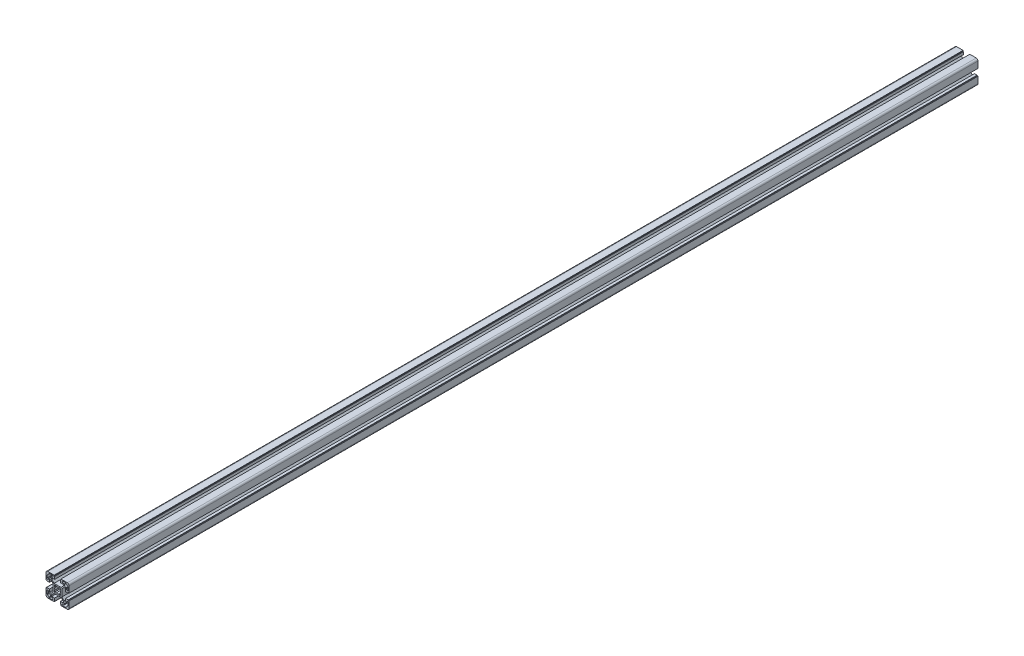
ISO-10303-21;
HEADER;
FILE_DESCRIPTION(('STEP AP214'),'2;1');
FILE_NAME('part.step','',(''),(''),'','','');
FILE_SCHEMA(('AUTOMOTIVE_DESIGN { 1 0 10303 214 1 1 1 1 }'));
ENDSEC;
DATA;
#1=APPLICATION_CONTEXT('core data for automotive mechanical design processes');
#2=APPLICATION_PROTOCOL_DEFINITION('international standard','automotive_design',2000,#1);
#3=PRODUCT_CONTEXT('',#1,'mechanical');
#4=PRODUCT('Part','Part','',(#3));
#5=PRODUCT_RELATED_PRODUCT_CATEGORY('part','',(#4));
#6=PRODUCT_DEFINITION_FORMATION('','',#4);
#7=PRODUCT_DEFINITION_CONTEXT('part definition',#1,'design');
#8=PRODUCT_DEFINITION('design','',#6,#7);
#9=PRODUCT_DEFINITION_SHAPE('','',#8);
#10=(LENGTH_UNIT() NAMED_UNIT(*) SI_UNIT(.MILLI.,.METRE.));
#11=(NAMED_UNIT(*) PLANE_ANGLE_UNIT() SI_UNIT($,.RADIAN.));
#12=(NAMED_UNIT(*) SI_UNIT($,.STERADIAN.) SOLID_ANGLE_UNIT());
#13=UNCERTAINTY_MEASURE_WITH_UNIT(LENGTH_MEASURE(1.E-05),#10,'distance_accuracy_value','');
#14=(GEOMETRIC_REPRESENTATION_CONTEXT(3) GLOBAL_UNCERTAINTY_ASSIGNED_CONTEXT((#13)) GLOBAL_UNIT_ASSIGNED_CONTEXT((#10,
#11,#12)) REPRESENTATION_CONTEXT('',''));
#15=CARTESIAN_POINT('',(0.,0.,0.));
#16=DIRECTION('',(0.,0.,1.));
#17=DIRECTION('',(1.,0.,0.));
#18=AXIS2_PLACEMENT_3D('',#15,#16,#17);
#19=CARTESIAN_POINT('',(-14.5000000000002,-11.75,1575.));
#20=DIRECTION('',(0.,-1.,0.));
#21=DIRECTION('',(1.,0.,0.));
#22=AXIS2_PLACEMENT_3D('',#19,#20,#21);
#23=PLANE('',#22);
#24=DIRECTION('',(1.,0.,0.));
#25=VECTOR('',#24,1.);
#26=CARTESIAN_POINT('',(-14.5000000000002,-11.75,1575.));
#27=LINE('',#26,#25);
#28=CARTESIAN_POINT('',(-14.5000000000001,-11.75,1575.));
#29=VERTEX_POINT('',#28);
#30=CARTESIAN_POINT('',(-15.5000000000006,-11.75,1575.));
#31=VERTEX_POINT('',#30);
#32=EDGE_CURVE('E806',#29,#31,#27,.F.);
#33=ORIENTED_EDGE('',*,*,#32,.T.);
#34=DIRECTION('',(0.,0.,1.));
#35=VECTOR('',#34,1.);
#36=CARTESIAN_POINT('',(-15.5000000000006,-11.75,1575.));
#37=LINE('',#36,#35);
#38=CARTESIAN_POINT('',(-15.5000000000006,-11.75,0.));
#39=VERTEX_POINT('',#38);
#40=EDGE_CURVE('E804',#39,#31,#37,.T.);
#41=ORIENTED_EDGE('',*,*,#40,.F.);
#42=DIRECTION('',(1.,0.,0.));
#43=VECTOR('',#42,1.);
#44=CARTESIAN_POINT('',(-14.5000000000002,-11.75,0.));
#45=LINE('',#44,#43);
#46=CARTESIAN_POINT('',(-14.5000000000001,-11.75,0.));
#47=VERTEX_POINT('',#46);
#48=EDGE_CURVE('E20',#39,#47,#45,.T.);
#49=ORIENTED_EDGE('',*,*,#48,.T.);
#50=DIRECTION('',(0.,0.,-1.));
#51=VECTOR('',#50,1.);
#52=CARTESIAN_POINT('',(-14.5000000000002,-11.75,1575.));
#53=LINE('',#52,#51);
#54=EDGE_CURVE('E801',#47,#29,#53,.F.);
#55=ORIENTED_EDGE('',*,*,#54,.T.);
#56=EDGE_LOOP('',(#33,#41,#49,#55));
#57=FACE_BOUND('',#56,.T.);
#58=ADVANCED_FACE('F17',(#57),#23,.T.);
#59=CARTESIAN_POINT('',(-11.7500000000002,-15.5,1575.));
#60=DIRECTION('',(-1.,0.,0.));
#61=DIRECTION('',(0.,-1.,0.));
#62=AXIS2_PLACEMENT_3D('',#59,#60,#61);
#63=PLANE('',#62);
#64=DIRECTION('',(0.,-1.,0.));
#65=VECTOR('',#64,1.);
#66=CARTESIAN_POINT('',(-11.7500000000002,-15.5,1575.));
#67=LINE('',#66,#65);
#68=CARTESIAN_POINT('',(-11.7500000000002,-15.5,1575.));
#69=VERTEX_POINT('',#68);
#70=CARTESIAN_POINT('',(-11.7500000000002,-14.5,1575.));
#71=VERTEX_POINT('',#70);
#72=EDGE_CURVE('E1218',#69,#71,#67,.F.);
#73=ORIENTED_EDGE('',*,*,#72,.T.);
#74=DIRECTION('',(0.,0.,-1.));
#75=VECTOR('',#74,1.);
#76=CARTESIAN_POINT('',(-11.7500000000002,-14.5,1575.));
#77=LINE('',#76,#75);
#78=CARTESIAN_POINT('',(-11.7500000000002,-14.5,0.));
#79=VERTEX_POINT('',#78);
#80=EDGE_CURVE('E814',#71,#79,#77,.T.);
#81=ORIENTED_EDGE('',*,*,#80,.T.);
#82=DIRECTION('',(0.,-1.,0.));
#83=VECTOR('',#82,1.);
#84=CARTESIAN_POINT('',(-11.7500000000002,-15.5,0.));
#85=LINE('',#84,#83);
#86=CARTESIAN_POINT('',(-11.7500000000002,-15.5,0.));
#87=VERTEX_POINT('',#86);
#88=EDGE_CURVE('E819',#79,#87,#85,.T.);
#89=ORIENTED_EDGE('',*,*,#88,.T.);
#90=DIRECTION('',(0.,0.,-1.));
#91=VECTOR('',#90,1.);
#92=CARTESIAN_POINT('',(-11.7500000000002,-15.5,1575.));
#93=LINE('',#92,#91);
#94=EDGE_CURVE('E1262',#69,#87,#93,.T.);
#95=ORIENTED_EDGE('',*,*,#94,.F.);
#96=EDGE_LOOP('',(#73,#81,#89,#95));
#97=FACE_BOUND('',#96,.T.);
#98=ADVANCED_FACE('F1555',(#97),#63,.T.);
#99=CARTESIAN_POINT('',(-14.5000000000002,-17.25,1575.));
#100=DIRECTION('',(1.,0.,0.));
#101=DIRECTION('',(0.,0.,-1.));
#102=AXIS2_PLACEMENT_3D('',#99,#100,#101);
#103=PLANE('',#102);
#104=DIRECTION('',(0.,1.,0.));
#105=VECTOR('',#104,1.);
#106=CARTESIAN_POINT('',(-14.5000000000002,-17.25,1575.));
#107=LINE('',#106,#105);
#108=CARTESIAN_POINT('',(-14.5000000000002,-17.25,1575.));
#109=VERTEX_POINT('',#108);
#110=CARTESIAN_POINT('',(-14.5000000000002,-18.5,1575.));
#111=VERTEX_POINT('',#110);
#112=EDGE_CURVE('E1214',#109,#111,#107,.F.);
#113=ORIENTED_EDGE('',*,*,#112,.T.);
#114=DIRECTION('',(0.,0.,1.));
#115=VECTOR('',#114,1.);
#116=CARTESIAN_POINT('',(-14.5000000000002,-18.5,1575.));
#117=LINE('',#116,#115);
#118=CARTESIAN_POINT('',(-14.5000000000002,-18.5,0.));
#119=VERTEX_POINT('',#118);
#120=EDGE_CURVE('E1256',#119,#111,#117,.T.);
#121=ORIENTED_EDGE('',*,*,#120,.F.);
#122=DIRECTION('',(0.,1.,0.));
#123=VECTOR('',#122,1.);
#124=CARTESIAN_POINT('',(-14.5000000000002,-17.25,0.));
#125=LINE('',#124,#123);
#126=CARTESIAN_POINT('',(-14.5000000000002,-17.25,0.));
#127=VERTEX_POINT('',#126);
#128=EDGE_CURVE('E1216',#119,#127,#125,.T.);
#129=ORIENTED_EDGE('',*,*,#128,.T.);
#130=DIRECTION('',(0.,0.,-1.));
#131=VECTOR('',#130,1.);
#132=CARTESIAN_POINT('',(-14.5000000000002,-17.25,1575.));
#133=LINE('',#132,#131);
#134=EDGE_CURVE('E1251',#127,#109,#133,.F.);
#135=ORIENTED_EDGE('',*,*,#134,.T.);
#136=EDGE_LOOP('',(#113,#121,#129,#135));
#137=FACE_BOUND('',#136,.T.);
#138=ADVANCED_FACE('F1560',(#137),#103,.T.);
#139=CARTESIAN_POINT('',(-18.5000000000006,-14.5000000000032,1575.));
#140=DIRECTION('',(0.,1.,0.));
#141=DIRECTION('',(0.,0.,1.));
#142=AXIS2_PLACEMENT_3D('',#139,#140,#141);
#143=PLANE('',#142);
#144=DIRECTION('',(1.,0.,0.));
#145=VECTOR('',#144,1.);
#146=CARTESIAN_POINT('',(-18.5000000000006,-14.5000000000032,1575.));
#147=LINE('',#146,#145);
#148=CARTESIAN_POINT('',(-18.5000000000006,-14.5000000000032,1575.));
#149=VERTEX_POINT('',#148);
#150=CARTESIAN_POINT('',(-17.2500000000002,-14.5000000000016,1575.));
#151=VERTEX_POINT('',#150);
#152=EDGE_CURVE('E1210',#149,#151,#147,.T.);
#153=ORIENTED_EDGE('',*,*,#152,.T.);
#154=DIRECTION('',(0.,0.,-1.));
#155=VECTOR('',#154,1.);
#156=CARTESIAN_POINT('',(-17.2500000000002,-14.5,1575.));
#157=LINE('',#156,#155);
#158=CARTESIAN_POINT('',(-17.2500000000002,-14.5000000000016,0.));
#159=VERTEX_POINT('',#158);
#160=EDGE_CURVE('E1248',#151,#159,#157,.T.);
#161=ORIENTED_EDGE('',*,*,#160,.T.);
#162=DIRECTION('',(1.,0.,0.));
#163=VECTOR('',#162,1.);
#164=CARTESIAN_POINT('',(-18.5000000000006,-14.5000000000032,0.));
#165=LINE('',#164,#163);
#166=CARTESIAN_POINT('',(-18.5000000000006,-14.5000000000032,0.));
#167=VERTEX_POINT('',#166);
#168=EDGE_CURVE('E1212',#159,#167,#165,.F.);
#169=ORIENTED_EDGE('',*,*,#168,.T.);
#170=DIRECTION('',(0.,0.,-1.));
#171=VECTOR('',#170,1.);
#172=CARTESIAN_POINT('',(-18.5000000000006,-14.5000000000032,1575.));
#173=LINE('',#172,#171);
#174=EDGE_CURVE('E1242',#149,#167,#173,.T.);
#175=ORIENTED_EDGE('',*,*,#174,.F.);
#176=EDGE_LOOP('',(#153,#161,#169,#175));
#177=FACE_BOUND('',#176,.T.);
#178=ADVANCED_FACE('F1569',(#177),#143,.T.);
#179=CARTESIAN_POINT('',(18.5000000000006,-14.5000000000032,1575.));
#180=DIRECTION('',(0.,1.,0.));
#181=DIRECTION('',(0.,0.,1.));
#182=AXIS2_PLACEMENT_3D('',#179,#180,#181);
#183=PLANE('',#182);
#184=DIRECTION('',(1.,0.,0.));
#185=VECTOR('',#184,1.);
#186=CARTESIAN_POINT('',(18.5000000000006,-14.5000000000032,1575.));
#187=LINE('',#186,#185);
#188=CARTESIAN_POINT('',(17.2500000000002,-14.5000000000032,1575.));
#189=VERTEX_POINT('',#188);
#190=CARTESIAN_POINT('',(18.5000000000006,-14.5000000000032,1575.));
#191=VERTEX_POINT('',#190);
#192=EDGE_CURVE('E1206',#189,#191,#187,.T.);
#193=ORIENTED_EDGE('',*,*,#192,.T.);
#194=DIRECTION('',(0.,0.,1.));
#195=VECTOR('',#194,1.);
#196=CARTESIAN_POINT('',(18.5000000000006,-14.5000000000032,1575.));
#197=LINE('',#196,#195);
#198=CARTESIAN_POINT('',(18.5000000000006,-14.5000000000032,0.));
#199=VERTEX_POINT('',#198);
#200=EDGE_CURVE('E1947',#199,#191,#197,.T.);
#201=ORIENTED_EDGE('',*,*,#200,.F.);
#202=DIRECTION('',(1.,0.,0.));
#203=VECTOR('',#202,1.);
#204=CARTESIAN_POINT('',(18.5000000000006,-14.5000000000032,0.));
#205=LINE('',#204,#203);
#206=CARTESIAN_POINT('',(17.2500000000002,-14.5000000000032,0.));
#207=VERTEX_POINT('',#206);
#208=EDGE_CURVE('E1208',#199,#207,#205,.F.);
#209=ORIENTED_EDGE('',*,*,#208,.T.);
#210=DIRECTION('',(0.,0.,-1.));
#211=VECTOR('',#210,1.);
#212=CARTESIAN_POINT('',(17.2500000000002,-14.5000000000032,1575.));
#213=LINE('',#212,#211);
#214=EDGE_CURVE('E1952',#207,#189,#213,.F.);
#215=ORIENTED_EDGE('',*,*,#214,.T.);
#216=EDGE_LOOP('',(#193,#201,#209,#215));
#217=FACE_BOUND('',#216,.T.);
#218=ADVANCED_FACE('F2472',(#217),#183,.T.);
#219=CARTESIAN_POINT('',(14.5000000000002,-17.25,1575.));
#220=DIRECTION('',(-1.,0.,0.));
#221=DIRECTION('',(0.,0.,1.));
#222=AXIS2_PLACEMENT_3D('',#219,#220,#221);
#223=PLANE('',#222);
#224=DIRECTION('',(0.,1.,0.));
#225=VECTOR('',#224,1.);
#226=CARTESIAN_POINT('',(14.5000000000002,-17.25,1575.));
#227=LINE('',#226,#225);
#228=CARTESIAN_POINT('',(14.5000000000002,-18.5,1575.));
#229=VERTEX_POINT('',#228);
#230=CARTESIAN_POINT('',(14.5000000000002,-17.25,1575.));
#231=VERTEX_POINT('',#230);
#232=EDGE_CURVE('E1202',#229,#231,#227,.T.);
#233=ORIENTED_EDGE('',*,*,#232,.T.);
#234=DIRECTION('',(0.,0.,-1.));
#235=VECTOR('',#234,1.);
#236=CARTESIAN_POINT('',(14.5000000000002,-17.25,1575.));
#237=LINE('',#236,#235);
#238=CARTESIAN_POINT('',(14.5000000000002,-17.25,0.));
#239=VERTEX_POINT('',#238);
#240=EDGE_CURVE('E1955',#231,#239,#237,.T.);
#241=ORIENTED_EDGE('',*,*,#240,.T.);
#242=DIRECTION('',(0.,1.,0.));
#243=VECTOR('',#242,1.);
#244=CARTESIAN_POINT('',(14.5000000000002,-17.25,0.));
#245=LINE('',#244,#243);
#246=CARTESIAN_POINT('',(14.5000000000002,-18.5,0.));
#247=VERTEX_POINT('',#246);
#248=EDGE_CURVE('E1204',#239,#247,#245,.F.);
#249=ORIENTED_EDGE('',*,*,#248,.T.);
#250=DIRECTION('',(0.,0.,1.));
#251=VECTOR('',#250,1.);
#252=CARTESIAN_POINT('',(14.5000000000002,-18.5,1575.));
#253=LINE('',#252,#251);
#254=EDGE_CURVE('E1958',#229,#247,#253,.F.);
#255=ORIENTED_EDGE('',*,*,#254,.F.);
#256=EDGE_LOOP('',(#233,#241,#249,#255));
#257=FACE_BOUND('',#256,.T.);
#258=ADVANCED_FACE('F2468',(#257),#223,.T.);
#259=CARTESIAN_POINT('',(11.7500000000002,-15.5,1575.));
#260=DIRECTION('',(1.,0.,0.));
#261=DIRECTION('',(0.,1.,0.));
#262=AXIS2_PLACEMENT_3D('',#259,#260,#261);
#263=PLANE('',#262);
#264=DIRECTION('',(0.,1.,0.));
#265=VECTOR('',#264,1.);
#266=CARTESIAN_POINT('',(11.7500000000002,-15.5,1575.));
#267=LINE('',#266,#265);
#268=CARTESIAN_POINT('',(11.7500000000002,-14.5,1575.));
#269=VERTEX_POINT('',#268);
#270=CARTESIAN_POINT('',(11.7500000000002,-15.5,1575.));
#271=VERTEX_POINT('',#270);
#272=EDGE_CURVE('E1198',#269,#271,#267,.F.);
#273=ORIENTED_EDGE('',*,*,#272,.T.);
#274=DIRECTION('',(0.,0.,-1.));
#275=VECTOR('',#274,1.);
#276=CARTESIAN_POINT('',(11.7500000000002,-15.5,1575.));
#277=LINE('',#276,#275);
#278=CARTESIAN_POINT('',(11.7500000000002,-15.5,0.));
#279=VERTEX_POINT('',#278);
#280=EDGE_CURVE('E1964',#279,#271,#277,.F.);
#281=ORIENTED_EDGE('',*,*,#280,.F.);
#282=DIRECTION('',(0.,1.,0.));
#283=VECTOR('',#282,1.);
#284=CARTESIAN_POINT('',(11.7500000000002,-15.5,0.));
#285=LINE('',#284,#283);
#286=CARTESIAN_POINT('',(11.7500000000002,-14.5,0.));
#287=VERTEX_POINT('',#286);
#288=EDGE_CURVE('E1200',#279,#287,#285,.T.);
#289=ORIENTED_EDGE('',*,*,#288,.T.);
#290=DIRECTION('',(0.,0.,-1.));
#291=VECTOR('',#290,1.);
#292=CARTESIAN_POINT('',(11.7500000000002,-14.5,1575.));
#293=LINE('',#292,#291);
#294=EDGE_CURVE('E1969',#287,#269,#293,.F.);
#295=ORIENTED_EDGE('',*,*,#294,.T.);
#296=EDGE_LOOP('',(#273,#281,#289,#295));
#297=FACE_BOUND('',#296,.T.);
#298=ADVANCED_FACE('F2465',(#297),#263,.T.);
#299=CARTESIAN_POINT('',(14.5000000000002,-11.75,1575.));
#300=DIRECTION('',(0.,-1.,0.));
#301=DIRECTION('',(1.,0.,0.));
#302=AXIS2_PLACEMENT_3D('',#299,#300,#301);
#303=PLANE('',#302);
#304=DIRECTION('',(1.,0.,0.));
#305=VECTOR('',#304,1.);
#306=CARTESIAN_POINT('',(14.5000000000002,-11.75,1575.));
#307=LINE('',#306,#305);
#308=CARTESIAN_POINT('',(15.5000000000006,-11.75,1575.));
#309=VERTEX_POINT('',#308);
#310=CARTESIAN_POINT('',(14.5000000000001,-11.75,1575.));
#311=VERTEX_POINT('',#310);
#312=EDGE_CURVE('E1194',#309,#311,#307,.F.);
#313=ORIENTED_EDGE('',*,*,#312,.T.);
#314=DIRECTION('',(0.,0.,-1.));
#315=VECTOR('',#314,1.);
#316=CARTESIAN_POINT('',(14.5000000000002,-11.75,1575.));
#317=LINE('',#316,#315);
#318=CARTESIAN_POINT('',(14.5000000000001,-11.75,0.));
#319=VERTEX_POINT('',#318);
#320=EDGE_CURVE('E1940',#311,#319,#317,.T.);
#321=ORIENTED_EDGE('',*,*,#320,.T.);
#322=DIRECTION('',(1.,0.,0.));
#323=VECTOR('',#322,1.);
#324=CARTESIAN_POINT('',(14.5000000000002,-11.75,0.));
#325=LINE('',#324,#323);
#326=CARTESIAN_POINT('',(15.5000000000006,-11.75,0.));
#327=VERTEX_POINT('',#326);
#328=EDGE_CURVE('E1196',#319,#327,#325,.T.);
#329=ORIENTED_EDGE('',*,*,#328,.T.);
#330=DIRECTION('',(0.,0.,-1.));
#331=VECTOR('',#330,1.);
#332=CARTESIAN_POINT('',(15.5000000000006,-11.75,1575.));
#333=LINE('',#332,#331);
#334=EDGE_CURVE('E1237',#309,#327,#333,.T.);
#335=ORIENTED_EDGE('',*,*,#334,.F.);
#336=EDGE_LOOP('',(#313,#321,#329,#335));
#337=FACE_BOUND('',#336,.T.);
#338=ADVANCED_FACE('F1939',(#337),#303,.T.);
#339=CARTESIAN_POINT('',(5.80000000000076,-18.5000000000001,1575.));
#340=DIRECTION('',(1.,0.,0.));
#341=DIRECTION('',(0.,0.,-1.));
#342=AXIS2_PLACEMENT_3D('',#339,#340,#341);
#343=PLANE('',#342);
#344=DIRECTION('',(0.,0.,1.));
#345=VECTOR('',#344,1.);
#346=CARTESIAN_POINT('',(5.80000000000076,-20.,1575.));
#347=LINE('',#346,#345);
#348=CARTESIAN_POINT('',(5.80000000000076,-20.,0.));
#349=VERTEX_POINT('',#348);
#350=CARTESIAN_POINT('',(5.80000000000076,-20.,1575.));
#351=VERTEX_POINT('',#350);
#352=EDGE_CURVE('E1973',#349,#351,#347,.T.);
#353=ORIENTED_EDGE('',*,*,#352,.T.);
#354=DIRECTION('',(0.,1.,0.));
#355=VECTOR('',#354,1.);
#356=CARTESIAN_POINT('',(5.80000000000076,-17.,1575.));
#357=LINE('',#356,#355);
#358=CARTESIAN_POINT('',(5.80000000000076,-18.5000000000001,1575.));
#359=VERTEX_POINT('',#358);
#360=EDGE_CURVE('E1192',#359,#351,#357,.F.);
#361=ORIENTED_EDGE('',*,*,#360,.F.);
#362=DIRECTION('',(0.,0.,1.));
#363=VECTOR('',#362,1.);
#364=CARTESIAN_POINT('',(5.80000000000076,-18.5000000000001,1575.));
#365=LINE('',#364,#363);
#366=CARTESIAN_POINT('',(5.80000000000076,-18.5000000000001,0.));
#367=VERTEX_POINT('',#366);
#368=EDGE_CURVE('E1116',#359,#367,#365,.F.);
#369=ORIENTED_EDGE('',*,*,#368,.T.);
#370=DIRECTION('',(0.,1.,0.));
#371=VECTOR('',#370,1.);
#372=CARTESIAN_POINT('',(5.80000000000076,-17.,0.));
#373=LINE('',#372,#371);
#374=EDGE_CURVE('E1190',#349,#367,#373,.T.);
#375=ORIENTED_EDGE('',*,*,#374,.F.);
#376=EDGE_LOOP('',(#353,#361,#369,#375));
#377=FACE_BOUND('',#376,.T.);
#378=ADVANCED_FACE('F2286',(#377),#343,.F.);
#379=CARTESIAN_POINT('',(20.,-5.79999999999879,1575.));
#380=DIRECTION('',(0.,-1.,0.));
#381=DIRECTION('',(0.,0.,-1.));
#382=AXIS2_PLACEMENT_3D('',#379,#380,#381);
#383=PLANE('',#382);
#384=DIRECTION('',(0.,0.,1.));
#385=VECTOR('',#384,1.);
#386=CARTESIAN_POINT('',(18.5,-5.79999999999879,1575.));
#387=LINE('',#386,#385);
#388=CARTESIAN_POINT('',(18.5,-5.79999999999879,0.));
#389=VERTEX_POINT('',#388);
#390=CARTESIAN_POINT('',(18.5,-5.79999999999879,1575.));
#391=VERTEX_POINT('',#390);
#392=EDGE_CURVE('E1185',#389,#391,#387,.T.);
#393=ORIENTED_EDGE('',*,*,#392,.T.);
#394=DIRECTION('',(1.,0.,0.));
#395=VECTOR('',#394,1.);
#396=CARTESIAN_POINT('',(17.,-5.79999999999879,1575.));
#397=LINE('',#396,#395);
#398=CARTESIAN_POINT('',(20.,-5.79999999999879,1575.));
#399=VERTEX_POINT('',#398);
#400=EDGE_CURVE('E1188',#399,#391,#397,.F.);
#401=ORIENTED_EDGE('',*,*,#400,.F.);
#402=DIRECTION('',(0.,0.,1.));
#403=VECTOR('',#402,1.);
#404=CARTESIAN_POINT('',(20.,-5.79999999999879,1575.));
#405=LINE('',#404,#403);
#406=CARTESIAN_POINT('',(20.,-5.79999999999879,0.));
#407=VERTEX_POINT('',#406);
#408=EDGE_CURVE('E1981',#399,#407,#405,.F.);
#409=ORIENTED_EDGE('',*,*,#408,.T.);
#410=DIRECTION('',(1.,0.,0.));
#411=VECTOR('',#410,1.);
#412=CARTESIAN_POINT('',(17.,-5.79999999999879,0.));
#413=LINE('',#412,#411);
#414=EDGE_CURVE('E1186',#389,#407,#413,.T.);
#415=ORIENTED_EDGE('',*,*,#414,.F.);
#416=EDGE_LOOP('',(#393,#401,#409,#415));
#417=FACE_BOUND('',#416,.T.);
#418=ADVANCED_FACE('F2294',(#417),#383,.F.);
#419=CARTESIAN_POINT('',(18.5,-5.79999999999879,1575.));
#420=DIRECTION('',(-1.,0.,0.));
#421=DIRECTION('',(0.,0.,1.));
#422=AXIS2_PLACEMENT_3D('',#419,#420,#421);
#423=PLANE('',#422);
#424=DIRECTION('',(0.,0.,-1.));
#425=VECTOR('',#424,1.);
#426=CARTESIAN_POINT('',(18.5,-4.99999999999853,1575.));
#427=LINE('',#426,#425);
#428=CARTESIAN_POINT('',(18.5,-4.99999999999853,0.));
#429=VERTEX_POINT('',#428);
#430=CARTESIAN_POINT('',(18.5,-4.99999999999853,1575.));
#431=VERTEX_POINT('',#430);
#432=EDGE_CURVE('E1984',#429,#431,#427,.F.);
#433=ORIENTED_EDGE('',*,*,#432,.T.);
#434=DIRECTION('',(0.,1.,0.));
#435=VECTOR('',#434,1.);
#436=CARTESIAN_POINT('',(18.5,-17.,1575.));
#437=LINE('',#436,#435);
#438=EDGE_CURVE('E1183',#391,#431,#437,.T.);
#439=ORIENTED_EDGE('',*,*,#438,.F.);
#440=ORIENTED_EDGE('',*,*,#392,.F.);
#441=DIRECTION('',(0.,1.,0.));
#442=VECTOR('',#441,1.);
#443=CARTESIAN_POINT('',(18.5,-17.,0.));
#444=LINE('',#443,#442);
#445=EDGE_CURVE('E1180',#429,#389,#444,.F.);
#446=ORIENTED_EDGE('',*,*,#445,.F.);
#447=EDGE_LOOP('',(#433,#439,#440,#446));
#448=FACE_BOUND('',#447,.T.);
#449=ADVANCED_FACE('F2297',(#448),#423,.F.);
#450=CARTESIAN_POINT('',(18.5,5.79999999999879,1575.));
#451=DIRECTION('',(-1.,0.,0.));
#452=DIRECTION('',(0.,0.,1.));
#453=AXIS2_PLACEMENT_3D('',#450,#451,#452);
#454=PLANE('',#453);
#455=DIRECTION('',(0.,0.,1.));
#456=VECTOR('',#455,1.);
#457=CARTESIAN_POINT('',(18.5,5.79999999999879,1575.));
#458=LINE('',#457,#456);
#459=CARTESIAN_POINT('',(18.5,5.79999999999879,0.));
#460=VERTEX_POINT('',#459);
#461=CARTESIAN_POINT('',(18.5,5.79999999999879,1575.));
#462=VERTEX_POINT('',#461);
#463=EDGE_CURVE('E1175',#460,#462,#458,.T.);
#464=ORIENTED_EDGE('',*,*,#463,.T.);
#465=DIRECTION('',(0.,1.,0.));
#466=VECTOR('',#465,1.);
#467=CARTESIAN_POINT('',(18.5,-17.,1575.));
#468=LINE('',#467,#466);
#469=CARTESIAN_POINT('',(18.5,4.99999999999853,1575.));
#470=VERTEX_POINT('',#469);
#471=EDGE_CURVE('E1178',#470,#462,#468,.T.);
#472=ORIENTED_EDGE('',*,*,#471,.F.);
#473=DIRECTION('',(0.,0.,1.));
#474=VECTOR('',#473,1.);
#475=CARTESIAN_POINT('',(18.5,4.99999999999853,1575.));
#476=LINE('',#475,#474);
#477=CARTESIAN_POINT('',(18.5,4.99999999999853,0.));
#478=VERTEX_POINT('',#477);
#479=EDGE_CURVE('E2011',#470,#478,#476,.F.);
#480=ORIENTED_EDGE('',*,*,#479,.T.);
#481=DIRECTION('',(0.,1.,0.));
#482=VECTOR('',#481,1.);
#483=CARTESIAN_POINT('',(18.5,-17.,0.));
#484=LINE('',#483,#482);
#485=EDGE_CURVE('E1176',#460,#478,#484,.F.);
#486=ORIENTED_EDGE('',*,*,#485,.F.);
#487=EDGE_LOOP('',(#464,#472,#480,#486));
#488=FACE_BOUND('',#487,.T.);
#489=ADVANCED_FACE('F2319',(#488),#454,.F.);
#490=CARTESIAN_POINT('',(20.,5.79999999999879,1575.));
#491=DIRECTION('',(0.,1.,0.));
#492=DIRECTION('',(0.,0.,1.));
#493=AXIS2_PLACEMENT_3D('',#490,#491,#492);
#494=PLANE('',#493);
#495=DIRECTION('',(0.,0.,1.));
#496=VECTOR('',#495,1.);
#497=CARTESIAN_POINT('',(20.,5.79999999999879,1575.));
#498=LINE('',#497,#496);
#499=CARTESIAN_POINT('',(20.,5.79999999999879,0.));
#500=VERTEX_POINT('',#499);
#501=CARTESIAN_POINT('',(20.,5.79999999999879,1575.));
#502=VERTEX_POINT('',#501);
#503=EDGE_CURVE('E2014',#500,#502,#498,.T.);
#504=ORIENTED_EDGE('',*,*,#503,.T.);
#505=DIRECTION('',(1.,0.,0.));
#506=VECTOR('',#505,1.);
#507=CARTESIAN_POINT('',(17.,5.79999999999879,1575.));
#508=LINE('',#507,#506);
#509=EDGE_CURVE('E1173',#462,#502,#508,.T.);
#510=ORIENTED_EDGE('',*,*,#509,.F.);
#511=ORIENTED_EDGE('',*,*,#463,.F.);
#512=DIRECTION('',(1.,0.,0.));
#513=VECTOR('',#512,1.);
#514=CARTESIAN_POINT('',(17.,5.79999999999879,0.));
#515=LINE('',#514,#513);
#516=EDGE_CURVE('E1170',#500,#460,#515,.F.);
#517=ORIENTED_EDGE('',*,*,#516,.F.);
#518=EDGE_LOOP('',(#504,#510,#511,#517));
#519=FACE_BOUND('',#518,.T.);
#520=ADVANCED_FACE('F2323',(#519),#494,.F.);
#521=CARTESIAN_POINT('',(5.80000000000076,18.5000000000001,1575.));
#522=DIRECTION('',(1.,0.,0.));
#523=DIRECTION('',(0.,0.,-1.));
#524=AXIS2_PLACEMENT_3D('',#521,#522,#523);
#525=PLANE('',#524);
#526=DIRECTION('',(0.,0.,-1.));
#527=VECTOR('',#526,1.);
#528=CARTESIAN_POINT('',(5.80000000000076,18.5000000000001,1575.));
#529=LINE('',#528,#527);
#530=CARTESIAN_POINT('',(5.80000000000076,18.5000000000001,0.));
#531=VERTEX_POINT('',#530);
#532=CARTESIAN_POINT('',(5.80000000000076,18.5000000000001,1575.));
#533=VERTEX_POINT('',#532);
#534=EDGE_CURVE('E1165',#531,#533,#529,.F.);
#535=ORIENTED_EDGE('',*,*,#534,.T.);
#536=DIRECTION('',(0.,1.,0.));
#537=VECTOR('',#536,1.);
#538=CARTESIAN_POINT('',(5.80000000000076,-17.,1575.));
#539=LINE('',#538,#537);
#540=CARTESIAN_POINT('',(5.80000000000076,20.,1575.));
#541=VERTEX_POINT('',#540);
#542=EDGE_CURVE('E1168',#541,#533,#539,.F.);
#543=ORIENTED_EDGE('',*,*,#542,.F.);
#544=DIRECTION('',(0.,0.,-1.));
#545=VECTOR('',#544,1.);
#546=CARTESIAN_POINT('',(5.80000000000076,20.,1575.));
#547=LINE('',#546,#545);
#548=CARTESIAN_POINT('',(5.80000000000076,20.,0.));
#549=VERTEX_POINT('',#548);
#550=EDGE_CURVE('E2022',#541,#549,#547,.T.);
#551=ORIENTED_EDGE('',*,*,#550,.T.);
#552=DIRECTION('',(0.,1.,0.));
#553=VECTOR('',#552,1.);
#554=CARTESIAN_POINT('',(5.80000000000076,-17.,0.));
#555=LINE('',#554,#553);
#556=EDGE_CURVE('E1166',#531,#549,#555,.T.);
#557=ORIENTED_EDGE('',*,*,#556,.F.);
#558=EDGE_LOOP('',(#535,#543,#551,#557));
#559=FACE_BOUND('',#558,.T.);
#560=ADVANCED_FACE('F2334',(#559),#525,.F.);
#561=CARTESIAN_POINT('',(5.00000000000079,18.5000000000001,1575.));
#562=DIRECTION('',(0.,-1.,0.));
#563=DIRECTION('',(0.,0.,-1.));
#564=AXIS2_PLACEMENT_3D('',#561,#562,#563);
#565=PLANE('',#564);
#566=DIRECTION('',(0.,0.,1.));
#567=VECTOR('',#566,1.);
#568=CARTESIAN_POINT('',(5.00000000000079,18.5000000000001,1575.));
#569=LINE('',#568,#567);
#570=CARTESIAN_POINT('',(5.00000000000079,18.5000000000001,0.));
#571=VERTEX_POINT('',#570);
#572=CARTESIAN_POINT('',(5.00000000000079,18.5000000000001,1575.));
#573=VERTEX_POINT('',#572);
#574=EDGE_CURVE('E2025',#571,#573,#569,.T.);
#575=ORIENTED_EDGE('',*,*,#574,.T.);
#576=DIRECTION('',(1.,0.,0.));
#577=VECTOR('',#576,1.);
#578=CARTESIAN_POINT('',(17.,18.5000000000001,1575.));
#579=LINE('',#578,#577);
#580=EDGE_CURVE('E1163',#533,#573,#579,.F.);
#581=ORIENTED_EDGE('',*,*,#580,.F.);
#582=ORIENTED_EDGE('',*,*,#534,.F.);
#583=DIRECTION('',(1.,0.,0.));
#584=VECTOR('',#583,1.);
#585=CARTESIAN_POINT('',(17.,18.5000000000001,0.));
#586=LINE('',#585,#584);
#587=EDGE_CURVE('E1160',#571,#531,#586,.T.);
#588=ORIENTED_EDGE('',*,*,#587,.F.);
#589=EDGE_LOOP('',(#575,#581,#582,#588));
#590=FACE_BOUND('',#589,.T.);
#591=ADVANCED_FACE('F2338',(#590),#565,.F.);
#592=CARTESIAN_POINT('',(-5.00000000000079,18.5000000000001,1575.));
#593=DIRECTION('',(0.,-1.,0.));
#594=DIRECTION('',(0.,0.,-1.));
#595=AXIS2_PLACEMENT_3D('',#592,#593,#594);
#596=PLANE('',#595);
#597=DIRECTION('',(0.,0.,1.));
#598=VECTOR('',#597,1.);
#599=CARTESIAN_POINT('',(-5.80000000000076,18.5000000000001,1575.));
#600=LINE('',#599,#598);
#601=CARTESIAN_POINT('',(-5.80000000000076,18.5000000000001,0.));
#602=VERTEX_POINT('',#601);
#603=CARTESIAN_POINT('',(-5.80000000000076,18.5000000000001,1575.));
#604=VERTEX_POINT('',#603);
#605=EDGE_CURVE('E1155',#602,#604,#600,.T.);
#606=ORIENTED_EDGE('',*,*,#605,.T.);
#607=DIRECTION('',(1.,0.,0.));
#608=VECTOR('',#607,1.);
#609=CARTESIAN_POINT('',(17.,18.5000000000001,1575.));
#610=LINE('',#609,#608);
#611=CARTESIAN_POINT('',(-5.00000000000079,18.5000000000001,1575.));
#612=VERTEX_POINT('',#611);
#613=EDGE_CURVE('E1158',#612,#604,#610,.F.);
#614=ORIENTED_EDGE('',*,*,#613,.F.);
#615=DIRECTION('',(0.,0.,1.));
#616=VECTOR('',#615,1.);
#617=CARTESIAN_POINT('',(-5.00000000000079,18.5000000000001,1575.));
#618=LINE('',#617,#616);
#619=CARTESIAN_POINT('',(-5.00000000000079,18.5000000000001,0.));
#620=VERTEX_POINT('',#619);
#621=EDGE_CURVE('E2052',#612,#620,#618,.F.);
#622=ORIENTED_EDGE('',*,*,#621,.T.);
#623=DIRECTION('',(1.,0.,0.));
#624=VECTOR('',#623,1.);
#625=CARTESIAN_POINT('',(17.,18.5000000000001,0.));
#626=LINE('',#625,#624);
#627=EDGE_CURVE('E1156',#602,#620,#626,.T.);
#628=ORIENTED_EDGE('',*,*,#627,.F.);
#629=EDGE_LOOP('',(#606,#614,#622,#628));
#630=FACE_BOUND('',#629,.T.);
#631=ADVANCED_FACE('F2360',(#630),#596,.F.);
#632=CARTESIAN_POINT('',(-5.80000000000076,18.5000000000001,1575.));
#633=DIRECTION('',(-1.,0.,0.));
#634=DIRECTION('',(0.,0.,1.));
#635=AXIS2_PLACEMENT_3D('',#632,#633,#634);
#636=PLANE('',#635);
#637=DIRECTION('',(0.,0.,1.));
#638=VECTOR('',#637,1.);
#639=CARTESIAN_POINT('',(-5.80000000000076,20.,1575.));
#640=LINE('',#639,#638);
#641=CARTESIAN_POINT('',(-5.80000000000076,20.,0.));
#642=VERTEX_POINT('',#641);
#643=CARTESIAN_POINT('',(-5.80000000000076,20.,1575.));
#644=VERTEX_POINT('',#643);
#645=EDGE_CURVE('E2055',#642,#644,#640,.T.);
#646=ORIENTED_EDGE('',*,*,#645,.T.);
#647=DIRECTION('',(0.,1.,0.));
#648=VECTOR('',#647,1.);
#649=CARTESIAN_POINT('',(-5.80000000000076,-17.,1575.));
#650=LINE('',#649,#648);
#651=EDGE_CURVE('E1153',#604,#644,#650,.T.);
#652=ORIENTED_EDGE('',*,*,#651,.F.);
#653=ORIENTED_EDGE('',*,*,#605,.F.);
#654=DIRECTION('',(0.,1.,0.));
#655=VECTOR('',#654,1.);
#656=CARTESIAN_POINT('',(-5.80000000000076,-17.,0.));
#657=LINE('',#656,#655);
#658=EDGE_CURVE('E1150',#642,#602,#657,.F.);
#659=ORIENTED_EDGE('',*,*,#658,.F.);
#660=EDGE_LOOP('',(#646,#652,#653,#659));
#661=FACE_BOUND('',#660,.T.);
#662=ADVANCED_FACE('F2364',(#661),#636,.F.);
#663=CARTESIAN_POINT('',(-20.,5.79999999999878,1575.));
#664=DIRECTION('',(0.,1.,0.));
#665=DIRECTION('',(0.,0.,1.));
#666=AXIS2_PLACEMENT_3D('',#663,#664,#665);
#667=PLANE('',#666);
#668=DIRECTION('',(0.,0.,-1.));
#669=VECTOR('',#668,1.);
#670=CARTESIAN_POINT('',(-18.5,5.79999999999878,1575.));
#671=LINE('',#670,#669);
#672=CARTESIAN_POINT('',(-18.5,5.79999999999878,0.));
#673=VERTEX_POINT('',#672);
#674=CARTESIAN_POINT('',(-18.5,5.79999999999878,1575.));
#675=VERTEX_POINT('',#674);
#676=EDGE_CURVE('E1145',#673,#675,#671,.F.);
#677=ORIENTED_EDGE('',*,*,#676,.T.);
#678=DIRECTION('',(1.,0.,0.));
#679=VECTOR('',#678,1.);
#680=CARTESIAN_POINT('',(17.,5.79999999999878,1575.));
#681=LINE('',#680,#679);
#682=CARTESIAN_POINT('',(-20.,5.79999999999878,1575.));
#683=VERTEX_POINT('',#682);
#684=EDGE_CURVE('E1148',#683,#675,#681,.T.);
#685=ORIENTED_EDGE('',*,*,#684,.F.);
#686=DIRECTION('',(0.,0.,1.));
#687=VECTOR('',#686,1.);
#688=CARTESIAN_POINT('',(-20.,5.79999999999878,1575.));
#689=LINE('',#688,#687);
#690=CARTESIAN_POINT('',(-20.,5.79999999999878,0.));
#691=VERTEX_POINT('',#690);
#692=EDGE_CURVE('E2063',#683,#691,#689,.F.);
#693=ORIENTED_EDGE('',*,*,#692,.T.);
#694=DIRECTION('',(1.,0.,0.));
#695=VECTOR('',#694,1.);
#696=CARTESIAN_POINT('',(17.,5.79999999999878,0.));
#697=LINE('',#696,#695);
#698=EDGE_CURVE('E1146',#673,#691,#697,.F.);
#699=ORIENTED_EDGE('',*,*,#698,.F.);
#700=EDGE_LOOP('',(#677,#685,#693,#699));
#701=FACE_BOUND('',#700,.T.);
#702=ADVANCED_FACE('F2375',(#701),#667,.F.);
#703=CARTESIAN_POINT('',(-18.5,5.79999999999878,1575.));
#704=DIRECTION('',(1.,0.,0.));
#705=DIRECTION('',(0.,0.,-1.));
#706=AXIS2_PLACEMENT_3D('',#703,#704,#705);
#707=PLANE('',#706);
#708=DIRECTION('',(0.,0.,1.));
#709=VECTOR('',#708,1.);
#710=CARTESIAN_POINT('',(-18.5,4.99999999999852,1575.));
#711=LINE('',#710,#709);
#712=CARTESIAN_POINT('',(-18.5,4.99999999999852,0.));
#713=VERTEX_POINT('',#712);
#714=CARTESIAN_POINT('',(-18.5,4.99999999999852,1575.));
#715=VERTEX_POINT('',#714);
#716=EDGE_CURVE('E2066',#713,#715,#711,.T.);
#717=ORIENTED_EDGE('',*,*,#716,.T.);
#718=DIRECTION('',(0.,1.,0.));
#719=VECTOR('',#718,1.);
#720=CARTESIAN_POINT('',(-18.5,-17.,1575.));
#721=LINE('',#720,#719);
#722=EDGE_CURVE('E1143',#675,#715,#721,.F.);
#723=ORIENTED_EDGE('',*,*,#722,.F.);
#724=ORIENTED_EDGE('',*,*,#676,.F.);
#725=DIRECTION('',(0.,1.,0.));
#726=VECTOR('',#725,1.);
#727=CARTESIAN_POINT('',(-18.5,-17.,0.));
#728=LINE('',#727,#726);
#729=EDGE_CURVE('E1140',#713,#673,#728,.T.);
#730=ORIENTED_EDGE('',*,*,#729,.F.);
#731=EDGE_LOOP('',(#717,#723,#724,#730));
#732=FACE_BOUND('',#731,.T.);
#733=ADVANCED_FACE('F2379',(#732),#707,.F.);
#734=CARTESIAN_POINT('',(-18.5,-5.79999999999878,1575.));
#735=DIRECTION('',(1.,0.,0.));
#736=DIRECTION('',(0.,0.,-1.));
#737=AXIS2_PLACEMENT_3D('',#734,#735,#736);
#738=PLANE('',#737);
#739=DIRECTION('',(0.,0.,-1.));
#740=VECTOR('',#739,1.);
#741=CARTESIAN_POINT('',(-18.5,-5.79999999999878,1575.));
#742=LINE('',#741,#740);
#743=CARTESIAN_POINT('',(-18.5,-5.79999999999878,0.));
#744=VERTEX_POINT('',#743);
#745=CARTESIAN_POINT('',(-18.5,-5.79999999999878,1575.));
#746=VERTEX_POINT('',#745);
#747=EDGE_CURVE('E1135',#744,#746,#742,.F.);
#748=ORIENTED_EDGE('',*,*,#747,.T.);
#749=DIRECTION('',(0.,1.,0.));
#750=VECTOR('',#749,1.);
#751=CARTESIAN_POINT('',(-18.5,-17.,1575.));
#752=LINE('',#751,#750);
#753=CARTESIAN_POINT('',(-18.5,-4.99999999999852,1575.));
#754=VERTEX_POINT('',#753);
#755=EDGE_CURVE('E1138',#754,#746,#752,.F.);
#756=ORIENTED_EDGE('',*,*,#755,.F.);
#757=DIRECTION('',(0.,0.,1.));
#758=VECTOR('',#757,1.);
#759=CARTESIAN_POINT('',(-18.5,-4.99999999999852,1575.));
#760=LINE('',#759,#758);
#761=CARTESIAN_POINT('',(-18.5,-4.99999999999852,0.));
#762=VERTEX_POINT('',#761);
#763=EDGE_CURVE('E2093',#754,#762,#760,.F.);
#764=ORIENTED_EDGE('',*,*,#763,.T.);
#765=DIRECTION('',(0.,1.,0.));
#766=VECTOR('',#765,1.);
#767=CARTESIAN_POINT('',(-18.5,-17.,0.));
#768=LINE('',#767,#766);
#769=EDGE_CURVE('E1136',#744,#762,#768,.T.);
#770=ORIENTED_EDGE('',*,*,#769,.F.);
#771=EDGE_LOOP('',(#748,#756,#764,#770));
#772=FACE_BOUND('',#771,.T.);
#773=ADVANCED_FACE('F2401',(#772),#738,.F.);
#774=CARTESIAN_POINT('',(-20.,-5.79999999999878,1575.));
#775=DIRECTION('',(0.,-1.,0.));
#776=DIRECTION('',(0.,0.,-1.));
#777=AXIS2_PLACEMENT_3D('',#774,#775,#776);
#778=PLANE('',#777);
#779=DIRECTION('',(0.,0.,1.));
#780=VECTOR('',#779,1.);
#781=CARTESIAN_POINT('',(-20.,-5.79999999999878,1575.));
#782=LINE('',#781,#780);
#783=CARTESIAN_POINT('',(-20.,-5.79999999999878,0.));
#784=VERTEX_POINT('',#783);
#785=CARTESIAN_POINT('',(-20.,-5.79999999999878,1575.));
#786=VERTEX_POINT('',#785);
#787=EDGE_CURVE('E2096',#784,#786,#782,.T.);
#788=ORIENTED_EDGE('',*,*,#787,.T.);
#789=DIRECTION('',(1.,0.,0.));
#790=VECTOR('',#789,1.);
#791=CARTESIAN_POINT('',(17.,-5.79999999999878,1575.));
#792=LINE('',#791,#790);
#793=EDGE_CURVE('E1133',#746,#786,#792,.F.);
#794=ORIENTED_EDGE('',*,*,#793,.F.);
#795=ORIENTED_EDGE('',*,*,#747,.F.);
#796=DIRECTION('',(1.,0.,0.));
#797=VECTOR('',#796,1.);
#798=CARTESIAN_POINT('',(17.,-5.79999999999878,0.));
#799=LINE('',#798,#797);
#800=EDGE_CURVE('E1130',#784,#744,#799,.T.);
#801=ORIENTED_EDGE('',*,*,#800,.F.);
#802=EDGE_LOOP('',(#788,#794,#795,#801));
#803=FACE_BOUND('',#802,.T.);
#804=ADVANCED_FACE('F2405',(#803),#778,.F.);
#805=CARTESIAN_POINT('',(-5.80000000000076,-18.5000000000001,1575.));
#806=DIRECTION('',(-1.,0.,0.));
#807=DIRECTION('',(0.,0.,1.));
#808=AXIS2_PLACEMENT_3D('',#805,#806,#807);
#809=PLANE('',#808);
#810=DIRECTION('',(0.,0.,1.));
#811=VECTOR('',#810,1.);
#812=CARTESIAN_POINT('',(-5.80000000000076,-18.5000000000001,1575.));
#813=LINE('',#812,#811);
#814=CARTESIAN_POINT('',(-5.80000000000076,-18.5000000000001,0.));
#815=VERTEX_POINT('',#814);
#816=CARTESIAN_POINT('',(-5.80000000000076,-18.5000000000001,1575.));
#817=VERTEX_POINT('',#816);
#818=EDGE_CURVE('E1125',#815,#817,#813,.T.);
#819=ORIENTED_EDGE('',*,*,#818,.T.);
#820=DIRECTION('',(0.,1.,0.));
#821=VECTOR('',#820,1.);
#822=CARTESIAN_POINT('',(-5.80000000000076,-17.,1575.));
#823=LINE('',#822,#821);
#824=CARTESIAN_POINT('',(-5.80000000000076,-20.,1575.));
#825=VERTEX_POINT('',#824);
#826=EDGE_CURVE('E1128',#825,#817,#823,.T.);
#827=ORIENTED_EDGE('',*,*,#826,.F.);
#828=DIRECTION('',(0.,0.,1.));
#829=VECTOR('',#828,1.);
#830=CARTESIAN_POINT('',(-5.80000000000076,-20.,1575.));
#831=LINE('',#830,#829);
#832=CARTESIAN_POINT('',(-5.80000000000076,-20.,0.));
#833=VERTEX_POINT('',#832);
#834=EDGE_CURVE('E2104',#825,#833,#831,.F.);
#835=ORIENTED_EDGE('',*,*,#834,.T.);
#836=DIRECTION('',(0.,1.,0.));
#837=VECTOR('',#836,1.);
#838=CARTESIAN_POINT('',(-5.80000000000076,-17.,0.));
#839=LINE('',#838,#837);
#840=EDGE_CURVE('E1126',#815,#833,#839,.F.);
#841=ORIENTED_EDGE('',*,*,#840,.F.);
#842=EDGE_LOOP('',(#819,#827,#835,#841));
#843=FACE_BOUND('',#842,.T.);
#844=ADVANCED_FACE('F2416',(#843),#809,.F.);
#845=CARTESIAN_POINT('',(-5.00000000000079,-18.5000000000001,1575.));
#846=DIRECTION('',(0.,1.,0.));
#847=DIRECTION('',(0.,0.,1.));
#848=AXIS2_PLACEMENT_3D('',#845,#846,#847);
#849=PLANE('',#848);
#850=DIRECTION('',(0.,0.,1.));
#851=VECTOR('',#850,1.);
#852=CARTESIAN_POINT('',(-5.00000000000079,-18.5000000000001,1575.));
#853=LINE('',#852,#851);
#854=CARTESIAN_POINT('',(-5.00000000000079,-18.5000000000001,0.));
#855=VERTEX_POINT('',#854);
#856=CARTESIAN_POINT('',(-5.00000000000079,-18.5000000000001,1575.));
#857=VERTEX_POINT('',#856);
#858=EDGE_CURVE('E2107',#855,#857,#853,.T.);
#859=ORIENTED_EDGE('',*,*,#858,.T.);
#860=DIRECTION('',(1.,0.,0.));
#861=VECTOR('',#860,1.);
#862=CARTESIAN_POINT('',(17.,-18.5000000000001,1575.));
#863=LINE('',#862,#861);
#864=EDGE_CURVE('E1123',#817,#857,#863,.T.);
#865=ORIENTED_EDGE('',*,*,#864,.F.);
#866=ORIENTED_EDGE('',*,*,#818,.F.);
#867=DIRECTION('',(1.,0.,0.));
#868=VECTOR('',#867,1.);
#869=CARTESIAN_POINT('',(17.,-18.5000000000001,0.));
#870=LINE('',#869,#868);
#871=EDGE_CURVE('E1120',#855,#815,#870,.F.);
#872=ORIENTED_EDGE('',*,*,#871,.F.);
#873=EDGE_LOOP('',(#859,#865,#866,#872));
#874=FACE_BOUND('',#873,.T.);
#875=ADVANCED_FACE('F2420',(#874),#849,.F.);
#876=CARTESIAN_POINT('',(5.00000000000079,-18.5000000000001,1575.));
#877=DIRECTION('',(0.,1.,0.));
#878=DIRECTION('',(0.,0.,1.));
#879=AXIS2_PLACEMENT_3D('',#876,#877,#878);
#880=PLANE('',#879);
#881=ORIENTED_EDGE('',*,*,#368,.F.);
#882=DIRECTION('',(1.,0.,0.));
#883=VECTOR('',#882,1.);
#884=CARTESIAN_POINT('',(17.,-18.5000000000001,1575.));
#885=LINE('',#884,#883);
#886=CARTESIAN_POINT('',(5.00000000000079,-18.5000000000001,1575.));
#887=VERTEX_POINT('',#886);
#888=EDGE_CURVE('E1117',#887,#359,#885,.T.);
#889=ORIENTED_EDGE('',*,*,#888,.F.);
#890=DIRECTION('',(0.,0.,1.));
#891=VECTOR('',#890,1.);
#892=CARTESIAN_POINT('',(5.00000000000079,-18.5000000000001,1575.));
#893=LINE('',#892,#891);
#894=CARTESIAN_POINT('',(5.00000000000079,-18.5000000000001,0.));
#895=VERTEX_POINT('',#894);
#896=EDGE_CURVE('E2126',#887,#895,#893,.F.);
#897=ORIENTED_EDGE('',*,*,#896,.T.);
#898=DIRECTION('',(1.,0.,0.));
#899=VECTOR('',#898,1.);
#900=CARTESIAN_POINT('',(17.,-18.5000000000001,0.));
#901=LINE('',#900,#899);
#902=EDGE_CURVE('E1114',#367,#895,#901,.F.);
#903=ORIENTED_EDGE('',*,*,#902,.F.);
#904=EDGE_LOOP('',(#881,#889,#897,#903));
#905=FACE_BOUND('',#904,.T.);
#906=ADVANCED_FACE('F2277',(#905),#880,.F.);
#907=CARTESIAN_POINT('',(14.5000000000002,11.75,1575.));
#908=DIRECTION('',(0.,1.,0.));
#909=DIRECTION('',(-1.,0.,0.));
#910=AXIS2_PLACEMENT_3D('',#907,#908,#909);
#911=PLANE('',#910);
#912=DIRECTION('',(-1.,0.,0.));
#913=VECTOR('',#912,1.);
#914=CARTESIAN_POINT('',(14.5000000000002,11.75,1575.));
#915=LINE('',#914,#913);
#916=CARTESIAN_POINT('',(14.5000000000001,11.75,1575.));
#917=VERTEX_POINT('',#916);
#918=CARTESIAN_POINT('',(15.5000000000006,11.75,1575.));
#919=VERTEX_POINT('',#918);
#920=EDGE_CURVE('E1110',#917,#919,#915,.F.);
#921=ORIENTED_EDGE('',*,*,#920,.T.);
#922=DIRECTION('',(0.,0.,-1.));
#923=VECTOR('',#922,1.);
#924=CARTESIAN_POINT('',(15.5000000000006,11.75,1575.));
#925=LINE('',#924,#923);
#926=CARTESIAN_POINT('',(15.5000000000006,11.75,0.));
#927=VERTEX_POINT('',#926);
#928=EDGE_CURVE('E2129',#927,#919,#925,.F.);
#929=ORIENTED_EDGE('',*,*,#928,.F.);
#930=DIRECTION('',(-1.,0.,0.));
#931=VECTOR('',#930,1.);
#932=CARTESIAN_POINT('',(14.5000000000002,11.75,0.));
#933=LINE('',#932,#931);
#934=CARTESIAN_POINT('',(14.5000000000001,11.75,0.));
#935=VERTEX_POINT('',#934);
#936=EDGE_CURVE('E1112',#927,#935,#933,.T.);
#937=ORIENTED_EDGE('',*,*,#936,.T.);
#938=DIRECTION('',(0.,0.,-1.));
#939=VECTOR('',#938,1.);
#940=CARTESIAN_POINT('',(14.5000000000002,11.75,1575.));
#941=LINE('',#940,#939);
#942=EDGE_CURVE('E2132',#935,#917,#941,.F.);
#943=ORIENTED_EDGE('',*,*,#942,.T.);
#944=EDGE_LOOP('',(#921,#929,#937,#943));
#945=FACE_BOUND('',#944,.T.);
#946=ADVANCED_FACE('F2432',(#945),#911,.T.);
#947=CARTESIAN_POINT('',(11.7500000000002,15.5,1575.));
#948=DIRECTION('',(1.,0.,0.));
#949=DIRECTION('',(0.,1.,0.));
#950=AXIS2_PLACEMENT_3D('',#947,#948,#949);
#951=PLANE('',#950);
#952=DIRECTION('',(0.,1.,0.));
#953=VECTOR('',#952,1.);
#954=CARTESIAN_POINT('',(11.7500000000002,15.5,1575.));
#955=LINE('',#954,#953);
#956=CARTESIAN_POINT('',(11.7500000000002,15.5,1575.));
#957=VERTEX_POINT('',#956);
#958=CARTESIAN_POINT('',(11.7500000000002,14.5,1575.));
#959=VERTEX_POINT('',#958);
#960=EDGE_CURVE('E1106',#957,#959,#955,.F.);
#961=ORIENTED_EDGE('',*,*,#960,.T.);
#962=DIRECTION('',(0.,0.,-1.));
#963=VECTOR('',#962,1.);
#964=CARTESIAN_POINT('',(11.7500000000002,14.5,1575.));
#965=LINE('',#964,#963);
#966=CARTESIAN_POINT('',(11.7500000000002,14.5,0.));
#967=VERTEX_POINT('',#966);
#968=EDGE_CURVE('E2135',#959,#967,#965,.T.);
#969=ORIENTED_EDGE('',*,*,#968,.T.);
#970=DIRECTION('',(0.,1.,0.));
#971=VECTOR('',#970,1.);
#972=CARTESIAN_POINT('',(11.7500000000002,15.5,0.));
#973=LINE('',#972,#971);
#974=CARTESIAN_POINT('',(11.7500000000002,15.5,0.));
#975=VERTEX_POINT('',#974);
#976=EDGE_CURVE('E1108',#967,#975,#973,.T.);
#977=ORIENTED_EDGE('',*,*,#976,.T.);
#978=DIRECTION('',(0.,0.,1.));
#979=VECTOR('',#978,1.);
#980=CARTESIAN_POINT('',(11.7500000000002,15.5,1575.));
#981=LINE('',#980,#979);
#982=EDGE_CURVE('E2138',#957,#975,#981,.F.);
#983=ORIENTED_EDGE('',*,*,#982,.F.);
#984=EDGE_LOOP('',(#961,#969,#977,#983));
#985=FACE_BOUND('',#984,.T.);
#986=ADVANCED_FACE('F2634',(#985),#951,.T.);
#987=CARTESIAN_POINT('',(14.5000000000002,17.25,1575.));
#988=DIRECTION('',(-1.,0.,0.));
#989=DIRECTION('',(0.,0.,1.));
#990=AXIS2_PLACEMENT_3D('',#987,#988,#989);
#991=PLANE('',#990);
#992=DIRECTION('',(0.,1.,0.));
#993=VECTOR('',#992,1.);
#994=CARTESIAN_POINT('',(14.5000000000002,17.25,1575.));
#995=LINE('',#994,#993);
#996=CARTESIAN_POINT('',(14.5000000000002,17.25,1575.));
#997=VERTEX_POINT('',#996);
#998=CARTESIAN_POINT('',(14.5000000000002,18.5,1575.));
#999=VERTEX_POINT('',#998);
#1000=EDGE_CURVE('E1102',#997,#999,#995,.T.);
#1001=ORIENTED_EDGE('',*,*,#1000,.T.);
#1002=DIRECTION('',(0.,0.,-1.));
#1003=VECTOR('',#1002,1.);
#1004=CARTESIAN_POINT('',(14.5000000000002,18.5,1575.));
#1005=LINE('',#1004,#1003);
#1006=CARTESIAN_POINT('',(14.5000000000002,18.5,0.));
#1007=VERTEX_POINT('',#1006);
#1008=EDGE_CURVE('E2144',#1007,#999,#1005,.F.);
#1009=ORIENTED_EDGE('',*,*,#1008,.F.);
#1010=DIRECTION('',(0.,1.,0.));
#1011=VECTOR('',#1010,1.);
#1012=CARTESIAN_POINT('',(14.5000000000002,17.25,0.));
#1013=LINE('',#1012,#1011);
#1014=CARTESIAN_POINT('',(14.5000000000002,17.25,0.));
#1015=VERTEX_POINT('',#1014);
#1016=EDGE_CURVE('E1104',#1007,#1015,#1013,.F.);
#1017=ORIENTED_EDGE('',*,*,#1016,.T.);
#1018=DIRECTION('',(0.,0.,-1.));
#1019=VECTOR('',#1018,1.);
#1020=CARTESIAN_POINT('',(14.5000000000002,17.25,1575.));
#1021=LINE('',#1020,#1019);
#1022=EDGE_CURVE('E2150',#1015,#997,#1021,.F.);
#1023=ORIENTED_EDGE('',*,*,#1022,.T.);
#1024=EDGE_LOOP('',(#1001,#1009,#1017,#1023));
#1025=FACE_BOUND('',#1024,.T.);
#1026=ADVANCED_FACE('F2643',(#1025),#991,.T.);
#1027=CARTESIAN_POINT('',(18.5000000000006,14.5000000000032,1575.));
#1028=DIRECTION('',(0.,-1.,0.));
#1029=DIRECTION('',(0.,0.,-1.));
#1030=AXIS2_PLACEMENT_3D('',#1027,#1028,#1029);
#1031=PLANE('',#1030);
#1032=DIRECTION('',(1.,0.,0.));
#1033=VECTOR('',#1032,1.);
#1034=CARTESIAN_POINT('',(18.5000000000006,14.5000000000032,1575.));
#1035=LINE('',#1034,#1033);
#1036=CARTESIAN_POINT('',(18.5000000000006,14.5000000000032,1575.));
#1037=VERTEX_POINT('',#1036);
#1038=CARTESIAN_POINT('',(17.2500000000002,14.5000000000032,1575.));
#1039=VERTEX_POINT('',#1038);
#1040=EDGE_CURVE('E1098',#1037,#1039,#1035,.F.);
#1041=ORIENTED_EDGE('',*,*,#1040,.T.);
#1042=DIRECTION('',(0.,0.,-1.));
#1043=VECTOR('',#1042,1.);
#1044=CARTESIAN_POINT('',(17.2500000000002,14.5000000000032,1575.));
#1045=LINE('',#1044,#1043);
#1046=CARTESIAN_POINT('',(17.2500000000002,14.5000000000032,0.));
#1047=VERTEX_POINT('',#1046);
#1048=EDGE_CURVE('E2153',#1039,#1047,#1045,.T.);
#1049=ORIENTED_EDGE('',*,*,#1048,.T.);
#1050=DIRECTION('',(1.,0.,0.));
#1051=VECTOR('',#1050,1.);
#1052=CARTESIAN_POINT('',(18.5000000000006,14.5000000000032,0.));
#1053=LINE('',#1052,#1051);
#1054=CARTESIAN_POINT('',(18.5000000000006,14.5000000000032,0.));
#1055=VERTEX_POINT('',#1054);
#1056=EDGE_CURVE('E1100',#1047,#1055,#1053,.T.);
#1057=ORIENTED_EDGE('',*,*,#1056,.T.);
#1058=DIRECTION('',(0.,0.,1.));
#1059=VECTOR('',#1058,1.);
#1060=CARTESIAN_POINT('',(18.5000000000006,14.5000000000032,1575.));
#1061=LINE('',#1060,#1059);
#1062=EDGE_CURVE('E2156',#1037,#1055,#1061,.F.);
#1063=ORIENTED_EDGE('',*,*,#1062,.F.);
#1064=EDGE_LOOP('',(#1041,#1049,#1057,#1063));
#1065=FACE_BOUND('',#1064,.T.);
#1066=ADVANCED_FACE('F2653',(#1065),#1031,.T.);
#1067=CARTESIAN_POINT('',(4.58333333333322,1.99826313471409,1575.));
#1068=DIRECTION('',(-0.399652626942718,0.91666666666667,0.));
#1069=DIRECTION('',(-0.91666666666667,-0.399652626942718,0.));
#1070=AXIS2_PLACEMENT_3D('',#1067,#1068,#1069);
#1071=PLANE('',#1070);
#1072=DIRECTION('',(-0.91666666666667,-0.399652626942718,0.));
#1073=VECTOR('',#1072,1.);
#1074=CARTESIAN_POINT('',(4.58333333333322,1.99826313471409,1575.));
#1075=LINE('',#1074,#1073);
#1076=CARTESIAN_POINT('',(4.58333333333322,1.99826313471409,1575.));
#1077=VERTEX_POINT('',#1076);
#1078=CARTESIAN_POINT('',(5.49999999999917,2.39791576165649,1575.));
#1079=VERTEX_POINT('',#1078);
#1080=EDGE_CURVE('E1094',#1077,#1079,#1075,.F.);
#1081=ORIENTED_EDGE('',*,*,#1080,.T.);
#1082=DIRECTION('',(0.,0.,1.));
#1083=VECTOR('',#1082,1.);
#1084=CARTESIAN_POINT('',(5.49999999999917,2.39791576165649,1575.));
#1085=LINE('',#1084,#1083);
#1086=CARTESIAN_POINT('',(5.49999999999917,2.39791576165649,-8.88178419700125E-13));
#1087=VERTEX_POINT('',#1086);
#1088=EDGE_CURVE('E2168',#1087,#1079,#1085,.T.);
#1089=ORIENTED_EDGE('',*,*,#1088,.F.);
#1090=DIRECTION('',(-0.91666666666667,-0.399652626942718,0.));
#1091=VECTOR('',#1090,1.);
#1092=CARTESIAN_POINT('',(4.58333333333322,1.99826313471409,-1.77635683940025E-12));
#1093=LINE('',#1092,#1091);
#1094=CARTESIAN_POINT('',(4.58333333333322,1.99826313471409,-8.88178419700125E-13));
#1095=VERTEX_POINT('',#1094);
#1096=EDGE_CURVE('E1096',#1087,#1095,#1093,.T.);
#1097=ORIENTED_EDGE('',*,*,#1096,.T.);
#1098=DIRECTION('',(0.,0.,-1.));
#1099=VECTOR('',#1098,1.);
#1100=CARTESIAN_POINT('',(4.58333333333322,1.99826313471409,1575.));
#1101=LINE('',#1100,#1099);
#1102=EDGE_CURVE('E2174',#1095,#1077,#1101,.F.);
#1103=ORIENTED_EDGE('',*,*,#1102,.T.);
#1104=EDGE_LOOP('',(#1081,#1089,#1097,#1103));
#1105=FACE_BOUND('',#1104,.T.);
#1106=ADVANCED_FACE('F2663',(#1105),#1071,.T.);
#1107=CARTESIAN_POINT('',(4.58333333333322,-1.99826313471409,1575.));
#1108=DIRECTION('',(-0.399652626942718,-0.91666666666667,0.));
#1109=DIRECTION('',(0.91666666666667,-0.399652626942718,0.));
#1110=AXIS2_PLACEMENT_3D('',#1107,#1108,#1109);
#1111=PLANE('',#1110);
#1112=DIRECTION('',(0.91666666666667,-0.399652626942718,0.));
#1113=VECTOR('',#1112,1.);
#1114=CARTESIAN_POINT('',(4.58333333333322,-1.99826313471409,1575.));
#1115=LINE('',#1114,#1113);
#1116=CARTESIAN_POINT('',(5.49999999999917,-2.39791576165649,1575.));
#1117=VERTEX_POINT('',#1116);
#1118=CARTESIAN_POINT('',(4.58333333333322,-1.99826313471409,1575.));
#1119=VERTEX_POINT('',#1118);
#1120=EDGE_CURVE('E1090',#1117,#1119,#1115,.F.);
#1121=ORIENTED_EDGE('',*,*,#1120,.T.);
#1122=DIRECTION('',(0.,0.,-1.));
#1123=VECTOR('',#1122,1.);
#1124=CARTESIAN_POINT('',(4.58333333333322,-1.99826313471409,1575.));
#1125=LINE('',#1124,#1123);
#1126=CARTESIAN_POINT('',(4.58333333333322,-1.99826313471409,-8.88178419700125E-13));
#1127=VERTEX_POINT('',#1126);
#1128=EDGE_CURVE('E2177',#1119,#1127,#1125,.T.);
#1129=ORIENTED_EDGE('',*,*,#1128,.T.);
#1130=DIRECTION('',(0.91666666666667,-0.399652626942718,0.));
#1131=VECTOR('',#1130,1.);
#1132=CARTESIAN_POINT('',(4.58333333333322,-1.99826313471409,-1.77635683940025E-12));
#1133=LINE('',#1132,#1131);
#1134=CARTESIAN_POINT('',(5.49999999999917,-2.39791576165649,-8.88178419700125E-13));
#1135=VERTEX_POINT('',#1134);
#1136=EDGE_CURVE('E1092',#1127,#1135,#1133,.T.);
#1137=ORIENTED_EDGE('',*,*,#1136,.T.);
#1138=DIRECTION('',(0.,0.,1.));
#1139=VECTOR('',#1138,1.);
#1140=CARTESIAN_POINT('',(5.49999999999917,-2.39791576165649,1575.));
#1141=LINE('',#1140,#1139);
#1142=EDGE_CURVE('E2180',#1117,#1135,#1141,.F.);
#1143=ORIENTED_EDGE('',*,*,#1142,.F.);
#1144=EDGE_LOOP('',(#1121,#1129,#1137,#1143));
#1145=FACE_BOUND('',#1144,.T.);
#1146=ADVANCED_FACE('F2673',(#1145),#1111,.T.);
#1147=CARTESIAN_POINT('',(2.39791576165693,-5.49999999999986,1575.));
#1148=DIRECTION('',(0.916666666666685,0.399652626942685,0.));
#1149=DIRECTION('',(-0.399652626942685,0.916666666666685,0.));
#1150=AXIS2_PLACEMENT_3D('',#1147,#1148,#1149);
#1151=PLANE('',#1150);
#1152=DIRECTION('',(-0.399652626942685,0.916666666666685,0.));
#1153=VECTOR('',#1152,1.);
#1154=CARTESIAN_POINT('',(2.39791576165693,-5.49999999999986,1575.));
#1155=LINE('',#1154,#1153);
#1156=CARTESIAN_POINT('',(1.99826313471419,-4.58333333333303,1575.));
#1157=VERTEX_POINT('',#1156);
#1158=CARTESIAN_POINT('',(2.39791576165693,-5.49999999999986,1575.));
#1159=VERTEX_POINT('',#1158);
#1160=EDGE_CURVE('E1086',#1157,#1159,#1155,.F.);
#1161=ORIENTED_EDGE('',*,*,#1160,.T.);
#1162=DIRECTION('',(0.,0.,1.));
#1163=VECTOR('',#1162,1.);
#1164=CARTESIAN_POINT('',(2.39791576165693,-5.49999999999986,1575.));
#1165=LINE('',#1164,#1163);
#1166=CARTESIAN_POINT('',(2.39791576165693,-5.49999999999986,-8.88178419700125E-13));
#1167=VERTEX_POINT('',#1166);
#1168=EDGE_CURVE('E2183',#1167,#1159,#1165,.T.);
#1169=ORIENTED_EDGE('',*,*,#1168,.F.);
#1170=DIRECTION('',(-0.399652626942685,0.916666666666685,0.));
#1171=VECTOR('',#1170,1.);
#1172=CARTESIAN_POINT('',(2.39791576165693,-5.49999999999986,-1.77635683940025E-12));
#1173=LINE('',#1172,#1171);
#1174=CARTESIAN_POINT('',(1.99826313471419,-4.58333333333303,-8.88178419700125E-13));
#1175=VERTEX_POINT('',#1174);
#1176=EDGE_CURVE('E1088',#1167,#1175,#1173,.T.);
#1177=ORIENTED_EDGE('',*,*,#1176,.T.);
#1178=DIRECTION('',(0.,0.,-1.));
#1179=VECTOR('',#1178,1.);
#1180=CARTESIAN_POINT('',(1.99826313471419,-4.58333333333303,1575.));
#1181=LINE('',#1180,#1179);
#1182=EDGE_CURVE('E2189',#1175,#1157,#1181,.F.);
#1183=ORIENTED_EDGE('',*,*,#1182,.T.);
#1184=EDGE_LOOP('',(#1161,#1169,#1177,#1183));
#1185=FACE_BOUND('',#1184,.T.);
#1186=ADVANCED_FACE('F2683',(#1185),#1151,.T.);
#1187=CARTESIAN_POINT('',(-2.39791576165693,-5.49999999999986,1575.));
#1188=DIRECTION('',(-0.916666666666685,0.399652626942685,0.));
#1189=DIRECTION('',(-0.399652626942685,-0.916666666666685,0.));
#1190=AXIS2_PLACEMENT_3D('',#1187,#1188,#1189);
#1191=PLANE('',#1190);
#1192=DIRECTION('',(-0.399652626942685,-0.916666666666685,0.));
#1193=VECTOR('',#1192,1.);
#1194=CARTESIAN_POINT('',(-2.39791576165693,-5.49999999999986,1575.));
#1195=LINE('',#1194,#1193);
#1196=CARTESIAN_POINT('',(-2.39791576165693,-5.49999999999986,1575.));
#1197=VERTEX_POINT('',#1196);
#1198=CARTESIAN_POINT('',(-1.99826313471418,-4.58333333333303,1575.));
#1199=VERTEX_POINT('',#1198);
#1200=EDGE_CURVE('E1082',#1197,#1199,#1195,.F.);
#1201=ORIENTED_EDGE('',*,*,#1200,.T.);
#1202=DIRECTION('',(0.,0.,-1.));
#1203=VECTOR('',#1202,1.);
#1204=CARTESIAN_POINT('',(-1.99826313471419,-4.58333333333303,1575.));
#1205=LINE('',#1204,#1203);
#1206=CARTESIAN_POINT('',(-1.99826313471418,-4.58333333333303,-8.88178419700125E-13));
#1207=VERTEX_POINT('',#1206);
#1208=EDGE_CURVE('E2192',#1199,#1207,#1205,.T.);
#1209=ORIENTED_EDGE('',*,*,#1208,.T.);
#1210=DIRECTION('',(-0.399652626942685,-0.916666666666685,0.));
#1211=VECTOR('',#1210,1.);
#1212=CARTESIAN_POINT('',(-2.39791576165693,-5.49999999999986,-1.77635683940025E-12));
#1213=LINE('',#1212,#1211);
#1214=CARTESIAN_POINT('',(-2.39791576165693,-5.49999999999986,-8.88178419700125E-13));
#1215=VERTEX_POINT('',#1214);
#1216=EDGE_CURVE('E1084',#1207,#1215,#1213,.T.);
#1217=ORIENTED_EDGE('',*,*,#1216,.T.);
#1218=DIRECTION('',(0.,0.,1.));
#1219=VECTOR('',#1218,1.);
#1220=CARTESIAN_POINT('',(-2.39791576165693,-5.49999999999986,1575.));
#1221=LINE('',#1220,#1219);
#1222=EDGE_CURVE('E2195',#1197,#1215,#1221,.F.);
#1223=ORIENTED_EDGE('',*,*,#1222,.F.);
#1224=EDGE_LOOP('',(#1201,#1209,#1217,#1223));
#1225=FACE_BOUND('',#1224,.T.);
#1226=ADVANCED_FACE('F2693',(#1225),#1191,.T.);
#1227=CARTESIAN_POINT('',(-4.58333333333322,-1.99826313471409,1575.));
#1228=DIRECTION('',(0.399652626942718,-0.91666666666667,0.));
#1229=DIRECTION('',(0.91666666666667,0.399652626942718,0.));
#1230=AXIS2_PLACEMENT_3D('',#1227,#1228,#1229);
#1231=PLANE('',#1230);
#1232=DIRECTION('',(0.91666666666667,0.399652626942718,0.));
#1233=VECTOR('',#1232,1.);
#1234=CARTESIAN_POINT('',(-4.58333333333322,-1.99826313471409,1575.));
#1235=LINE('',#1234,#1233);
#1236=CARTESIAN_POINT('',(-4.58333333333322,-1.99826313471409,1575.));
#1237=VERTEX_POINT('',#1236);
#1238=CARTESIAN_POINT('',(-5.49999999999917,-2.39791576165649,1575.));
#1239=VERTEX_POINT('',#1238);
#1240=EDGE_CURVE('E1077',#1237,#1239,#1235,.F.);
#1241=ORIENTED_EDGE('',*,*,#1240,.T.);
#1242=DIRECTION('',(0.,0.,1.));
#1243=VECTOR('',#1242,1.);
#1244=CARTESIAN_POINT('',(-5.49999999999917,-2.39791576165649,1575.));
#1245=LINE('',#1244,#1243);
#1246=CARTESIAN_POINT('',(-5.49999999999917,-2.39791576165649,-8.88178419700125E-13));
#1247=VERTEX_POINT('',#1246);
#1248=EDGE_CURVE('E2198',#1247,#1239,#1245,.T.);
#1249=ORIENTED_EDGE('',*,*,#1248,.F.);
#1250=DIRECTION('',(0.91666666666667,0.399652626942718,0.));
#1251=VECTOR('',#1250,1.);
#1252=CARTESIAN_POINT('',(-4.58333333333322,-1.99826313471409,-1.77635683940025E-12));
#1253=LINE('',#1252,#1251);
#1254=CARTESIAN_POINT('',(-4.58333333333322,-1.99826313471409,-8.88178419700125E-13));
#1255=VERTEX_POINT('',#1254);
#1256=EDGE_CURVE('E1079',#1247,#1255,#1253,.T.);
#1257=ORIENTED_EDGE('',*,*,#1256,.T.);
#1258=DIRECTION('',(0.,0.,-1.));
#1259=VECTOR('',#1258,1.);
#1260=CARTESIAN_POINT('',(-4.58333333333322,-1.99826313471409,1575.));
#1261=LINE('',#1260,#1259);
#1262=EDGE_CURVE('E2204',#1255,#1237,#1261,.F.);
#1263=ORIENTED_EDGE('',*,*,#1262,.T.);
#1264=EDGE_LOOP('',(#1241,#1249,#1257,#1263));
#1265=FACE_BOUND('',#1264,.T.);
#1266=ADVANCED_FACE('F2703',(#1265),#1231,.T.);
#1267=CARTESIAN_POINT('',(-4.58333333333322,1.99826313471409,1575.));
#1268=DIRECTION('',(0.399652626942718,0.91666666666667,0.));
#1269=DIRECTION('',(-0.91666666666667,0.399652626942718,0.));
#1270=AXIS2_PLACEMENT_3D('',#1267,#1268,#1269);
#1271=PLANE('',#1270);
#1272=DIRECTION('',(-0.91666666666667,0.399652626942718,0.));
#1273=VECTOR('',#1272,1.);
#1274=CARTESIAN_POINT('',(-4.58333333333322,1.99826313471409,1575.));
#1275=LINE('',#1274,#1273);
#1276=CARTESIAN_POINT('',(-5.49999999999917,2.39791576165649,1575.));
#1277=VERTEX_POINT('',#1276);
#1278=CARTESIAN_POINT('',(-4.58333333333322,1.99826313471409,1575.));
#1279=VERTEX_POINT('',#1278);
#1280=EDGE_CURVE('E1073',#1277,#1279,#1275,.F.);
#1281=ORIENTED_EDGE('',*,*,#1280,.T.);
#1282=DIRECTION('',(0.,0.,-1.));
#1283=VECTOR('',#1282,1.);
#1284=CARTESIAN_POINT('',(-4.58333333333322,1.99826313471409,1575.));
#1285=LINE('',#1284,#1283);
#1286=CARTESIAN_POINT('',(-4.58333333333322,1.99826313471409,-8.88178419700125E-13));
#1287=VERTEX_POINT('',#1286);
#1288=EDGE_CURVE('E2207',#1279,#1287,#1285,.T.);
#1289=ORIENTED_EDGE('',*,*,#1288,.T.);
#1290=DIRECTION('',(-0.91666666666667,0.399652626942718,0.));
#1291=VECTOR('',#1290,1.);
#1292=CARTESIAN_POINT('',(-4.58333333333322,1.99826313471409,-1.77635683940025E-12));
#1293=LINE('',#1292,#1291);
#1294=CARTESIAN_POINT('',(-5.49999999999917,2.39791576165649,-8.88178419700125E-13));
#1295=VERTEX_POINT('',#1294);
#1296=EDGE_CURVE('E1075',#1287,#1295,#1293,.T.);
#1297=ORIENTED_EDGE('',*,*,#1296,.T.);
#1298=DIRECTION('',(0.,0.,1.));
#1299=VECTOR('',#1298,1.);
#1300=CARTESIAN_POINT('',(-5.49999999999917,2.39791576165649,1575.));
#1301=LINE('',#1300,#1299);
#1302=EDGE_CURVE('E2210',#1277,#1295,#1301,.F.);
#1303=ORIENTED_EDGE('',*,*,#1302,.F.);
#1304=EDGE_LOOP('',(#1281,#1289,#1297,#1303));
#1305=FACE_BOUND('',#1304,.T.);
#1306=ADVANCED_FACE('F2713',(#1305),#1271,.T.);
#1307=CARTESIAN_POINT('',(-2.39791576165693,5.49999999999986,1575.));
#1308=DIRECTION('',(-0.916666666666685,-0.399652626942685,0.));
#1309=DIRECTION('',(0.399652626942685,-0.916666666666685,0.));
#1310=AXIS2_PLACEMENT_3D('',#1307,#1308,#1309);
#1311=PLANE('',#1310);
#1312=DIRECTION('',(0.399652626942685,-0.916666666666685,0.));
#1313=VECTOR('',#1312,1.);
#1314=CARTESIAN_POINT('',(-2.39791576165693,5.49999999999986,1575.));
#1315=LINE('',#1314,#1313);
#1316=CARTESIAN_POINT('',(-1.99826313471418,4.58333333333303,1575.));
#1317=VERTEX_POINT('',#1316);
#1318=CARTESIAN_POINT('',(-2.39791576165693,5.49999999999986,1575.));
#1319=VERTEX_POINT('',#1318);
#1320=EDGE_CURVE('E1069',#1317,#1319,#1315,.F.);
#1321=ORIENTED_EDGE('',*,*,#1320,.T.);
#1322=DIRECTION('',(0.,0.,-1.));
#1323=VECTOR('',#1322,1.);
#1324=CARTESIAN_POINT('',(-2.39791576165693,5.49999999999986,1575.));
#1325=LINE('',#1324,#1323);
#1326=CARTESIAN_POINT('',(-2.39791576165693,5.49999999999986,-8.88178419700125E-13));
#1327=VERTEX_POINT('',#1326);
#1328=EDGE_CURVE('E2213',#1327,#1319,#1325,.F.);
#1329=ORIENTED_EDGE('',*,*,#1328,.F.);
#1330=DIRECTION('',(0.399652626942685,-0.916666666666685,0.));
#1331=VECTOR('',#1330,1.);
#1332=CARTESIAN_POINT('',(-2.39791576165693,5.49999999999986,-1.77635683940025E-12));
#1333=LINE('',#1332,#1331);
#1334=CARTESIAN_POINT('',(-1.99826313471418,4.58333333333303,-8.88178419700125E-13));
#1335=VERTEX_POINT('',#1334);
#1336=EDGE_CURVE('E1071',#1327,#1335,#1333,.T.);
#1337=ORIENTED_EDGE('',*,*,#1336,.T.);
#1338=DIRECTION('',(0.,0.,-1.));
#1339=VECTOR('',#1338,1.);
#1340=CARTESIAN_POINT('',(-1.99826313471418,4.58333333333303,1575.));
#1341=LINE('',#1340,#1339);
#1342=EDGE_CURVE('E2219',#1335,#1317,#1341,.F.);
#1343=ORIENTED_EDGE('',*,*,#1342,.T.);
#1344=EDGE_LOOP('',(#1321,#1329,#1337,#1343));
#1345=FACE_BOUND('',#1344,.T.);
#1346=ADVANCED_FACE('F2723',(#1345),#1311,.T.);
#1347=CARTESIAN_POINT('',(2.39791576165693,5.49999999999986,1575.));
#1348=DIRECTION('',(0.916666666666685,-0.399652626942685,0.));
#1349=DIRECTION('',(0.399652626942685,0.916666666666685,0.));
#1350=AXIS2_PLACEMENT_3D('',#1347,#1348,#1349);
#1351=PLANE('',#1350);
#1352=DIRECTION('',(0.399652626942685,0.916666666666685,0.));
#1353=VECTOR('',#1352,1.);
#1354=CARTESIAN_POINT('',(2.39791576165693,5.49999999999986,1575.));
#1355=LINE('',#1354,#1353);
#1356=CARTESIAN_POINT('',(2.39791576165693,5.49999999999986,1575.));
#1357=VERTEX_POINT('',#1356);
#1358=CARTESIAN_POINT('',(1.99826313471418,4.58333333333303,1575.));
#1359=VERTEX_POINT('',#1358);
#1360=EDGE_CURVE('E1065',#1357,#1359,#1355,.F.);
#1361=ORIENTED_EDGE('',*,*,#1360,.T.);
#1362=DIRECTION('',(0.,0.,-1.));
#1363=VECTOR('',#1362,1.);
#1364=CARTESIAN_POINT('',(1.99826313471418,4.58333333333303,1575.));
#1365=LINE('',#1364,#1363);
#1366=CARTESIAN_POINT('',(1.99826313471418,4.58333333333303,-8.88178419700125E-13));
#1367=VERTEX_POINT('',#1366);
#1368=EDGE_CURVE('E2222',#1359,#1367,#1365,.T.);
#1369=ORIENTED_EDGE('',*,*,#1368,.T.);
#1370=DIRECTION('',(0.399652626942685,0.916666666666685,0.));
#1371=VECTOR('',#1370,1.);
#1372=CARTESIAN_POINT('',(2.39791576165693,5.49999999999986,-1.77635683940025E-12));
#1373=LINE('',#1372,#1371);
#1374=CARTESIAN_POINT('',(2.39791576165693,5.49999999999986,-8.88178419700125E-13));
#1375=VERTEX_POINT('',#1374);
#1376=EDGE_CURVE('E1067',#1367,#1375,#1373,.T.);
#1377=ORIENTED_EDGE('',*,*,#1376,.T.);
#1378=DIRECTION('',(0.,0.,-1.));
#1379=VECTOR('',#1378,1.);
#1380=CARTESIAN_POINT('',(2.39791576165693,5.49999999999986,1575.));
#1381=LINE('',#1380,#1379);
#1382=EDGE_CURVE('E2165',#1357,#1375,#1381,.T.);
#1383=ORIENTED_EDGE('',*,*,#1382,.F.);
#1384=EDGE_LOOP('',(#1361,#1369,#1377,#1383));
#1385=FACE_BOUND('',#1384,.T.);
#1386=ADVANCED_FACE('F2733',(#1385),#1351,.T.);
#1387=CARTESIAN_POINT('',(-18.5000000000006,14.5000000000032,1575.));
#1388=DIRECTION('',(0.,-1.,0.));
#1389=DIRECTION('',(0.,0.,-1.));
#1390=AXIS2_PLACEMENT_3D('',#1387,#1388,#1389);
#1391=PLANE('',#1390);
#1392=DIRECTION('',(1.,0.,0.));
#1393=VECTOR('',#1392,1.);
#1394=CARTESIAN_POINT('',(-18.5000000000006,14.5000000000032,1575.));
#1395=LINE('',#1394,#1393);
#1396=CARTESIAN_POINT('',(-17.2500000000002,14.5000000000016,1575.));
#1397=VERTEX_POINT('',#1396);
#1398=CARTESIAN_POINT('',(-18.5000000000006,14.5000000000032,1575.));
#1399=VERTEX_POINT('',#1398);
#1400=EDGE_CURVE('E1061',#1397,#1399,#1395,.F.);
#1401=ORIENTED_EDGE('',*,*,#1400,.T.);
#1402=DIRECTION('',(0.,0.,-1.));
#1403=VECTOR('',#1402,1.);
#1404=CARTESIAN_POINT('',(-18.5000000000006,14.5000000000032,1575.));
#1405=LINE('',#1404,#1403);
#1406=CARTESIAN_POINT('',(-18.5000000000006,14.5000000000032,0.));
#1407=VERTEX_POINT('',#1406);
#1408=EDGE_CURVE('E2231',#1407,#1399,#1405,.F.);
#1409=ORIENTED_EDGE('',*,*,#1408,.F.);
#1410=DIRECTION('',(1.,0.,0.));
#1411=VECTOR('',#1410,1.);
#1412=CARTESIAN_POINT('',(-18.5000000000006,14.5000000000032,0.));
#1413=LINE('',#1412,#1411);
#1414=CARTESIAN_POINT('',(-17.2500000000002,14.5000000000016,0.));
#1415=VERTEX_POINT('',#1414);
#1416=EDGE_CURVE('E1063',#1407,#1415,#1413,.T.);
#1417=ORIENTED_EDGE('',*,*,#1416,.T.);
#1418=DIRECTION('',(0.,0.,-1.));
#1419=VECTOR('',#1418,1.);
#1420=CARTESIAN_POINT('',(-17.2500000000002,14.5,1575.));
#1421=LINE('',#1420,#1419);
#1422=EDGE_CURVE('E2237',#1415,#1397,#1421,.F.);
#1423=ORIENTED_EDGE('',*,*,#1422,.T.);
#1424=EDGE_LOOP('',(#1401,#1409,#1417,#1423));
#1425=FACE_BOUND('',#1424,.T.);
#1426=ADVANCED_FACE('F2743',(#1425),#1391,.T.);
#1427=CARTESIAN_POINT('',(-14.5000000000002,17.25,1575.));
#1428=DIRECTION('',(1.,0.,0.));
#1429=DIRECTION('',(0.,0.,-1.));
#1430=AXIS2_PLACEMENT_3D('',#1427,#1428,#1429);
#1431=PLANE('',#1430);
#1432=DIRECTION('',(0.,1.,0.));
#1433=VECTOR('',#1432,1.);
#1434=CARTESIAN_POINT('',(-14.5000000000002,17.25,1575.));
#1435=LINE('',#1434,#1433);
#1436=CARTESIAN_POINT('',(-14.5000000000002,18.5,1575.));
#1437=VERTEX_POINT('',#1436);
#1438=CARTESIAN_POINT('',(-14.5000000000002,17.25,1575.));
#1439=VERTEX_POINT('',#1438);
#1440=EDGE_CURVE('E1057',#1437,#1439,#1435,.F.);
#1441=ORIENTED_EDGE('',*,*,#1440,.T.);
#1442=DIRECTION('',(0.,0.,-1.));
#1443=VECTOR('',#1442,1.);
#1444=CARTESIAN_POINT('',(-14.5000000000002,17.25,1575.));
#1445=LINE('',#1444,#1443);
#1446=CARTESIAN_POINT('',(-14.5000000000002,17.25,0.));
#1447=VERTEX_POINT('',#1446);
#1448=EDGE_CURVE('E2240',#1439,#1447,#1445,.T.);
#1449=ORIENTED_EDGE('',*,*,#1448,.T.);
#1450=DIRECTION('',(0.,1.,0.));
#1451=VECTOR('',#1450,1.);
#1452=CARTESIAN_POINT('',(-14.5000000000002,17.25,0.));
#1453=LINE('',#1452,#1451);
#1454=CARTESIAN_POINT('',(-14.5000000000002,18.5,0.));
#1455=VERTEX_POINT('',#1454);
#1456=EDGE_CURVE('E1059',#1447,#1455,#1453,.T.);
#1457=ORIENTED_EDGE('',*,*,#1456,.T.);
#1458=DIRECTION('',(0.,0.,-1.));
#1459=VECTOR('',#1458,1.);
#1460=CARTESIAN_POINT('',(-14.5000000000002,18.5,1575.));
#1461=LINE('',#1460,#1459);
#1462=EDGE_CURVE('E2243',#1437,#1455,#1461,.T.);
#1463=ORIENTED_EDGE('',*,*,#1462,.F.);
#1464=EDGE_LOOP('',(#1441,#1449,#1457,#1463));
#1465=FACE_BOUND('',#1464,.T.);
#1466=ADVANCED_FACE('F2753',(#1465),#1431,.T.);
#1467=CARTESIAN_POINT('',(-11.7500000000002,15.5,1575.));
#1468=DIRECTION('',(-1.,0.,0.));
#1469=DIRECTION('',(0.,-1.,0.));
#1470=AXIS2_PLACEMENT_3D('',#1467,#1468,#1469);
#1471=PLANE('',#1470);
#1472=DIRECTION('',(0.,-1.,0.));
#1473=VECTOR('',#1472,1.);
#1474=CARTESIAN_POINT('',(-11.7500000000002,15.5,1575.));
#1475=LINE('',#1474,#1473);
#1476=CARTESIAN_POINT('',(-11.7500000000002,14.5,1575.));
#1477=VERTEX_POINT('',#1476);
#1478=CARTESIAN_POINT('',(-11.7500000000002,15.5,1575.));
#1479=VERTEX_POINT('',#1478);
#1480=EDGE_CURVE('E1053',#1477,#1479,#1475,.F.);
#1481=ORIENTED_EDGE('',*,*,#1480,.T.);
#1482=DIRECTION('',(0.,0.,1.));
#1483=VECTOR('',#1482,1.);
#1484=CARTESIAN_POINT('',(-11.7500000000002,15.5,1575.));
#1485=LINE('',#1484,#1483);
#1486=CARTESIAN_POINT('',(-11.7500000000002,15.5,0.));
#1487=VERTEX_POINT('',#1486);
#1488=EDGE_CURVE('E2249',#1487,#1479,#1485,.T.);
#1489=ORIENTED_EDGE('',*,*,#1488,.F.);
#1490=DIRECTION('',(0.,-1.,0.));
#1491=VECTOR('',#1490,1.);
#1492=CARTESIAN_POINT('',(-11.7500000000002,15.5,0.));
#1493=LINE('',#1492,#1491);
#1494=CARTESIAN_POINT('',(-11.7500000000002,14.5,0.));
#1495=VERTEX_POINT('',#1494);
#1496=EDGE_CURVE('E1055',#1487,#1495,#1493,.T.);
#1497=ORIENTED_EDGE('',*,*,#1496,.T.);
#1498=DIRECTION('',(0.,0.,-1.));
#1499=VECTOR('',#1498,1.);
#1500=CARTESIAN_POINT('',(-11.7500000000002,14.5,1575.));
#1501=LINE('',#1500,#1499);
#1502=EDGE_CURVE('E2255',#1495,#1477,#1501,.F.);
#1503=ORIENTED_EDGE('',*,*,#1502,.T.);
#1504=EDGE_LOOP('',(#1481,#1489,#1497,#1503));
#1505=FACE_BOUND('',#1504,.T.);
#1506=ADVANCED_FACE('F2763',(#1505),#1471,.T.);
#1507=CARTESIAN_POINT('',(-14.5000000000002,11.75,1575.));
#1508=DIRECTION('',(0.,1.,0.));
#1509=DIRECTION('',(-1.,0.,0.));
#1510=AXIS2_PLACEMENT_3D('',#1507,#1508,#1509);
#1511=PLANE('',#1510);
#1512=DIRECTION('',(-1.,0.,0.));
#1513=VECTOR('',#1512,1.);
#1514=CARTESIAN_POINT('',(-14.5000000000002,11.75,1575.));
#1515=LINE('',#1514,#1513);
#1516=CARTESIAN_POINT('',(-15.5000000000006,11.75,1575.));
#1517=VERTEX_POINT('',#1516);
#1518=CARTESIAN_POINT('',(-14.5000000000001,11.75,1575.));
#1519=VERTEX_POINT('',#1518);
#1520=EDGE_CURVE('E1049',#1517,#1519,#1515,.F.);
#1521=ORIENTED_EDGE('',*,*,#1520,.T.);
#1522=DIRECTION('',(0.,0.,-1.));
#1523=VECTOR('',#1522,1.);
#1524=CARTESIAN_POINT('',(-14.5000000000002,11.75,1575.));
#1525=LINE('',#1524,#1523);
#1526=CARTESIAN_POINT('',(-14.5000000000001,11.75,0.));
#1527=VERTEX_POINT('',#1526);
#1528=EDGE_CURVE('E2119',#1519,#1527,#1525,.T.);
#1529=ORIENTED_EDGE('',*,*,#1528,.T.);
#1530=DIRECTION('',(-1.,0.,0.));
#1531=VECTOR('',#1530,1.);
#1532=CARTESIAN_POINT('',(-14.5000000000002,11.75,0.));
#1533=LINE('',#1532,#1531);
#1534=CARTESIAN_POINT('',(-15.5000000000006,11.75,0.));
#1535=VERTEX_POINT('',#1534);
#1536=EDGE_CURVE('E1051',#1527,#1535,#1533,.T.);
#1537=ORIENTED_EDGE('',*,*,#1536,.T.);
#1538=DIRECTION('',(0.,0.,1.));
#1539=VECTOR('',#1538,1.);
#1540=CARTESIAN_POINT('',(-15.5000000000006,11.75,1575.));
#1541=LINE('',#1540,#1539);
#1542=EDGE_CURVE('E2225',#1517,#1535,#1541,.F.);
#1543=ORIENTED_EDGE('',*,*,#1542,.F.);
#1544=EDGE_LOOP('',(#1521,#1529,#1537,#1543));
#1545=FACE_BOUND('',#1544,.T.);
#1546=ADVANCED_FACE('F2773',(#1545),#1511,.T.);
#1547=CARTESIAN_POINT('',(-15.5000000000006,-11.75,1575.));
#1548=DIRECTION('',(-1.,0.,0.));
#1549=DIRECTION('',(0.,0.,1.));
#1550=AXIS2_PLACEMENT_3D('',#1547,#1548,#1549);
#1551=PLANE('',#1550);
#1552=DIRECTION('',(0.,1.,0.));
#1553=VECTOR('',#1552,1.);
#1554=CARTESIAN_POINT('',(-15.5000000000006,-17.,1575.));
#1555=LINE('',#1554,#1553);
#1556=CARTESIAN_POINT('',(-15.5000000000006,-9.50000000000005,1575.));
#1557=VERTEX_POINT('',#1556);
#1558=EDGE_CURVE('E1040',#1557,#31,#1555,.F.);
#1559=ORIENTED_EDGE('',*,*,#1558,.F.);
#1560=DIRECTION('',(0.,0.,-1.));
#1561=VECTOR('',#1560,1.);
#1562=CARTESIAN_POINT('',(-15.5000000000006,-9.50000000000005,1575.));
#1563=LINE('',#1562,#1561);
#1564=CARTESIAN_POINT('',(-15.5000000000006,-9.50000000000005,0.));
#1565=VERTEX_POINT('',#1564);
#1566=EDGE_CURVE('E1235',#1557,#1565,#1563,.T.);
#1567=ORIENTED_EDGE('',*,*,#1566,.T.);
#1568=DIRECTION('',(0.,1.,0.));
#1569=VECTOR('',#1568,1.);
#1570=CARTESIAN_POINT('',(-15.5000000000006,-11.75,0.));
#1571=LINE('',#1570,#1569);
#1572=EDGE_CURVE('E822',#1565,#39,#1571,.F.);
#1573=ORIENTED_EDGE('',*,*,#1572,.T.);
#1574=ORIENTED_EDGE('',*,*,#40,.T.);
#1575=EDGE_LOOP('',(#1559,#1567,#1573,#1574));
#1576=FACE_BOUND('',#1575,.T.);
#1577=ADVANCED_FACE('F1223',(#1576),#1551,.T.);
#1578=CARTESIAN_POINT('',(-14.5000000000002,-14.5,1575.));
#1579=DIRECTION('',(0.,0.,-1.));
#1580=DIRECTION('',(-1.,0.,0.));
#1581=AXIS2_PLACEMENT_3D('',#1578,#1579,#1580);
#1582=CYLINDRICAL_SURFACE('',#1581,2.75);
#1583=ORIENTED_EDGE('',*,*,#80,.F.);
#1584=CARTESIAN_POINT('',(-14.5000000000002,-14.5,1575.));
#1585=DIRECTION('',(0.,0.,-1.));
#1586=DIRECTION('',(-1.,0.,0.));
#1587=AXIS2_PLACEMENT_3D('',#1584,#1585,#1586);
#1588=CIRCLE('',#1587,2.75);
#1589=EDGE_CURVE('E813',#29,#71,#1588,.T.);
#1590=ORIENTED_EDGE('',*,*,#1589,.F.);
#1591=ORIENTED_EDGE('',*,*,#54,.F.);
#1592=CARTESIAN_POINT('',(-14.5000000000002,-14.5,0.));
#1593=DIRECTION('',(0.,0.,-1.));
#1594=DIRECTION('',(-1.,0.,0.));
#1595=AXIS2_PLACEMENT_3D('',#1592,#1593,#1594);
#1596=CIRCLE('',#1595,2.75);
#1597=EDGE_CURVE('E811',#47,#79,#1596,.T.);
#1598=ORIENTED_EDGE('',*,*,#1597,.T.);
#1599=EDGE_LOOP('',(#1583,#1590,#1591,#1598));
#1600=FACE_BOUND('',#1599,.T.);
#1601=ADVANCED_FACE('F810',(#1600),#1582,.F.);
#1602=CARTESIAN_POINT('',(-9.50000000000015,-15.5,1575.));
#1603=DIRECTION('',(0.,-1.,0.));
#1604=DIRECTION('',(0.,0.,-1.));
#1605=AXIS2_PLACEMENT_3D('',#1602,#1603,#1604);
#1606=PLANE('',#1605);
#1607=DIRECTION('',(1.,0.,0.));
#1608=VECTOR('',#1607,1.);
#1609=CARTESIAN_POINT('',(17.,-15.5,1575.));
#1610=LINE('',#1609,#1608);
#1611=CARTESIAN_POINT('',(-9.50000000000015,-15.5,1575.));
#1612=VERTEX_POINT('',#1611);
#1613=EDGE_CURVE('E1037',#69,#1612,#1610,.T.);
#1614=ORIENTED_EDGE('',*,*,#1613,.F.);
#1615=ORIENTED_EDGE('',*,*,#94,.T.);
#1616=DIRECTION('',(1.,0.,0.));
#1617=VECTOR('',#1616,1.);
#1618=CARTESIAN_POINT('',(-9.50000000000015,-15.5,0.));
#1619=LINE('',#1618,#1617);
#1620=CARTESIAN_POINT('',(-9.50000000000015,-15.5,0.));
#1621=VERTEX_POINT('',#1620);
#1622=EDGE_CURVE('E821',#87,#1621,#1619,.T.);
#1623=ORIENTED_EDGE('',*,*,#1622,.T.);
#1624=DIRECTION('',(0.,0.,-1.));
#1625=VECTOR('',#1624,1.);
#1626=CARTESIAN_POINT('',(-9.50000000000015,-15.5,1575.));
#1627=LINE('',#1626,#1625);
#1628=EDGE_CURVE('E1259',#1621,#1612,#1627,.F.);
#1629=ORIENTED_EDGE('',*,*,#1628,.T.);
#1630=EDGE_LOOP('',(#1614,#1615,#1623,#1629));
#1631=FACE_BOUND('',#1630,.T.);
#1632=ADVANCED_FACE('F1552',(#1631),#1606,.T.);
#1633=CARTESIAN_POINT('',(-9.50000000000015,-17.,1575.));
#1634=DIRECTION('',(0.,0.,-1.));
#1635=DIRECTION('',(-1.,0.,0.));
#1636=AXIS2_PLACEMENT_3D('',#1633,#1634,#1635);
#1637=CYLINDRICAL_SURFACE('',#1636,1.5);
#1638=DIRECTION('',(0.,0.,1.));
#1639=VECTOR('',#1638,1.);
#1640=CARTESIAN_POINT('',(-9.50000000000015,-18.5,1575.));
#1641=LINE('',#1640,#1639);
#1642=CARTESIAN_POINT('',(-9.50000000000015,-18.5,1575.));
#1643=VERTEX_POINT('',#1642);
#1644=CARTESIAN_POINT('',(-9.50000000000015,-18.5,0.));
#1645=VERTEX_POINT('',#1644);
#1646=EDGE_CURVE('E1254',#1643,#1645,#1641,.F.);
#1647=ORIENTED_EDGE('',*,*,#1646,.F.);
#1648=CARTESIAN_POINT('',(-9.50000000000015,-17.,1575.));
#1649=DIRECTION('',(0.,0.,-1.));
#1650=DIRECTION('',(-1.,0.,0.));
#1651=AXIS2_PLACEMENT_3D('',#1648,#1649,#1650);
#1652=CIRCLE('',#1651,1.5);
#1653=EDGE_CURVE('E1035',#1612,#1643,#1652,.T.);
#1654=ORIENTED_EDGE('',*,*,#1653,.F.);
#1655=ORIENTED_EDGE('',*,*,#1628,.F.);
#1656=CARTESIAN_POINT('',(-9.50000000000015,-17.,0.));
#1657=DIRECTION('',(0.,0.,-1.));
#1658=DIRECTION('',(-1.,0.,0.));
#1659=AXIS2_PLACEMENT_3D('',#1656,#1657,#1658);
#1660=CIRCLE('',#1659,1.5);
#1661=EDGE_CURVE('E825',#1621,#1645,#1660,.T.);
#1662=ORIENTED_EDGE('',*,*,#1661,.T.);
#1663=EDGE_LOOP('',(#1647,#1654,#1655,#1662));
#1664=FACE_BOUND('',#1663,.T.);
#1665=ADVANCED_FACE('F1546',(#1664),#1637,.F.);
#1666=CARTESIAN_POINT('',(-14.5000000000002,-18.5,1575.));
#1667=DIRECTION('',(0.,1.,0.));
#1668=DIRECTION('',(0.,0.,1.));
#1669=AXIS2_PLACEMENT_3D('',#1666,#1667,#1668);
#1670=PLANE('',#1669);
#1671=DIRECTION('',(1.,0.,0.));
#1672=VECTOR('',#1671,1.);
#1673=CARTESIAN_POINT('',(17.,-18.5,1575.));
#1674=LINE('',#1673,#1672);
#1675=EDGE_CURVE('E1032',#1643,#111,#1674,.F.);
#1676=ORIENTED_EDGE('',*,*,#1675,.F.);
#1677=ORIENTED_EDGE('',*,*,#1646,.T.);
#1678=DIRECTION('',(1.,0.,0.));
#1679=VECTOR('',#1678,1.);
#1680=CARTESIAN_POINT('',(-14.5000000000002,-18.5,0.));
#1681=LINE('',#1680,#1679);
#1682=EDGE_CURVE('E1540',#1645,#119,#1681,.F.);
#1683=ORIENTED_EDGE('',*,*,#1682,.T.);
#1684=ORIENTED_EDGE('',*,*,#120,.T.);
#1685=EDGE_LOOP('',(#1676,#1677,#1683,#1684));
#1686=FACE_BOUND('',#1685,.T.);
#1687=ADVANCED_FACE('F1557',(#1686),#1670,.T.);
#1688=CARTESIAN_POINT('',(-14.5000000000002,-14.5,1575.));
#1689=DIRECTION('',(0.,0.,-1.));
#1690=DIRECTION('',(-1.,0.,0.));
#1691=AXIS2_PLACEMENT_3D('',#1688,#1689,#1690);
#1692=CYLINDRICAL_SURFACE('',#1691,2.75000000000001);
#1693=ORIENTED_EDGE('',*,*,#160,.F.);
#1694=CARTESIAN_POINT('',(-14.5000000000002,-14.5,1575.));
#1695=DIRECTION('',(0.,0.,-1.));
#1696=DIRECTION('',(-1.,0.,0.));
#1697=AXIS2_PLACEMENT_3D('',#1694,#1695,#1696);
#1698=CIRCLE('',#1697,2.75000000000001);
#1699=EDGE_CURVE('E1029',#109,#151,#1698,.T.);
#1700=ORIENTED_EDGE('',*,*,#1699,.F.);
#1701=ORIENTED_EDGE('',*,*,#134,.F.);
#1702=CARTESIAN_POINT('',(-14.5000000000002,-14.5,0.));
#1703=DIRECTION('',(0.,0.,-1.));
#1704=DIRECTION('',(-1.,0.,0.));
#1705=AXIS2_PLACEMENT_3D('',#1702,#1703,#1704);
#1706=CIRCLE('',#1705,2.75000000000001);
#1707=EDGE_CURVE('E1537',#127,#159,#1706,.T.);
#1708=ORIENTED_EDGE('',*,*,#1707,.T.);
#1709=EDGE_LOOP('',(#1693,#1700,#1701,#1708));
#1710=FACE_BOUND('',#1709,.T.);
#1711=ADVANCED_FACE('F1566',(#1710),#1692,.F.);
#1712=CARTESIAN_POINT('',(-18.5000000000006,-9.50000000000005,1575.));
#1713=DIRECTION('',(1.,0.,0.));
#1714=DIRECTION('',(0.,0.,-1.));
#1715=AXIS2_PLACEMENT_3D('',#1712,#1713,#1714);
#1716=PLANE('',#1715);
#1717=DIRECTION('',(0.,1.,0.));
#1718=VECTOR('',#1717,1.);
#1719=CARTESIAN_POINT('',(-18.5000000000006,-17.,1575.));
#1720=LINE('',#1719,#1718);
#1721=CARTESIAN_POINT('',(-18.5000000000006,-9.50000000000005,1575.));
#1722=VERTEX_POINT('',#1721);
#1723=EDGE_CURVE('E1046',#149,#1722,#1720,.T.);
#1724=ORIENTED_EDGE('',*,*,#1723,.F.);
#1725=ORIENTED_EDGE('',*,*,#174,.T.);
#1726=DIRECTION('',(0.,1.,0.));
#1727=VECTOR('',#1726,1.);
#1728=CARTESIAN_POINT('',(-18.5000000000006,-9.50000000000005,0.));
#1729=LINE('',#1728,#1727);
#1730=CARTESIAN_POINT('',(-18.5000000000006,-9.50000000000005,0.));
#1731=VERTEX_POINT('',#1730);
#1732=EDGE_CURVE('E1534',#167,#1731,#1729,.T.);
#1733=ORIENTED_EDGE('',*,*,#1732,.T.);
#1734=DIRECTION('',(0.,0.,-1.));
#1735=VECTOR('',#1734,1.);
#1736=CARTESIAN_POINT('',(-18.5000000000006,-9.50000000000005,1575.));
#1737=LINE('',#1736,#1735);
#1738=EDGE_CURVE('E1233',#1731,#1722,#1737,.F.);
#1739=ORIENTED_EDGE('',*,*,#1738,.T.);
#1740=EDGE_LOOP('',(#1724,#1725,#1733,#1739));
#1741=FACE_BOUND('',#1740,.T.);
#1742=ADVANCED_FACE('F1571',(#1741),#1716,.T.);
#1743=CARTESIAN_POINT('',(-17.0000000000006,-9.50000000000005,1575.));
#1744=DIRECTION('',(0.,0.,-1.));
#1745=DIRECTION('',(-1.,0.,0.));
#1746=AXIS2_PLACEMENT_3D('',#1743,#1744,#1745);
#1747=CYLINDRICAL_SURFACE('',#1746,1.49999999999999);
#1748=ORIENTED_EDGE('',*,*,#1566,.F.);
#1749=CARTESIAN_POINT('',(-17.0000000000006,-9.50000000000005,1575.));
#1750=DIRECTION('',(0.,0.,-1.));
#1751=DIRECTION('',(-1.,0.,0.));
#1752=AXIS2_PLACEMENT_3D('',#1749,#1750,#1751);
#1753=CIRCLE('',#1752,1.49999999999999);
#1754=EDGE_CURVE('E1043',#1722,#1557,#1753,.T.);
#1755=ORIENTED_EDGE('',*,*,#1754,.F.);
#1756=ORIENTED_EDGE('',*,*,#1738,.F.);
#1757=CARTESIAN_POINT('',(-17.0000000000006,-9.50000000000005,0.));
#1758=DIRECTION('',(0.,0.,-1.));
#1759=DIRECTION('',(-1.,0.,0.));
#1760=AXIS2_PLACEMENT_3D('',#1757,#1758,#1759);
#1761=CIRCLE('',#1760,1.49999999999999);
#1762=EDGE_CURVE('E1236',#1731,#1565,#1761,.T.);
#1763=ORIENTED_EDGE('',*,*,#1762,.T.);
#1764=EDGE_LOOP('',(#1748,#1755,#1756,#1763));
#1765=FACE_BOUND('',#1764,.T.);
#1766=ADVANCED_FACE('F1231',(#1765),#1747,.F.);
#1767=CARTESIAN_POINT('',(15.5000000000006,-11.75,1575.));
#1768=DIRECTION('',(1.,0.,0.));
#1769=DIRECTION('',(0.,0.,-1.));
#1770=AXIS2_PLACEMENT_3D('',#1767,#1768,#1769);
#1771=PLANE('',#1770);
#1772=DIRECTION('',(0.,1.,0.));
#1773=VECTOR('',#1772,1.);
#1774=CARTESIAN_POINT('',(15.5000000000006,-17.,1575.));
#1775=LINE('',#1774,#1773);
#1776=CARTESIAN_POINT('',(15.5000000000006,-9.50000000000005,1575.));
#1777=VERTEX_POINT('',#1776);
#1778=EDGE_CURVE('E1024',#309,#1777,#1775,.T.);
#1779=ORIENTED_EDGE('',*,*,#1778,.F.);
#1780=ORIENTED_EDGE('',*,*,#334,.T.);
#1781=DIRECTION('',(0.,1.,0.));
#1782=VECTOR('',#1781,1.);
#1783=CARTESIAN_POINT('',(15.5000000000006,-11.75,0.));
#1784=LINE('',#1783,#1782);
#1785=CARTESIAN_POINT('',(15.5000000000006,-9.50000000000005,0.));
#1786=VERTEX_POINT('',#1785);
#1787=EDGE_CURVE('E1530',#327,#1786,#1784,.T.);
#1788=ORIENTED_EDGE('',*,*,#1787,.T.);
#1789=DIRECTION('',(0.,0.,-1.));
#1790=VECTOR('',#1789,1.);
#1791=CARTESIAN_POINT('',(15.5000000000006,-9.50000000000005,1575.));
#1792=LINE('',#1791,#1790);
#1793=EDGE_CURVE('E1240',#1786,#1777,#1792,.F.);
#1794=ORIENTED_EDGE('',*,*,#1793,.T.);
#1795=EDGE_LOOP('',(#1779,#1780,#1788,#1794));
#1796=FACE_BOUND('',#1795,.T.);
#1797=ADVANCED_FACE('F1579',(#1796),#1771,.T.);
#1798=CARTESIAN_POINT('',(17.0000000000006,-9.50000000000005,1575.));
#1799=DIRECTION('',(0.,0.,-1.));
#1800=DIRECTION('',(-1.,0.,0.));
#1801=AXIS2_PLACEMENT_3D('',#1798,#1799,#1800);
#1802=CYLINDRICAL_SURFACE('',#1801,1.49999999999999);
#1803=DIRECTION('',(0.,0.,1.));
#1804=VECTOR('',#1803,1.);
#1805=CARTESIAN_POINT('',(18.5000000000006,-9.50000000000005,1575.));
#1806=LINE('',#1805,#1804);
#1807=CARTESIAN_POINT('',(18.5000000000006,-9.50000000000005,1575.));
#1808=VERTEX_POINT('',#1807);
#1809=CARTESIAN_POINT('',(18.5000000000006,-9.50000000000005,0.));
#1810=VERTEX_POINT('',#1809);
#1811=EDGE_CURVE('E1945',#1808,#1810,#1806,.F.);
#1812=ORIENTED_EDGE('',*,*,#1811,.F.);
#1813=CARTESIAN_POINT('',(17.0000000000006,-9.50000000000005,1575.));
#1814=DIRECTION('',(0.,0.,-1.));
#1815=DIRECTION('',(-1.,0.,0.));
#1816=AXIS2_PLACEMENT_3D('',#1813,#1814,#1815);
#1817=CIRCLE('',#1816,1.49999999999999);
#1818=EDGE_CURVE('E1022',#1777,#1808,#1817,.T.);
#1819=ORIENTED_EDGE('',*,*,#1818,.F.);
#1820=ORIENTED_EDGE('',*,*,#1793,.F.);
#1821=CARTESIAN_POINT('',(17.0000000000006,-9.50000000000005,0.));
#1822=DIRECTION('',(0.,0.,-1.));
#1823=DIRECTION('',(-1.,0.,0.));
#1824=AXIS2_PLACEMENT_3D('',#1821,#1822,#1823);
#1825=CIRCLE('',#1824,1.49999999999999);
#1826=EDGE_CURVE('E1527',#1786,#1810,#1825,.T.);
#1827=ORIENTED_EDGE('',*,*,#1826,.T.);
#1828=EDGE_LOOP('',(#1812,#1819,#1820,#1827));
#1829=FACE_BOUND('',#1828,.T.);
#1830=ADVANCED_FACE('F1919',(#1829),#1802,.F.);
#1831=CARTESIAN_POINT('',(18.5000000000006,-9.50000000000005,1575.));
#1832=DIRECTION('',(-1.,0.,0.));
#1833=DIRECTION('',(0.,0.,1.));
#1834=AXIS2_PLACEMENT_3D('',#1831,#1832,#1833);
#1835=PLANE('',#1834);
#1836=DIRECTION('',(0.,1.,0.));
#1837=VECTOR('',#1836,1.);
#1838=CARTESIAN_POINT('',(18.5000000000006,-17.,1575.));
#1839=LINE('',#1838,#1837);
#1840=EDGE_CURVE('E1019',#1808,#191,#1839,.F.);
#1841=ORIENTED_EDGE('',*,*,#1840,.F.);
#1842=ORIENTED_EDGE('',*,*,#1811,.T.);
#1843=DIRECTION('',(0.,1.,0.));
#1844=VECTOR('',#1843,1.);
#1845=CARTESIAN_POINT('',(18.5000000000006,-9.50000000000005,0.));
#1846=LINE('',#1845,#1844);
#1847=EDGE_CURVE('E1524',#1810,#199,#1846,.F.);
#1848=ORIENTED_EDGE('',*,*,#1847,.T.);
#1849=ORIENTED_EDGE('',*,*,#200,.T.);
#1850=EDGE_LOOP('',(#1841,#1842,#1848,#1849));
#1851=FACE_BOUND('',#1850,.T.);
#1852=ADVANCED_FACE('F1915',(#1851),#1835,.T.);
#1853=CARTESIAN_POINT('',(14.5000000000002,-14.5,1575.));
#1854=DIRECTION('',(0.,0.,-1.));
#1855=DIRECTION('',(-1.,0.,0.));
#1856=AXIS2_PLACEMENT_3D('',#1853,#1854,#1855);
#1857=CYLINDRICAL_SURFACE('',#1856,2.75000000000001);
#1858=ORIENTED_EDGE('',*,*,#240,.F.);
#1859=CARTESIAN_POINT('',(14.5000000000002,-14.5,1575.));
#1860=DIRECTION('',(0.,0.,-1.));
#1861=DIRECTION('',(-1.,0.,0.));
#1862=AXIS2_PLACEMENT_3D('',#1859,#1860,#1861);
#1863=CIRCLE('',#1862,2.75000000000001);
#1864=EDGE_CURVE('E1016',#189,#231,#1863,.T.);
#1865=ORIENTED_EDGE('',*,*,#1864,.F.);
#1866=ORIENTED_EDGE('',*,*,#214,.F.);
#1867=CARTESIAN_POINT('',(14.5000000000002,-14.5,0.));
#1868=DIRECTION('',(0.,0.,-1.));
#1869=DIRECTION('',(-1.,0.,0.));
#1870=AXIS2_PLACEMENT_3D('',#1867,#1868,#1869);
#1871=CIRCLE('',#1870,2.75000000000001);
#1872=EDGE_CURVE('E1521',#207,#239,#1871,.T.);
#1873=ORIENTED_EDGE('',*,*,#1872,.T.);
#1874=EDGE_LOOP('',(#1858,#1865,#1866,#1873));
#1875=FACE_BOUND('',#1874,.T.);
#1876=ADVANCED_FACE('F1911',(#1875),#1857,.F.);
#1877=CARTESIAN_POINT('',(14.5000000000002,-18.5,1575.));
#1878=DIRECTION('',(0.,1.,0.));
#1879=DIRECTION('',(0.,0.,1.));
#1880=AXIS2_PLACEMENT_3D('',#1877,#1878,#1879);
#1881=PLANE('',#1880);
#1882=DIRECTION('',(1.,0.,0.));
#1883=VECTOR('',#1882,1.);
#1884=CARTESIAN_POINT('',(17.,-18.5,1575.));
#1885=LINE('',#1884,#1883);
#1886=CARTESIAN_POINT('',(9.50000000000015,-18.5,1575.));
#1887=VERTEX_POINT('',#1886);
#1888=EDGE_CURVE('E1013',#229,#1887,#1885,.F.);
#1889=ORIENTED_EDGE('',*,*,#1888,.F.);
#1890=ORIENTED_EDGE('',*,*,#254,.T.);
#1891=DIRECTION('',(1.,0.,0.));
#1892=VECTOR('',#1891,1.);
#1893=CARTESIAN_POINT('',(14.5000000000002,-18.5,0.));
#1894=LINE('',#1893,#1892);
#1895=CARTESIAN_POINT('',(9.50000000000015,-18.5,0.));
#1896=VERTEX_POINT('',#1895);
#1897=EDGE_CURVE('E1518',#247,#1896,#1894,.F.);
#1898=ORIENTED_EDGE('',*,*,#1897,.T.);
#1899=DIRECTION('',(0.,0.,-1.));
#1900=VECTOR('',#1899,1.);
#1901=CARTESIAN_POINT('',(9.50000000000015,-18.5,1575.));
#1902=LINE('',#1901,#1900);
#1903=EDGE_CURVE('E1961',#1896,#1887,#1902,.F.);
#1904=ORIENTED_EDGE('',*,*,#1903,.T.);
#1905=EDGE_LOOP('',(#1889,#1890,#1898,#1904));
#1906=FACE_BOUND('',#1905,.T.);
#1907=ADVANCED_FACE('F1907',(#1906),#1881,.T.);
#1908=CARTESIAN_POINT('',(9.50000000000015,-17.,1575.));
#1909=DIRECTION('',(0.,0.,-1.));
#1910=DIRECTION('',(-1.,0.,0.));
#1911=AXIS2_PLACEMENT_3D('',#1908,#1909,#1910);
#1912=CYLINDRICAL_SURFACE('',#1911,1.5);
#1913=CARTESIAN_POINT('',(9.50000000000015,-17.,1575.));
#1914=DIRECTION('',(0.,0.,-1.));
#1915=DIRECTION('',(-1.,0.,0.));
#1916=AXIS2_PLACEMENT_3D('',#1913,#1914,#1915);
#1917=CIRCLE('',#1916,1.5);
#1918=CARTESIAN_POINT('',(9.50000000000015,-15.5,1575.));
#1919=VERTEX_POINT('',#1918);
#1920=EDGE_CURVE('E1011',#1887,#1919,#1917,.T.);
#1921=ORIENTED_EDGE('',*,*,#1920,.F.);
#1922=ORIENTED_EDGE('',*,*,#1903,.F.);
#1923=CARTESIAN_POINT('',(9.50000000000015,-17.,0.));
#1924=DIRECTION('',(0.,0.,-1.));
#1925=DIRECTION('',(-1.,0.,0.));
#1926=AXIS2_PLACEMENT_3D('',#1923,#1924,#1925);
#1927=CIRCLE('',#1926,1.5);
#1928=CARTESIAN_POINT('',(9.50000000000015,-15.5,0.));
#1929=VERTEX_POINT('',#1928);
#1930=EDGE_CURVE('E1515',#1896,#1929,#1927,.T.);
#1931=ORIENTED_EDGE('',*,*,#1930,.T.);
#1932=DIRECTION('',(0.,0.,-1.));
#1933=VECTOR('',#1932,1.);
#1934=CARTESIAN_POINT('',(9.50000000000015,-15.5,1575.));
#1935=LINE('',#1934,#1933);
#1936=EDGE_CURVE('E1967',#1919,#1929,#1935,.T.);
#1937=ORIENTED_EDGE('',*,*,#1936,.F.);
#1938=EDGE_LOOP('',(#1921,#1922,#1931,#1937));
#1939=FACE_BOUND('',#1938,.T.);
#1940=ADVANCED_FACE('F1903',(#1939),#1912,.F.);
#1941=CARTESIAN_POINT('',(9.50000000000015,-15.5,1575.));
#1942=DIRECTION('',(0.,-1.,0.));
#1943=DIRECTION('',(0.,0.,-1.));
#1944=AXIS2_PLACEMENT_3D('',#1941,#1942,#1943);
#1945=PLANE('',#1944);
#1946=DIRECTION('',(1.,0.,0.));
#1947=VECTOR('',#1946,1.);
#1948=CARTESIAN_POINT('',(17.,-15.5,1575.));
#1949=LINE('',#1948,#1947);
#1950=EDGE_CURVE('E1008',#1919,#271,#1949,.T.);
#1951=ORIENTED_EDGE('',*,*,#1950,.F.);
#1952=ORIENTED_EDGE('',*,*,#1936,.T.);
#1953=DIRECTION('',(1.,0.,0.));
#1954=VECTOR('',#1953,1.);
#1955=CARTESIAN_POINT('',(9.50000000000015,-15.5,0.));
#1956=LINE('',#1955,#1954);
#1957=EDGE_CURVE('E1512',#1929,#279,#1956,.T.);
#1958=ORIENTED_EDGE('',*,*,#1957,.T.);
#1959=ORIENTED_EDGE('',*,*,#280,.T.);
#1960=EDGE_LOOP('',(#1951,#1952,#1958,#1959));
#1961=FACE_BOUND('',#1960,.T.);
#1962=ADVANCED_FACE('F1899',(#1961),#1945,.T.);
#1963=CARTESIAN_POINT('',(14.5000000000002,-14.5,1575.));
#1964=DIRECTION('',(0.,0.,-1.));
#1965=DIRECTION('',(-1.,0.,0.));
#1966=AXIS2_PLACEMENT_3D('',#1963,#1964,#1965);
#1967=CYLINDRICAL_SURFACE('',#1966,2.75);
#1968=ORIENTED_EDGE('',*,*,#320,.F.);
#1969=CARTESIAN_POINT('',(14.5000000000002,-14.5,1575.));
#1970=DIRECTION('',(0.,0.,-1.));
#1971=DIRECTION('',(-1.,0.,0.));
#1972=AXIS2_PLACEMENT_3D('',#1969,#1970,#1971);
#1973=CIRCLE('',#1972,2.75);
#1974=EDGE_CURVE('E1026',#269,#311,#1973,.T.);
#1975=ORIENTED_EDGE('',*,*,#1974,.F.);
#1976=ORIENTED_EDGE('',*,*,#294,.F.);
#1977=CARTESIAN_POINT('',(14.5000000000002,-14.5,0.));
#1978=DIRECTION('',(0.,0.,-1.));
#1979=DIRECTION('',(-1.,0.,0.));
#1980=AXIS2_PLACEMENT_3D('',#1977,#1978,#1979);
#1981=CIRCLE('',#1980,2.75);
#1982=EDGE_CURVE('E1509',#287,#319,#1981,.T.);
#1983=ORIENTED_EDGE('',*,*,#1982,.T.);
#1984=EDGE_LOOP('',(#1968,#1975,#1976,#1983));
#1985=FACE_BOUND('',#1984,.T.);
#1986=ADVANCED_FACE('F1895',(#1985),#1967,.F.);
#1987=CARTESIAN_POINT('',(5.80000000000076,-20.,1575.));
#1988=DIRECTION('',(0.,1.,0.));
#1989=DIRECTION('',(0.,0.,1.));
#1990=AXIS2_PLACEMENT_3D('',#1987,#1988,#1989);
#1991=PLANE('',#1990);
#1992=DIRECTION('',(0.,0.,-1.));
#1993=VECTOR('',#1992,1.);
#1994=CARTESIAN_POINT('',(17.,-20.,1575.));
#1995=LINE('',#1994,#1993);
#1996=CARTESIAN_POINT('',(17.,-20.,1575.));
#1997=VERTEX_POINT('',#1996);
#1998=CARTESIAN_POINT('',(17.,-20.,0.));
#1999=VERTEX_POINT('',#1998);
#2000=EDGE_CURVE('E1976',#1997,#1999,#1995,.T.);
#2001=ORIENTED_EDGE('',*,*,#2000,.F.);
#2002=DIRECTION('',(1.,0.,0.));
#2003=VECTOR('',#2002,1.);
#2004=CARTESIAN_POINT('',(17.,-20.,1575.));
#2005=LINE('',#2004,#2003);
#2006=EDGE_CURVE('E1006',#351,#1997,#2005,.T.);
#2007=ORIENTED_EDGE('',*,*,#2006,.F.);
#2008=ORIENTED_EDGE('',*,*,#352,.F.);
#2009=DIRECTION('',(1.,0.,0.));
#2010=VECTOR('',#2009,1.);
#2011=CARTESIAN_POINT('',(5.80000000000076,-20.,0.));
#2012=LINE('',#2011,#2010);
#2013=EDGE_CURVE('E1506',#349,#1999,#2012,.T.);
#2014=ORIENTED_EDGE('',*,*,#2013,.T.);
#2015=EDGE_LOOP('',(#2001,#2007,#2008,#2014));
#2016=FACE_BOUND('',#2015,.T.);
#2017=ADVANCED_FACE('F1891',(#2016),#1991,.F.);
#2018=CARTESIAN_POINT('',(17.,-17.,1575.));
#2019=DIRECTION('',(0.,0.,-1.));
#2020=DIRECTION('',(-1.,0.,0.));
#2021=AXIS2_PLACEMENT_3D('',#2018,#2019,#2020);
#2022=CYLINDRICAL_SURFACE('',#2021,3.00000000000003);
#2023=CARTESIAN_POINT('',(17.,-17.,1575.));
#2024=DIRECTION('',(0.,0.,-1.));
#2025=DIRECTION('',(-1.,0.,0.));
#2026=AXIS2_PLACEMENT_3D('',#2023,#2024,#2025);
#2027=CIRCLE('',#2026,3.00000000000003);
#2028=CARTESIAN_POINT('',(20.,-17.,1575.));
#2029=VERTEX_POINT('',#2028);
#2030=EDGE_CURVE('E1004',#1997,#2029,#2027,.F.);
#2031=ORIENTED_EDGE('',*,*,#2030,.F.);
#2032=ORIENTED_EDGE('',*,*,#2000,.T.);
#2033=CARTESIAN_POINT('',(17.,-17.,0.));
#2034=DIRECTION('',(0.,0.,-1.));
#2035=DIRECTION('',(-1.,0.,0.));
#2036=AXIS2_PLACEMENT_3D('',#2033,#2034,#2035);
#2037=CIRCLE('',#2036,3.00000000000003);
#2038=CARTESIAN_POINT('',(20.,-17.,0.));
#2039=VERTEX_POINT('',#2038);
#2040=EDGE_CURVE('E1503',#1999,#2039,#2037,.F.);
#2041=ORIENTED_EDGE('',*,*,#2040,.T.);
#2042=DIRECTION('',(0.,0.,1.));
#2043=VECTOR('',#2042,1.);
#2044=CARTESIAN_POINT('',(20.,-17.,1575.));
#2045=LINE('',#2044,#2043);
#2046=EDGE_CURVE('E1978',#2039,#2029,#2045,.T.);
#2047=ORIENTED_EDGE('',*,*,#2046,.T.);
#2048=EDGE_LOOP('',(#2031,#2032,#2041,#2047));
#2049=FACE_BOUND('',#2048,.T.);
#2050=ADVANCED_FACE('F1887',(#2049),#2022,.T.);
#2051=CARTESIAN_POINT('',(20.,-17.,1575.));
#2052=DIRECTION('',(-1.,0.,0.));
#2053=DIRECTION('',(0.,-1.,0.));
#2054=AXIS2_PLACEMENT_3D('',#2051,#2052,#2053);
#2055=PLANE('',#2054);
#2056=ORIENTED_EDGE('',*,*,#408,.F.);
#2057=DIRECTION('',(0.,1.,0.));
#2058=VECTOR('',#2057,1.);
#2059=CARTESIAN_POINT('',(20.,-17.,1575.));
#2060=LINE('',#2059,#2058);
#2061=EDGE_CURVE('E1001',#2029,#399,#2060,.T.);
#2062=ORIENTED_EDGE('',*,*,#2061,.F.);
#2063=ORIENTED_EDGE('',*,*,#2046,.F.);
#2064=DIRECTION('',(0.,-1.,0.));
#2065=VECTOR('',#2064,1.);
#2066=CARTESIAN_POINT('',(20.,-17.,0.));
#2067=LINE('',#2066,#2065);
#2068=EDGE_CURVE('E1500',#2039,#407,#2067,.F.);
#2069=ORIENTED_EDGE('',*,*,#2068,.T.);
#2070=EDGE_LOOP('',(#2056,#2062,#2063,#2069));
#2071=FACE_BOUND('',#2070,.T.);
#2072=ADVANCED_FACE('F1883',(#2071),#2055,.F.);
#2073=CARTESIAN_POINT('',(18.5,-4.99999999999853,1575.));
#2074=DIRECTION('',(0.,-1.,0.));
#2075=DIRECTION('',(0.,0.,-1.));
#2076=AXIS2_PLACEMENT_3D('',#2073,#2074,#2075);
#2077=PLANE('',#2076);
#2078=DIRECTION('',(0.,0.,1.));
#2079=VECTOR('',#2078,1.);
#2080=CARTESIAN_POINT('',(14.,-4.99999999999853,1575.));
#2081=LINE('',#2080,#2079);
#2082=CARTESIAN_POINT('',(14.,-4.99999999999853,0.));
#2083=VERTEX_POINT('',#2082);
#2084=CARTESIAN_POINT('',(14.,-4.99999999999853,1575.));
#2085=VERTEX_POINT('',#2084);
#2086=EDGE_CURVE('E1987',#2083,#2085,#2081,.T.);
#2087=ORIENTED_EDGE('',*,*,#2086,.T.);
#2088=DIRECTION('',(1.,0.,0.));
#2089=VECTOR('',#2088,1.);
#2090=CARTESIAN_POINT('',(17.,-4.99999999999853,1575.));
#2091=LINE('',#2090,#2089);
#2092=EDGE_CURVE('E999',#431,#2085,#2091,.F.);
#2093=ORIENTED_EDGE('',*,*,#2092,.F.);
#2094=ORIENTED_EDGE('',*,*,#432,.F.);
#2095=DIRECTION('',(1.,0.,0.));
#2096=VECTOR('',#2095,1.);
#2097=CARTESIAN_POINT('',(18.5,-4.99999999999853,0.));
#2098=LINE('',#2097,#2096);
#2099=EDGE_CURVE('E1497',#429,#2083,#2098,.F.);
#2100=ORIENTED_EDGE('',*,*,#2099,.T.);
#2101=EDGE_LOOP('',(#2087,#2093,#2094,#2100));
#2102=FACE_BOUND('',#2101,.T.);
#2103=ADVANCED_FACE('F1879',(#2102),#2077,.F.);
#2104=CARTESIAN_POINT('',(14.,-4.99999999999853,1575.));
#2105=DIRECTION('',(1.,0.,0.));
#2106=DIRECTION('',(0.,1.,0.));
#2107=AXIS2_PLACEMENT_3D('',#2104,#2105,#2106);
#2108=PLANE('',#2107);
#2109=DIRECTION('',(0.,0.,-1.));
#2110=VECTOR('',#2109,1.);
#2111=CARTESIAN_POINT('',(14.,-10.0499999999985,1575.));
#2112=LINE('',#2111,#2110);
#2113=CARTESIAN_POINT('',(14.,-10.0499999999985,0.));
#2114=VERTEX_POINT('',#2113);
#2115=CARTESIAN_POINT('',(14.,-10.0499999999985,1575.));
#2116=VERTEX_POINT('',#2115);
#2117=EDGE_CURVE('E1990',#2114,#2116,#2112,.F.);
#2118=ORIENTED_EDGE('',*,*,#2117,.T.);
#2119=DIRECTION('',(0.,1.,0.));
#2120=VECTOR('',#2119,1.);
#2121=CARTESIAN_POINT('',(14.,-17.,1575.));
#2122=LINE('',#2121,#2120);
#2123=EDGE_CURVE('E997',#2085,#2116,#2122,.F.);
#2124=ORIENTED_EDGE('',*,*,#2123,.F.);
#2125=ORIENTED_EDGE('',*,*,#2086,.F.);
#2126=DIRECTION('',(0.,1.,0.));
#2127=VECTOR('',#2126,1.);
#2128=CARTESIAN_POINT('',(14.,-4.99999999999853,0.));
#2129=LINE('',#2128,#2127);
#2130=EDGE_CURVE('E1494',#2083,#2114,#2129,.F.);
#2131=ORIENTED_EDGE('',*,*,#2130,.T.);
#2132=EDGE_LOOP('',(#2118,#2124,#2125,#2131));
#2133=FACE_BOUND('',#2132,.T.);
#2134=ADVANCED_FACE('F1875',(#2133),#2108,.F.);
#2135=CARTESIAN_POINT('',(14.,-10.0499999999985,1575.));
#2136=DIRECTION('',(0.,-1.,0.));
#2137=DIRECTION('',(0.,0.,-1.));
#2138=AXIS2_PLACEMENT_3D('',#2135,#2136,#2137);
#2139=PLANE('',#2138);
#2140=DIRECTION('',(0.,0.,1.));
#2141=VECTOR('',#2140,1.);
#2142=CARTESIAN_POINT('',(11.4642135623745,-10.0499999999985,1575.));
#2143=LINE('',#2142,#2141);
#2144=CARTESIAN_POINT('',(11.4642135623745,-10.0499999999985,-1.11022302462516E-12));
#2145=VERTEX_POINT('',#2144);
#2146=CARTESIAN_POINT('',(11.4642135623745,-10.0499999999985,1575.));
#2147=VERTEX_POINT('',#2146);
#2148=EDGE_CURVE('E1993',#2145,#2147,#2143,.T.);
#2149=ORIENTED_EDGE('',*,*,#2148,.T.);
#2150=DIRECTION('',(1.,0.,0.));
#2151=VECTOR('',#2150,1.);
#2152=CARTESIAN_POINT('',(17.,-10.0499999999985,1575.));
#2153=LINE('',#2152,#2151);
#2154=EDGE_CURVE('E995',#2116,#2147,#2153,.F.);
#2155=ORIENTED_EDGE('',*,*,#2154,.F.);
#2156=ORIENTED_EDGE('',*,*,#2117,.F.);
#2157=DIRECTION('',(1.,0.,0.));
#2158=VECTOR('',#2157,1.);
#2159=CARTESIAN_POINT('',(14.,-10.0499999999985,0.));
#2160=LINE('',#2159,#2158);
#2161=EDGE_CURVE('E1491',#2114,#2145,#2160,.F.);
#2162=ORIENTED_EDGE('',*,*,#2161,.T.);
#2163=EDGE_LOOP('',(#2149,#2155,#2156,#2162));
#2164=FACE_BOUND('',#2163,.T.);
#2165=ADVANCED_FACE('F1871',(#2164),#2139,.F.);
#2166=CARTESIAN_POINT('',(11.4642135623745,-10.0499999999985,1575.));
#2167=DIRECTION('',(-0.707106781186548,-0.707106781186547,0.));
#2168=DIRECTION('',(0.707106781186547,-0.707106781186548,0.));
#2169=AXIS2_PLACEMENT_3D('',#2166,#2167,#2168);
#2170=PLANE('',#2169);
#2171=DIRECTION('',(0.,0.,1.));
#2172=VECTOR('',#2171,1.);
#2173=CARTESIAN_POINT('',(7.50000000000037,-6.08578643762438,1575.));
#2174=LINE('',#2173,#2172);
#2175=CARTESIAN_POINT('',(7.50000000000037,-6.08578643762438,-8.88178419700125E-13));
#2176=VERTEX_POINT('',#2175);
#2177=CARTESIAN_POINT('',(7.50000000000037,-6.08578643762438,1575.));
#2178=VERTEX_POINT('',#2177);
#2179=EDGE_CURVE('E1996',#2176,#2178,#2174,.T.);
#2180=ORIENTED_EDGE('',*,*,#2179,.T.);
#2181=DIRECTION('',(-0.707106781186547,0.707106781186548,0.));
#2182=VECTOR('',#2181,1.);
#2183=CARTESIAN_POINT('',(11.4642135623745,-10.0499999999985,1575.));
#2184=LINE('',#2183,#2182);
#2185=EDGE_CURVE('E993',#2147,#2178,#2184,.T.);
#2186=ORIENTED_EDGE('',*,*,#2185,.F.);
#2187=ORIENTED_EDGE('',*,*,#2148,.F.);
#2188=DIRECTION('',(0.707106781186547,-0.707106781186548,0.));
#2189=VECTOR('',#2188,1.);
#2190=CARTESIAN_POINT('',(11.4642135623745,-10.0499999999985,-1.99840144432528E-12));
#2191=LINE('',#2190,#2189);
#2192=EDGE_CURVE('E1488',#2145,#2176,#2191,.F.);
#2193=ORIENTED_EDGE('',*,*,#2192,.T.);
#2194=EDGE_LOOP('',(#2180,#2186,#2187,#2193));
#2195=FACE_BOUND('',#2194,.T.);
#2196=ADVANCED_FACE('F1867',(#2195),#2170,.F.);
#2197=CARTESIAN_POINT('',(7.50000000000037,-6.08578643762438,1575.));
#2198=DIRECTION('',(-1.,0.,0.));
#2199=DIRECTION('',(0.,0.,1.));
#2200=AXIS2_PLACEMENT_3D('',#2197,#2198,#2199);
#2201=PLANE('',#2200);
#2202=DIRECTION('',(0.,0.,1.));
#2203=VECTOR('',#2202,1.);
#2204=CARTESIAN_POINT('',(7.50000000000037,6.08578643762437,1575.));
#2205=LINE('',#2204,#2203);
#2206=CARTESIAN_POINT('',(7.50000000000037,6.08578643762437,-1.11022302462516E-12));
#2207=VERTEX_POINT('',#2206);
#2208=CARTESIAN_POINT('',(7.50000000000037,6.08578643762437,1575.));
#2209=VERTEX_POINT('',#2208);
#2210=EDGE_CURVE('E1999',#2207,#2209,#2205,.T.);
#2211=ORIENTED_EDGE('',*,*,#2210,.T.);
#2212=DIRECTION('',(0.,1.,0.));
#2213=VECTOR('',#2212,1.);
#2214=CARTESIAN_POINT('',(7.50000000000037,-17.,1575.));
#2215=LINE('',#2214,#2213);
#2216=EDGE_CURVE('E991',#2178,#2209,#2215,.T.);
#2217=ORIENTED_EDGE('',*,*,#2216,.F.);
#2218=ORIENTED_EDGE('',*,*,#2179,.F.);
#2219=DIRECTION('',(0.,1.,0.));
#2220=VECTOR('',#2219,1.);
#2221=CARTESIAN_POINT('',(7.50000000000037,-6.08578643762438,0.));
#2222=LINE('',#2221,#2220);
#2223=EDGE_CURVE('E1485',#2176,#2207,#2222,.T.);
#2224=ORIENTED_EDGE('',*,*,#2223,.T.);
#2225=EDGE_LOOP('',(#2211,#2217,#2218,#2224));
#2226=FACE_BOUND('',#2225,.T.);
#2227=ADVANCED_FACE('F1863',(#2226),#2201,.F.);
#2228=CARTESIAN_POINT('',(11.4642135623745,10.0499999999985,1575.));
#2229=DIRECTION('',(-0.707106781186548,0.707106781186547,0.));
#2230=DIRECTION('',(-0.707106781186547,-0.707106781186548,0.));
#2231=AXIS2_PLACEMENT_3D('',#2228,#2229,#2230);
#2232=PLANE('',#2231);
#2233=DIRECTION('',(0.,0.,1.));
#2234=VECTOR('',#2233,1.);
#2235=CARTESIAN_POINT('',(11.4642135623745,10.0499999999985,1575.));
#2236=LINE('',#2235,#2234);
#2237=CARTESIAN_POINT('',(11.4642135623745,10.0499999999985,-8.88178419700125E-13));
#2238=VERTEX_POINT('',#2237);
#2239=CARTESIAN_POINT('',(11.4642135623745,10.0499999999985,1575.));
#2240=VERTEX_POINT('',#2239);
#2241=EDGE_CURVE('E2002',#2238,#2240,#2236,.T.);
#2242=ORIENTED_EDGE('',*,*,#2241,.T.);
#2243=DIRECTION('',(0.707106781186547,0.707106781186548,0.));
#2244=VECTOR('',#2243,1.);
#2245=CARTESIAN_POINT('',(7.50000000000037,6.08578643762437,1575.));
#2246=LINE('',#2245,#2244);
#2247=EDGE_CURVE('E989',#2209,#2240,#2246,.T.);
#2248=ORIENTED_EDGE('',*,*,#2247,.F.);
#2249=ORIENTED_EDGE('',*,*,#2210,.F.);
#2250=DIRECTION('',(-0.707106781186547,-0.707106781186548,0.));
#2251=VECTOR('',#2250,1.);
#2252=CARTESIAN_POINT('',(11.4642135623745,10.0499999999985,-1.99840144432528E-12));
#2253=LINE('',#2252,#2251);
#2254=EDGE_CURVE('E1482',#2207,#2238,#2253,.F.);
#2255=ORIENTED_EDGE('',*,*,#2254,.T.);
#2256=EDGE_LOOP('',(#2242,#2248,#2249,#2255));
#2257=FACE_BOUND('',#2256,.T.);
#2258=ADVANCED_FACE('F1859',(#2257),#2232,.F.);
#2259=CARTESIAN_POINT('',(14.,10.0499999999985,1575.));
#2260=DIRECTION('',(0.,1.,0.));
#2261=DIRECTION('',(0.,0.,1.));
#2262=AXIS2_PLACEMENT_3D('',#2259,#2260,#2261);
#2263=PLANE('',#2262);
#2264=DIRECTION('',(0.,0.,1.));
#2265=VECTOR('',#2264,1.);
#2266=CARTESIAN_POINT('',(14.,10.0499999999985,1575.));
#2267=LINE('',#2266,#2265);
#2268=CARTESIAN_POINT('',(14.,10.0499999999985,0.));
#2269=VERTEX_POINT('',#2268);
#2270=CARTESIAN_POINT('',(14.,10.0499999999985,1575.));
#2271=VERTEX_POINT('',#2270);
#2272=EDGE_CURVE('E2005',#2269,#2271,#2267,.T.);
#2273=ORIENTED_EDGE('',*,*,#2272,.T.);
#2274=DIRECTION('',(1.,0.,0.));
#2275=VECTOR('',#2274,1.);
#2276=CARTESIAN_POINT('',(17.,10.0499999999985,1575.));
#2277=LINE('',#2276,#2275);
#2278=EDGE_CURVE('E987',#2240,#2271,#2277,.T.);
#2279=ORIENTED_EDGE('',*,*,#2278,.F.);
#2280=ORIENTED_EDGE('',*,*,#2241,.F.);
#2281=DIRECTION('',(1.,0.,0.));
#2282=VECTOR('',#2281,1.);
#2283=CARTESIAN_POINT('',(14.,10.0499999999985,0.));
#2284=LINE('',#2283,#2282);
#2285=EDGE_CURVE('E1479',#2238,#2269,#2284,.T.);
#2286=ORIENTED_EDGE('',*,*,#2285,.T.);
#2287=EDGE_LOOP('',(#2273,#2279,#2280,#2286));
#2288=FACE_BOUND('',#2287,.T.);
#2289=ADVANCED_FACE('F1855',(#2288),#2263,.F.);
#2290=CARTESIAN_POINT('',(14.,4.99999999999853,1575.));
#2291=DIRECTION('',(1.,0.,0.));
#2292=DIRECTION('',(0.,1.,0.));
#2293=AXIS2_PLACEMENT_3D('',#2290,#2291,#2292);
#2294=PLANE('',#2293);
#2295=DIRECTION('',(0.,0.,1.));
#2296=VECTOR('',#2295,1.);
#2297=CARTESIAN_POINT('',(14.,4.99999999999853,1575.));
#2298=LINE('',#2297,#2296);
#2299=CARTESIAN_POINT('',(14.,4.99999999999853,0.));
#2300=VERTEX_POINT('',#2299);
#2301=CARTESIAN_POINT('',(14.,4.99999999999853,1575.));
#2302=VERTEX_POINT('',#2301);
#2303=EDGE_CURVE('E2008',#2300,#2302,#2298,.T.);
#2304=ORIENTED_EDGE('',*,*,#2303,.T.);
#2305=DIRECTION('',(0.,1.,0.));
#2306=VECTOR('',#2305,1.);
#2307=CARTESIAN_POINT('',(14.,-17.,1575.));
#2308=LINE('',#2307,#2306);
#2309=EDGE_CURVE('E985',#2271,#2302,#2308,.F.);
#2310=ORIENTED_EDGE('',*,*,#2309,.F.);
#2311=ORIENTED_EDGE('',*,*,#2272,.F.);
#2312=DIRECTION('',(0.,1.,0.));
#2313=VECTOR('',#2312,1.);
#2314=CARTESIAN_POINT('',(14.,4.99999999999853,0.));
#2315=LINE('',#2314,#2313);
#2316=EDGE_CURVE('E1476',#2269,#2300,#2315,.F.);
#2317=ORIENTED_EDGE('',*,*,#2316,.T.);
#2318=EDGE_LOOP('',(#2304,#2310,#2311,#2317));
#2319=FACE_BOUND('',#2318,.T.);
#2320=ADVANCED_FACE('F1851',(#2319),#2294,.F.);
#2321=CARTESIAN_POINT('',(18.5,4.99999999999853,1575.));
#2322=DIRECTION('',(0.,1.,0.));
#2323=DIRECTION('',(0.,0.,1.));
#2324=AXIS2_PLACEMENT_3D('',#2321,#2322,#2323);
#2325=PLANE('',#2324);
#2326=ORIENTED_EDGE('',*,*,#479,.F.);
#2327=DIRECTION('',(1.,0.,0.));
#2328=VECTOR('',#2327,1.);
#2329=CARTESIAN_POINT('',(17.,4.99999999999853,1575.));
#2330=LINE('',#2329,#2328);
#2331=EDGE_CURVE('E982',#2302,#470,#2330,.T.);
#2332=ORIENTED_EDGE('',*,*,#2331,.F.);
#2333=ORIENTED_EDGE('',*,*,#2303,.F.);
#2334=DIRECTION('',(1.,0.,0.));
#2335=VECTOR('',#2334,1.);
#2336=CARTESIAN_POINT('',(18.5,4.99999999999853,0.));
#2337=LINE('',#2336,#2335);
#2338=EDGE_CURVE('E1473',#2300,#478,#2337,.T.);
#2339=ORIENTED_EDGE('',*,*,#2338,.T.);
#2340=EDGE_LOOP('',(#2326,#2332,#2333,#2339));
#2341=FACE_BOUND('',#2340,.T.);
#2342=ADVANCED_FACE('F1847',(#2341),#2325,.F.);
#2343=CARTESIAN_POINT('',(20.,17.,1575.));
#2344=DIRECTION('',(-1.,0.,0.));
#2345=DIRECTION('',(0.,-1.,0.));
#2346=AXIS2_PLACEMENT_3D('',#2343,#2344,#2345);
#2347=PLANE('',#2346);
#2348=DIRECTION('',(0.,0.,-1.));
#2349=VECTOR('',#2348,1.);
#2350=CARTESIAN_POINT('',(20.,17.,1575.));
#2351=LINE('',#2350,#2349);
#2352=CARTESIAN_POINT('',(20.,17.,1575.));
#2353=VERTEX_POINT('',#2352);
#2354=CARTESIAN_POINT('',(20.,17.,0.));
#2355=VERTEX_POINT('',#2354);
#2356=EDGE_CURVE('E2017',#2353,#2355,#2351,.T.);
#2357=ORIENTED_EDGE('',*,*,#2356,.F.);
#2358=DIRECTION('',(0.,1.,0.));
#2359=VECTOR('',#2358,1.);
#2360=CARTESIAN_POINT('',(20.,-17.,1575.));
#2361=LINE('',#2360,#2359);
#2362=EDGE_CURVE('E980',#502,#2353,#2361,.T.);
#2363=ORIENTED_EDGE('',*,*,#2362,.F.);
#2364=ORIENTED_EDGE('',*,*,#503,.F.);
#2365=DIRECTION('',(0.,-1.,0.));
#2366=VECTOR('',#2365,1.);
#2367=CARTESIAN_POINT('',(20.,17.,0.));
#2368=LINE('',#2367,#2366);
#2369=EDGE_CURVE('E1470',#500,#2355,#2368,.F.);
#2370=ORIENTED_EDGE('',*,*,#2369,.T.);
#2371=EDGE_LOOP('',(#2357,#2363,#2364,#2370));
#2372=FACE_BOUND('',#2371,.T.);
#2373=ADVANCED_FACE('F1843',(#2372),#2347,.F.);
#2374=CARTESIAN_POINT('',(17.,17.,1575.));
#2375=DIRECTION('',(0.,0.,-1.));
#2376=DIRECTION('',(-1.,0.,0.));
#2377=AXIS2_PLACEMENT_3D('',#2374,#2375,#2376);
#2378=CYLINDRICAL_SURFACE('',#2377,3.00000000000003);
#2379=CARTESIAN_POINT('',(17.,17.,1575.));
#2380=DIRECTION('',(0.,0.,-1.));
#2381=DIRECTION('',(-1.,0.,0.));
#2382=AXIS2_PLACEMENT_3D('',#2379,#2380,#2381);
#2383=CIRCLE('',#2382,3.00000000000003);
#2384=CARTESIAN_POINT('',(17.,20.,1575.));
#2385=VERTEX_POINT('',#2384);
#2386=EDGE_CURVE('E978',#2353,#2385,#2383,.F.);
#2387=ORIENTED_EDGE('',*,*,#2386,.F.);
#2388=ORIENTED_EDGE('',*,*,#2356,.T.);
#2389=CARTESIAN_POINT('',(17.,17.,0.));
#2390=DIRECTION('',(0.,0.,-1.));
#2391=DIRECTION('',(-1.,0.,0.));
#2392=AXIS2_PLACEMENT_3D('',#2389,#2390,#2391);
#2393=CIRCLE('',#2392,3.00000000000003);
#2394=CARTESIAN_POINT('',(17.,20.,0.));
#2395=VERTEX_POINT('',#2394);
#2396=EDGE_CURVE('E1467',#2355,#2395,#2393,.F.);
#2397=ORIENTED_EDGE('',*,*,#2396,.T.);
#2398=DIRECTION('',(0.,0.,-1.));
#2399=VECTOR('',#2398,1.);
#2400=CARTESIAN_POINT('',(17.,20.,1575.));
#2401=LINE('',#2400,#2399);
#2402=EDGE_CURVE('E2019',#2395,#2385,#2401,.F.);
#2403=ORIENTED_EDGE('',*,*,#2402,.T.);
#2404=EDGE_LOOP('',(#2387,#2388,#2397,#2403));
#2405=FACE_BOUND('',#2404,.T.);
#2406=ADVANCED_FACE('F1839',(#2405),#2378,.T.);
#2407=CARTESIAN_POINT('',(5.80000000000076,20.,1575.));
#2408=DIRECTION('',(0.,-1.,0.));
#2409=DIRECTION('',(0.,0.,-1.));
#2410=AXIS2_PLACEMENT_3D('',#2407,#2408,#2409);
#2411=PLANE('',#2410);
#2412=ORIENTED_EDGE('',*,*,#550,.F.);
#2413=DIRECTION('',(1.,0.,0.));
#2414=VECTOR('',#2413,1.);
#2415=CARTESIAN_POINT('',(17.,20.,1575.));
#2416=LINE('',#2415,#2414);
#2417=EDGE_CURVE('E975',#2385,#541,#2416,.F.);
#2418=ORIENTED_EDGE('',*,*,#2417,.F.);
#2419=ORIENTED_EDGE('',*,*,#2402,.F.);
#2420=DIRECTION('',(1.,0.,0.));
#2421=VECTOR('',#2420,1.);
#2422=CARTESIAN_POINT('',(5.80000000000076,20.,0.));
#2423=LINE('',#2422,#2421);
#2424=EDGE_CURVE('E1464',#2395,#549,#2423,.F.);
#2425=ORIENTED_EDGE('',*,*,#2424,.T.);
#2426=EDGE_LOOP('',(#2412,#2418,#2419,#2425));
#2427=FACE_BOUND('',#2426,.T.);
#2428=ADVANCED_FACE('F1835',(#2427),#2411,.F.);
#2429=CARTESIAN_POINT('',(5.0000000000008,14.0000000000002,1575.));
#2430=DIRECTION('',(1.,0.,0.));
#2431=DIRECTION('',(0.,1.,0.));
#2432=AXIS2_PLACEMENT_3D('',#2429,#2430,#2431);
#2433=PLANE('',#2432);
#2434=DIRECTION('',(0.,0.,1.));
#2435=VECTOR('',#2434,1.);
#2436=CARTESIAN_POINT('',(5.0000000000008,14.0000000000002,1575.));
#2437=LINE('',#2436,#2435);
#2438=CARTESIAN_POINT('',(5.0000000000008,14.0000000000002,0.));
#2439=VERTEX_POINT('',#2438);
#2440=CARTESIAN_POINT('',(5.00000000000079,14.0000000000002,1575.));
#2441=VERTEX_POINT('',#2440);
#2442=EDGE_CURVE('E2028',#2439,#2441,#2437,.T.);
#2443=ORIENTED_EDGE('',*,*,#2442,.T.);
#2444=DIRECTION('',(0.,1.,0.));
#2445=VECTOR('',#2444,1.);
#2446=CARTESIAN_POINT('',(5.00000000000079,-17.,1575.));
#2447=LINE('',#2446,#2445);
#2448=EDGE_CURVE('E973',#573,#2441,#2447,.F.);
#2449=ORIENTED_EDGE('',*,*,#2448,.F.);
#2450=ORIENTED_EDGE('',*,*,#574,.F.);
#2451=DIRECTION('',(0.,1.,0.));
#2452=VECTOR('',#2451,1.);
#2453=CARTESIAN_POINT('',(5.0000000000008,14.0000000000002,0.));
#2454=LINE('',#2453,#2452);
#2455=EDGE_CURVE('E1461',#571,#2439,#2454,.F.);
#2456=ORIENTED_EDGE('',*,*,#2455,.T.);
#2457=EDGE_LOOP('',(#2443,#2449,#2450,#2456));
#2458=FACE_BOUND('',#2457,.T.);
#2459=ADVANCED_FACE('F1831',(#2458),#2433,.F.);
#2460=CARTESIAN_POINT('',(10.0500000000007,14.0000000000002,1575.));
#2461=DIRECTION('',(0.,1.,0.));
#2462=DIRECTION('',(-1.,0.,0.));
#2463=AXIS2_PLACEMENT_3D('',#2460,#2461,#2462);
#2464=PLANE('',#2463);
#2465=DIRECTION('',(0.,0.,-1.));
#2466=VECTOR('',#2465,1.);
#2467=CARTESIAN_POINT('',(10.0500000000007,14.0000000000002,1575.));
#2468=LINE('',#2467,#2466);
#2469=CARTESIAN_POINT('',(10.0500000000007,14.0000000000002,0.));
#2470=VERTEX_POINT('',#2469);
#2471=CARTESIAN_POINT('',(10.0500000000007,14.0000000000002,1575.));
#2472=VERTEX_POINT('',#2471);
#2473=EDGE_CURVE('E2031',#2470,#2472,#2468,.F.);
#2474=ORIENTED_EDGE('',*,*,#2473,.T.);
#2475=DIRECTION('',(1.,0.,0.));
#2476=VECTOR('',#2475,1.);
#2477=CARTESIAN_POINT('',(17.,14.0000000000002,1575.));
#2478=LINE('',#2477,#2476);
#2479=EDGE_CURVE('E971',#2441,#2472,#2478,.T.);
#2480=ORIENTED_EDGE('',*,*,#2479,.F.);
#2481=ORIENTED_EDGE('',*,*,#2442,.F.);
#2482=DIRECTION('',(-1.,0.,0.));
#2483=VECTOR('',#2482,1.);
#2484=CARTESIAN_POINT('',(10.0500000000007,14.0000000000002,0.));
#2485=LINE('',#2484,#2483);
#2486=EDGE_CURVE('E1458',#2439,#2470,#2485,.F.);
#2487=ORIENTED_EDGE('',*,*,#2486,.T.);
#2488=EDGE_LOOP('',(#2474,#2480,#2481,#2487));
#2489=FACE_BOUND('',#2488,.T.);
#2490=ADVANCED_FACE('F1827',(#2489),#2464,.F.);
#2491=CARTESIAN_POINT('',(10.0500000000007,11.4642135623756,1575.));
#2492=DIRECTION('',(1.,0.,0.));
#2493=DIRECTION('',(0.,0.,-1.));
#2494=AXIS2_PLACEMENT_3D('',#2491,#2492,#2493);
#2495=PLANE('',#2494);
#2496=DIRECTION('',(0.,0.,1.));
#2497=VECTOR('',#2496,1.);
#2498=CARTESIAN_POINT('',(10.0500000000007,11.4642135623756,1575.));
#2499=LINE('',#2498,#2497);
#2500=CARTESIAN_POINT('',(10.0500000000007,11.4642135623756,0.));
#2501=VERTEX_POINT('',#2500);
#2502=CARTESIAN_POINT('',(10.0500000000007,11.4642135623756,1575.));
#2503=VERTEX_POINT('',#2502);
#2504=EDGE_CURVE('E2034',#2501,#2503,#2499,.T.);
#2505=ORIENTED_EDGE('',*,*,#2504,.T.);
#2506=DIRECTION('',(0.,1.,0.));
#2507=VECTOR('',#2506,1.);
#2508=CARTESIAN_POINT('',(10.0500000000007,-17.,1575.));
#2509=LINE('',#2508,#2507);
#2510=EDGE_CURVE('E969',#2472,#2503,#2509,.F.);
#2511=ORIENTED_EDGE('',*,*,#2510,.F.);
#2512=ORIENTED_EDGE('',*,*,#2473,.F.);
#2513=DIRECTION('',(0.,1.,0.));
#2514=VECTOR('',#2513,1.);
#2515=CARTESIAN_POINT('',(10.0500000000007,11.4642135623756,0.));
#2516=LINE('',#2515,#2514);
#2517=EDGE_CURVE('E1455',#2470,#2501,#2516,.F.);
#2518=ORIENTED_EDGE('',*,*,#2517,.T.);
#2519=EDGE_LOOP('',(#2505,#2511,#2512,#2518));
#2520=FACE_BOUND('',#2519,.T.);
#2521=ADVANCED_FACE('F1823',(#2520),#2495,.F.);
#2522=CARTESIAN_POINT('',(6.08578643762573,7.50000000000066,1575.));
#2523=DIRECTION('',(0.707106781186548,-0.707106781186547,0.));
#2524=DIRECTION('',(0.707106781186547,0.707106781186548,0.));
#2525=AXIS2_PLACEMENT_3D('',#2522,#2523,#2524);
#2526=PLANE('',#2525);
#2527=DIRECTION('',(0.,0.,1.));
#2528=VECTOR('',#2527,1.);
#2529=CARTESIAN_POINT('',(6.08578643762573,7.50000000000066,1575.));
#2530=LINE('',#2529,#2528);
#2531=CARTESIAN_POINT('',(6.08578643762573,7.50000000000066,0.));
#2532=VERTEX_POINT('',#2531);
#2533=CARTESIAN_POINT('',(6.08578643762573,7.50000000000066,1575.));
#2534=VERTEX_POINT('',#2533);
#2535=EDGE_CURVE('E2037',#2532,#2534,#2530,.T.);
#2536=ORIENTED_EDGE('',*,*,#2535,.T.);
#2537=DIRECTION('',(-0.707106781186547,-0.707106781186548,0.));
#2538=VECTOR('',#2537,1.);
#2539=CARTESIAN_POINT('',(10.0500000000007,11.4642135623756,1575.));
#2540=LINE('',#2539,#2538);
#2541=EDGE_CURVE('E967',#2503,#2534,#2540,.T.);
#2542=ORIENTED_EDGE('',*,*,#2541,.F.);
#2543=ORIENTED_EDGE('',*,*,#2504,.F.);
#2544=DIRECTION('',(0.707106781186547,0.707106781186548,0.));
#2545=VECTOR('',#2544,1.);
#2546=CARTESIAN_POINT('',(6.08578643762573,7.50000000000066,0.));
#2547=LINE('',#2546,#2545);
#2548=EDGE_CURVE('E1452',#2501,#2532,#2547,.F.);
#2549=ORIENTED_EDGE('',*,*,#2548,.T.);
#2550=EDGE_LOOP('',(#2536,#2542,#2543,#2549));
#2551=FACE_BOUND('',#2550,.T.);
#2552=ADVANCED_FACE('F1819',(#2551),#2526,.F.);
#2553=CARTESIAN_POINT('',(-6.08578643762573,7.50000000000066,1575.));
#2554=DIRECTION('',(0.,-1.,0.));
#2555=DIRECTION('',(1.,0.,0.));
#2556=AXIS2_PLACEMENT_3D('',#2553,#2554,#2555);
#2557=PLANE('',#2556);
#2558=DIRECTION('',(0.,0.,1.));
#2559=VECTOR('',#2558,1.);
#2560=CARTESIAN_POINT('',(-6.08578643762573,7.50000000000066,1575.));
#2561=LINE('',#2560,#2559);
#2562=CARTESIAN_POINT('',(-6.08578643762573,7.50000000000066,0.));
#2563=VERTEX_POINT('',#2562);
#2564=CARTESIAN_POINT('',(-6.08578643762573,7.50000000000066,1575.));
#2565=VERTEX_POINT('',#2564);
#2566=EDGE_CURVE('E2040',#2563,#2565,#2561,.T.);
#2567=ORIENTED_EDGE('',*,*,#2566,.T.);
#2568=DIRECTION('',(1.,0.,0.));
#2569=VECTOR('',#2568,1.);
#2570=CARTESIAN_POINT('',(17.,7.50000000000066,1575.));
#2571=LINE('',#2570,#2569);
#2572=EDGE_CURVE('E965',#2534,#2565,#2571,.F.);
#2573=ORIENTED_EDGE('',*,*,#2572,.F.);
#2574=ORIENTED_EDGE('',*,*,#2535,.F.);
#2575=DIRECTION('',(1.,0.,0.));
#2576=VECTOR('',#2575,1.);
#2577=CARTESIAN_POINT('',(-6.08578643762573,7.50000000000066,0.));
#2578=LINE('',#2577,#2576);
#2579=EDGE_CURVE('E1449',#2532,#2563,#2578,.F.);
#2580=ORIENTED_EDGE('',*,*,#2579,.T.);
#2581=EDGE_LOOP('',(#2567,#2573,#2574,#2580));
#2582=FACE_BOUND('',#2581,.T.);
#2583=ADVANCED_FACE('F1815',(#2582),#2557,.F.);
#2584=CARTESIAN_POINT('',(-6.08578643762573,7.50000000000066,1575.));
#2585=DIRECTION('',(-0.707106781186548,-0.707106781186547,0.));
#2586=DIRECTION('',(0.707106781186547,-0.707106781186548,0.));
#2587=AXIS2_PLACEMENT_3D('',#2584,#2585,#2586);
#2588=PLANE('',#2587);
#2589=DIRECTION('',(0.,0.,1.));
#2590=VECTOR('',#2589,1.);
#2591=CARTESIAN_POINT('',(-10.0500000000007,11.4642135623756,1575.));
#2592=LINE('',#2591,#2590);
#2593=CARTESIAN_POINT('',(-10.0500000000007,11.4642135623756,0.));
#2594=VERTEX_POINT('',#2593);
#2595=CARTESIAN_POINT('',(-10.0500000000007,11.4642135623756,1575.));
#2596=VERTEX_POINT('',#2595);
#2597=EDGE_CURVE('E2043',#2594,#2596,#2592,.T.);
#2598=ORIENTED_EDGE('',*,*,#2597,.T.);
#2599=DIRECTION('',(-0.707106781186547,0.707106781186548,0.));
#2600=VECTOR('',#2599,1.);
#2601=CARTESIAN_POINT('',(-6.08578643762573,7.50000000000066,1575.));
#2602=LINE('',#2601,#2600);
#2603=EDGE_CURVE('E963',#2565,#2596,#2602,.T.);
#2604=ORIENTED_EDGE('',*,*,#2603,.F.);
#2605=ORIENTED_EDGE('',*,*,#2566,.F.);
#2606=DIRECTION('',(0.707106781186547,-0.707106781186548,0.));
#2607=VECTOR('',#2606,1.);
#2608=CARTESIAN_POINT('',(-6.08578643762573,7.50000000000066,0.));
#2609=LINE('',#2608,#2607);
#2610=EDGE_CURVE('E1446',#2563,#2594,#2609,.F.);
#2611=ORIENTED_EDGE('',*,*,#2610,.T.);
#2612=EDGE_LOOP('',(#2598,#2604,#2605,#2611));
#2613=FACE_BOUND('',#2612,.T.);
#2614=ADVANCED_FACE('F1811',(#2613),#2588,.F.);
#2615=CARTESIAN_POINT('',(-10.0500000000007,11.4642135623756,1575.));
#2616=DIRECTION('',(-1.,0.,0.));
#2617=DIRECTION('',(0.,0.,1.));
#2618=AXIS2_PLACEMENT_3D('',#2615,#2616,#2617);
#2619=PLANE('',#2618);
#2620=DIRECTION('',(0.,0.,1.));
#2621=VECTOR('',#2620,1.);
#2622=CARTESIAN_POINT('',(-10.0500000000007,14.0000000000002,1575.));
#2623=LINE('',#2622,#2621);
#2624=CARTESIAN_POINT('',(-10.0500000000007,14.0000000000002,0.));
#2625=VERTEX_POINT('',#2624);
#2626=CARTESIAN_POINT('',(-10.0500000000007,14.0000000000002,1575.));
#2627=VERTEX_POINT('',#2626);
#2628=EDGE_CURVE('E2046',#2625,#2627,#2623,.T.);
#2629=ORIENTED_EDGE('',*,*,#2628,.T.);
#2630=DIRECTION('',(0.,1.,0.));
#2631=VECTOR('',#2630,1.);
#2632=CARTESIAN_POINT('',(-10.0500000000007,-17.,1575.));
#2633=LINE('',#2632,#2631);
#2634=EDGE_CURVE('E961',#2596,#2627,#2633,.T.);
#2635=ORIENTED_EDGE('',*,*,#2634,.F.);
#2636=ORIENTED_EDGE('',*,*,#2597,.F.);
#2637=DIRECTION('',(0.,1.,0.));
#2638=VECTOR('',#2637,1.);
#2639=CARTESIAN_POINT('',(-10.0500000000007,11.4642135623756,0.));
#2640=LINE('',#2639,#2638);
#2641=EDGE_CURVE('E1443',#2594,#2625,#2640,.T.);
#2642=ORIENTED_EDGE('',*,*,#2641,.T.);
#2643=EDGE_LOOP('',(#2629,#2635,#2636,#2642));
#2644=FACE_BOUND('',#2643,.T.);
#2645=ADVANCED_FACE('F1807',(#2644),#2619,.F.);
#2646=CARTESIAN_POINT('',(-10.0500000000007,14.0000000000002,1575.));
#2647=DIRECTION('',(0.,1.,0.));
#2648=DIRECTION('',(0.,0.,1.));
#2649=AXIS2_PLACEMENT_3D('',#2646,#2647,#2648);
#2650=PLANE('',#2649);
#2651=DIRECTION('',(0.,0.,1.));
#2652=VECTOR('',#2651,1.);
#2653=CARTESIAN_POINT('',(-5.00000000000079,14.0000000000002,1575.));
#2654=LINE('',#2653,#2652);
#2655=CARTESIAN_POINT('',(-5.00000000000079,14.0000000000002,0.));
#2656=VERTEX_POINT('',#2655);
#2657=CARTESIAN_POINT('',(-5.00000000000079,14.0000000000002,1575.));
#2658=VERTEX_POINT('',#2657);
#2659=EDGE_CURVE('E2049',#2656,#2658,#2654,.T.);
#2660=ORIENTED_EDGE('',*,*,#2659,.T.);
#2661=DIRECTION('',(1.,0.,0.));
#2662=VECTOR('',#2661,1.);
#2663=CARTESIAN_POINT('',(17.,14.0000000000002,1575.));
#2664=LINE('',#2663,#2662);
#2665=EDGE_CURVE('E959',#2627,#2658,#2664,.T.);
#2666=ORIENTED_EDGE('',*,*,#2665,.F.);
#2667=ORIENTED_EDGE('',*,*,#2628,.F.);
#2668=DIRECTION('',(1.,0.,0.));
#2669=VECTOR('',#2668,1.);
#2670=CARTESIAN_POINT('',(-10.0500000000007,14.0000000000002,0.));
#2671=LINE('',#2670,#2669);
#2672=EDGE_CURVE('E1440',#2625,#2656,#2671,.T.);
#2673=ORIENTED_EDGE('',*,*,#2672,.T.);
#2674=EDGE_LOOP('',(#2660,#2666,#2667,#2673));
#2675=FACE_BOUND('',#2674,.T.);
#2676=ADVANCED_FACE('F1803',(#2675),#2650,.F.);
#2677=CARTESIAN_POINT('',(-5.00000000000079,14.0000000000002,1575.));
#2678=DIRECTION('',(-1.,0.,0.));
#2679=DIRECTION('',(0.,-1.,0.));
#2680=AXIS2_PLACEMENT_3D('',#2677,#2678,#2679);
#2681=PLANE('',#2680);
#2682=ORIENTED_EDGE('',*,*,#621,.F.);
#2683=DIRECTION('',(0.,1.,0.));
#2684=VECTOR('',#2683,1.);
#2685=CARTESIAN_POINT('',(-5.00000000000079,-17.,1575.));
#2686=LINE('',#2685,#2684);
#2687=EDGE_CURVE('E956',#2658,#612,#2686,.T.);
#2688=ORIENTED_EDGE('',*,*,#2687,.F.);
#2689=ORIENTED_EDGE('',*,*,#2659,.F.);
#2690=DIRECTION('',(0.,-1.,0.));
#2691=VECTOR('',#2690,1.);
#2692=CARTESIAN_POINT('',(-5.00000000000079,14.0000000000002,0.));
#2693=LINE('',#2692,#2691);
#2694=EDGE_CURVE('E1437',#2656,#620,#2693,.F.);
#2695=ORIENTED_EDGE('',*,*,#2694,.T.);
#2696=EDGE_LOOP('',(#2682,#2688,#2689,#2695));
#2697=FACE_BOUND('',#2696,.T.);
#2698=ADVANCED_FACE('F1799',(#2697),#2681,.F.);
#2699=CARTESIAN_POINT('',(-5.80000000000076,20.,1575.));
#2700=DIRECTION('',(0.,-1.,0.));
#2701=DIRECTION('',(1.,0.,0.));
#2702=AXIS2_PLACEMENT_3D('',#2699,#2700,#2701);
#2703=PLANE('',#2702);
#2704=DIRECTION('',(0.,0.,-1.));
#2705=VECTOR('',#2704,1.);
#2706=CARTESIAN_POINT('',(-17.,20.,1575.));
#2707=LINE('',#2706,#2705);
#2708=CARTESIAN_POINT('',(-17.,20.,1575.));
#2709=VERTEX_POINT('',#2708);
#2710=CARTESIAN_POINT('',(-17.,20.,0.));
#2711=VERTEX_POINT('',#2710);
#2712=EDGE_CURVE('E2058',#2709,#2711,#2707,.T.);
#2713=ORIENTED_EDGE('',*,*,#2712,.F.);
#2714=DIRECTION('',(1.,0.,0.));
#2715=VECTOR('',#2714,1.);
#2716=CARTESIAN_POINT('',(17.,20.,1575.));
#2717=LINE('',#2716,#2715);
#2718=EDGE_CURVE('E954',#644,#2709,#2717,.F.);
#2719=ORIENTED_EDGE('',*,*,#2718,.F.);
#2720=ORIENTED_EDGE('',*,*,#645,.F.);
#2721=DIRECTION('',(1.,0.,0.));
#2722=VECTOR('',#2721,1.);
#2723=CARTESIAN_POINT('',(-5.80000000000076,20.,0.));
#2724=LINE('',#2723,#2722);
#2725=EDGE_CURVE('E1434',#642,#2711,#2724,.F.);
#2726=ORIENTED_EDGE('',*,*,#2725,.T.);
#2727=EDGE_LOOP('',(#2713,#2719,#2720,#2726));
#2728=FACE_BOUND('',#2727,.T.);
#2729=ADVANCED_FACE('F1795',(#2728),#2703,.F.);
#2730=CARTESIAN_POINT('',(-17.,17.,1575.));
#2731=DIRECTION('',(0.,0.,-1.));
#2732=DIRECTION('',(-1.,0.,0.));
#2733=AXIS2_PLACEMENT_3D('',#2730,#2731,#2732);
#2734=CYLINDRICAL_SURFACE('',#2733,3.00000000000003);
#2735=CARTESIAN_POINT('',(-17.,17.,1575.));
#2736=DIRECTION('',(0.,0.,-1.));
#2737=DIRECTION('',(-1.,0.,0.));
#2738=AXIS2_PLACEMENT_3D('',#2735,#2736,#2737);
#2739=CIRCLE('',#2738,3.00000000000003);
#2740=CARTESIAN_POINT('',(-20.,17.,1575.));
#2741=VERTEX_POINT('',#2740);
#2742=EDGE_CURVE('E952',#2709,#2741,#2739,.F.);
#2743=ORIENTED_EDGE('',*,*,#2742,.F.);
#2744=ORIENTED_EDGE('',*,*,#2712,.T.);
#2745=CARTESIAN_POINT('',(-17.,17.,0.));
#2746=DIRECTION('',(0.,0.,-1.));
#2747=DIRECTION('',(-1.,0.,0.));
#2748=AXIS2_PLACEMENT_3D('',#2745,#2746,#2747);
#2749=CIRCLE('',#2748,3.00000000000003);
#2750=CARTESIAN_POINT('',(-20.,17.,0.));
#2751=VERTEX_POINT('',#2750);
#2752=EDGE_CURVE('E1431',#2711,#2751,#2749,.F.);
#2753=ORIENTED_EDGE('',*,*,#2752,.T.);
#2754=DIRECTION('',(0.,0.,1.));
#2755=VECTOR('',#2754,1.);
#2756=CARTESIAN_POINT('',(-20.,17.,1575.));
#2757=LINE('',#2756,#2755);
#2758=EDGE_CURVE('E2060',#2751,#2741,#2757,.T.);
#2759=ORIENTED_EDGE('',*,*,#2758,.T.);
#2760=EDGE_LOOP('',(#2743,#2744,#2753,#2759));
#2761=FACE_BOUND('',#2760,.T.);
#2762=ADVANCED_FACE('F1791',(#2761),#2734,.T.);
#2763=CARTESIAN_POINT('',(-20.,17.,1575.));
#2764=DIRECTION('',(1.,0.,0.));
#2765=DIRECTION('',(0.,1.,0.));
#2766=AXIS2_PLACEMENT_3D('',#2763,#2764,#2765);
#2767=PLANE('',#2766);
#2768=ORIENTED_EDGE('',*,*,#692,.F.);
#2769=DIRECTION('',(0.,1.,0.));
#2770=VECTOR('',#2769,1.);
#2771=CARTESIAN_POINT('',(-20.,-17.,1575.));
#2772=LINE('',#2771,#2770);
#2773=EDGE_CURVE('E949',#2741,#683,#2772,.F.);
#2774=ORIENTED_EDGE('',*,*,#2773,.F.);
#2775=ORIENTED_EDGE('',*,*,#2758,.F.);
#2776=DIRECTION('',(0.,1.,0.));
#2777=VECTOR('',#2776,1.);
#2778=CARTESIAN_POINT('',(-20.,17.,0.));
#2779=LINE('',#2778,#2777);
#2780=EDGE_CURVE('E1428',#2751,#691,#2779,.F.);
#2781=ORIENTED_EDGE('',*,*,#2780,.T.);
#2782=EDGE_LOOP('',(#2768,#2774,#2775,#2781));
#2783=FACE_BOUND('',#2782,.T.);
#2784=ADVANCED_FACE('F1787',(#2783),#2767,.F.);
#2785=CARTESIAN_POINT('',(-18.5,4.99999999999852,1575.));
#2786=DIRECTION('',(0.,1.,0.));
#2787=DIRECTION('',(-1.,0.,0.));
#2788=AXIS2_PLACEMENT_3D('',#2785,#2786,#2787);
#2789=PLANE('',#2788);
#2790=DIRECTION('',(0.,0.,1.));
#2791=VECTOR('',#2790,1.);
#2792=CARTESIAN_POINT('',(-14.,4.99999999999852,1575.));
#2793=LINE('',#2792,#2791);
#2794=CARTESIAN_POINT('',(-14.,4.99999999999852,0.));
#2795=VERTEX_POINT('',#2794);
#2796=CARTESIAN_POINT('',(-14.,4.99999999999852,1575.));
#2797=VERTEX_POINT('',#2796);
#2798=EDGE_CURVE('E2069',#2795,#2797,#2793,.T.);
#2799=ORIENTED_EDGE('',*,*,#2798,.T.);
#2800=DIRECTION('',(1.,0.,0.));
#2801=VECTOR('',#2800,1.);
#2802=CARTESIAN_POINT('',(17.,4.99999999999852,1575.));
#2803=LINE('',#2802,#2801);
#2804=EDGE_CURVE('E947',#715,#2797,#2803,.T.);
#2805=ORIENTED_EDGE('',*,*,#2804,.F.);
#2806=ORIENTED_EDGE('',*,*,#716,.F.);
#2807=DIRECTION('',(-1.,0.,0.));
#2808=VECTOR('',#2807,1.);
#2809=CARTESIAN_POINT('',(-18.5,4.99999999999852,0.));
#2810=LINE('',#2809,#2808);
#2811=EDGE_CURVE('E1425',#713,#2795,#2810,.F.);
#2812=ORIENTED_EDGE('',*,*,#2811,.T.);
#2813=EDGE_LOOP('',(#2799,#2805,#2806,#2812));
#2814=FACE_BOUND('',#2813,.T.);
#2815=ADVANCED_FACE('F1783',(#2814),#2789,.F.);
#2816=CARTESIAN_POINT('',(-14.,4.99999999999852,1575.));
#2817=DIRECTION('',(-1.,0.,0.));
#2818=DIRECTION('',(0.,-1.,0.));
#2819=AXIS2_PLACEMENT_3D('',#2816,#2817,#2818);
#2820=PLANE('',#2819);
#2821=DIRECTION('',(0.,0.,1.));
#2822=VECTOR('',#2821,1.);
#2823=CARTESIAN_POINT('',(-14.,10.0499999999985,1575.));
#2824=LINE('',#2823,#2822);
#2825=CARTESIAN_POINT('',(-14.,10.0499999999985,0.));
#2826=VERTEX_POINT('',#2825);
#2827=CARTESIAN_POINT('',(-14.,10.0499999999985,1575.));
#2828=VERTEX_POINT('',#2827);
#2829=EDGE_CURVE('E2072',#2826,#2828,#2824,.T.);
#2830=ORIENTED_EDGE('',*,*,#2829,.T.);
#2831=DIRECTION('',(0.,1.,0.));
#2832=VECTOR('',#2831,1.);
#2833=CARTESIAN_POINT('',(-14.,-17.,1575.));
#2834=LINE('',#2833,#2832);
#2835=EDGE_CURVE('E945',#2797,#2828,#2834,.T.);
#2836=ORIENTED_EDGE('',*,*,#2835,.F.);
#2837=ORIENTED_EDGE('',*,*,#2798,.F.);
#2838=DIRECTION('',(0.,-1.,0.));
#2839=VECTOR('',#2838,1.);
#2840=CARTESIAN_POINT('',(-14.,4.99999999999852,0.));
#2841=LINE('',#2840,#2839);
#2842=EDGE_CURVE('E1422',#2795,#2826,#2841,.F.);
#2843=ORIENTED_EDGE('',*,*,#2842,.T.);
#2844=EDGE_LOOP('',(#2830,#2836,#2837,#2843));
#2845=FACE_BOUND('',#2844,.T.);
#2846=ADVANCED_FACE('F1779',(#2845),#2820,.F.);
#2847=CARTESIAN_POINT('',(-14.,10.0499999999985,1575.));
#2848=DIRECTION('',(0.,1.,0.));
#2849=DIRECTION('',(0.,0.,1.));
#2850=AXIS2_PLACEMENT_3D('',#2847,#2848,#2849);
#2851=PLANE('',#2850);
#2852=DIRECTION('',(0.,0.,1.));
#2853=VECTOR('',#2852,1.);
#2854=CARTESIAN_POINT('',(-11.4642135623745,10.0499999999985,1575.));
#2855=LINE('',#2854,#2853);
#2856=CARTESIAN_POINT('',(-11.4642135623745,10.0499999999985,0.));
#2857=VERTEX_POINT('',#2856);
#2858=CARTESIAN_POINT('',(-11.4642135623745,10.0499999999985,1575.));
#2859=VERTEX_POINT('',#2858);
#2860=EDGE_CURVE('E2075',#2857,#2859,#2855,.T.);
#2861=ORIENTED_EDGE('',*,*,#2860,.T.);
#2862=DIRECTION('',(1.,0.,0.));
#2863=VECTOR('',#2862,1.);
#2864=CARTESIAN_POINT('',(17.,10.0499999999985,1575.));
#2865=LINE('',#2864,#2863);
#2866=EDGE_CURVE('E943',#2828,#2859,#2865,.T.);
#2867=ORIENTED_EDGE('',*,*,#2866,.F.);
#2868=ORIENTED_EDGE('',*,*,#2829,.F.);
#2869=DIRECTION('',(1.,0.,0.));
#2870=VECTOR('',#2869,1.);
#2871=CARTESIAN_POINT('',(-14.,10.0499999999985,0.));
#2872=LINE('',#2871,#2870);
#2873=EDGE_CURVE('E1419',#2826,#2857,#2872,.T.);
#2874=ORIENTED_EDGE('',*,*,#2873,.T.);
#2875=EDGE_LOOP('',(#2861,#2867,#2868,#2874));
#2876=FACE_BOUND('',#2875,.T.);
#2877=ADVANCED_FACE('F1775',(#2876),#2851,.F.);
#2878=CARTESIAN_POINT('',(-11.4642135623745,10.0499999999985,1575.));
#2879=DIRECTION('',(0.707106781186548,0.707106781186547,0.));
#2880=DIRECTION('',(-0.707106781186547,0.707106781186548,0.));
#2881=AXIS2_PLACEMENT_3D('',#2878,#2879,#2880);
#2882=PLANE('',#2881);
#2883=DIRECTION('',(0.,0.,-1.));
#2884=VECTOR('',#2883,1.);
#2885=CARTESIAN_POINT('',(-7.50000000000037,6.08578643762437,1575.));
#2886=LINE('',#2885,#2884);
#2887=CARTESIAN_POINT('',(-7.50000000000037,6.08578643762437,0.));
#2888=VERTEX_POINT('',#2887);
#2889=CARTESIAN_POINT('',(-7.50000000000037,6.08578643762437,1575.));
#2890=VERTEX_POINT('',#2889);
#2891=EDGE_CURVE('E2078',#2888,#2890,#2886,.F.);
#2892=ORIENTED_EDGE('',*,*,#2891,.T.);
#2893=DIRECTION('',(0.707106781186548,-0.707106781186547,0.));
#2894=VECTOR('',#2893,1.);
#2895=CARTESIAN_POINT('',(-11.4642135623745,10.0499999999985,1575.));
#2896=LINE('',#2895,#2894);
#2897=EDGE_CURVE('E941',#2859,#2890,#2896,.T.);
#2898=ORIENTED_EDGE('',*,*,#2897,.F.);
#2899=ORIENTED_EDGE('',*,*,#2860,.F.);
#2900=DIRECTION('',(-0.707106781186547,0.707106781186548,0.));
#2901=VECTOR('',#2900,1.);
#2902=CARTESIAN_POINT('',(-11.4642135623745,10.0499999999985,0.));
#2903=LINE('',#2902,#2901);
#2904=EDGE_CURVE('E1416',#2857,#2888,#2903,.F.);
#2905=ORIENTED_EDGE('',*,*,#2904,.T.);
#2906=EDGE_LOOP('',(#2892,#2898,#2899,#2905));
#2907=FACE_BOUND('',#2906,.T.);
#2908=ADVANCED_FACE('F1771',(#2907),#2882,.F.);
#2909=CARTESIAN_POINT('',(-7.50000000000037,-6.08578643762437,1575.));
#2910=DIRECTION('',(1.,0.,0.));
#2911=DIRECTION('',(0.,0.,-1.));
#2912=AXIS2_PLACEMENT_3D('',#2909,#2910,#2911);
#2913=PLANE('',#2912);
#2914=DIRECTION('',(0.,0.,1.));
#2915=VECTOR('',#2914,1.);
#2916=CARTESIAN_POINT('',(-7.50000000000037,-6.08578643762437,1575.));
#2917=LINE('',#2916,#2915);
#2918=CARTESIAN_POINT('',(-7.50000000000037,-6.08578643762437,0.));
#2919=VERTEX_POINT('',#2918);
#2920=CARTESIAN_POINT('',(-7.50000000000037,-6.08578643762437,1575.));
#2921=VERTEX_POINT('',#2920);
#2922=EDGE_CURVE('E2081',#2919,#2921,#2917,.T.);
#2923=ORIENTED_EDGE('',*,*,#2922,.T.);
#2924=DIRECTION('',(0.,1.,0.));
#2925=VECTOR('',#2924,1.);
#2926=CARTESIAN_POINT('',(-7.50000000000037,-17.,1575.));
#2927=LINE('',#2926,#2925);
#2928=EDGE_CURVE('E939',#2890,#2921,#2927,.F.);
#2929=ORIENTED_EDGE('',*,*,#2928,.F.);
#2930=ORIENTED_EDGE('',*,*,#2891,.F.);
#2931=DIRECTION('',(0.,1.,0.));
#2932=VECTOR('',#2931,1.);
#2933=CARTESIAN_POINT('',(-7.50000000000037,-6.08578643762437,0.));
#2934=LINE('',#2933,#2932);
#2935=EDGE_CURVE('E1413',#2888,#2919,#2934,.F.);
#2936=ORIENTED_EDGE('',*,*,#2935,.T.);
#2937=EDGE_LOOP('',(#2923,#2929,#2930,#2936));
#2938=FACE_BOUND('',#2937,.T.);
#2939=ADVANCED_FACE('F1767',(#2938),#2913,.F.);
#2940=CARTESIAN_POINT('',(-11.4642135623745,-10.0499999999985,1575.));
#2941=DIRECTION('',(0.707106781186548,-0.707106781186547,0.));
#2942=DIRECTION('',(0.707106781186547,0.707106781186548,0.));
#2943=AXIS2_PLACEMENT_3D('',#2940,#2941,#2942);
#2944=PLANE('',#2943);
#2945=DIRECTION('',(0.,0.,-1.));
#2946=VECTOR('',#2945,1.);
#2947=CARTESIAN_POINT('',(-11.4642135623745,-10.0499999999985,1575.));
#2948=LINE('',#2947,#2946);
#2949=CARTESIAN_POINT('',(-11.4642135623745,-10.0499999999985,0.));
#2950=VERTEX_POINT('',#2949);
#2951=CARTESIAN_POINT('',(-11.4642135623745,-10.0499999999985,1575.));
#2952=VERTEX_POINT('',#2951);
#2953=EDGE_CURVE('E2084',#2950,#2952,#2948,.F.);
#2954=ORIENTED_EDGE('',*,*,#2953,.T.);
#2955=DIRECTION('',(-0.707106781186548,-0.707106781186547,0.));
#2956=VECTOR('',#2955,1.);
#2957=CARTESIAN_POINT('',(-7.50000000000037,-6.08578643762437,1575.));
#2958=LINE('',#2957,#2956);
#2959=EDGE_CURVE('E937',#2921,#2952,#2958,.T.);
#2960=ORIENTED_EDGE('',*,*,#2959,.F.);
#2961=ORIENTED_EDGE('',*,*,#2922,.F.);
#2962=DIRECTION('',(0.707106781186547,0.707106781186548,0.));
#2963=VECTOR('',#2962,1.);
#2964=CARTESIAN_POINT('',(-11.4642135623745,-10.0499999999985,0.));
#2965=LINE('',#2964,#2963);
#2966=EDGE_CURVE('E1410',#2919,#2950,#2965,.F.);
#2967=ORIENTED_EDGE('',*,*,#2966,.T.);
#2968=EDGE_LOOP('',(#2954,#2960,#2961,#2967));
#2969=FACE_BOUND('',#2968,.T.);
#2970=ADVANCED_FACE('F1763',(#2969),#2944,.F.);
#2971=CARTESIAN_POINT('',(-14.,-10.0499999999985,1575.));
#2972=DIRECTION('',(0.,-1.,0.));
#2973=DIRECTION('',(0.,0.,-1.));
#2974=AXIS2_PLACEMENT_3D('',#2971,#2972,#2973);
#2975=PLANE('',#2974);
#2976=DIRECTION('',(0.,0.,1.));
#2977=VECTOR('',#2976,1.);
#2978=CARTESIAN_POINT('',(-14.,-10.0499999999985,1575.));
#2979=LINE('',#2978,#2977);
#2980=CARTESIAN_POINT('',(-14.,-10.0499999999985,0.));
#2981=VERTEX_POINT('',#2980);
#2982=CARTESIAN_POINT('',(-14.,-10.0499999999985,1575.));
#2983=VERTEX_POINT('',#2982);
#2984=EDGE_CURVE('E2087',#2981,#2983,#2979,.T.);
#2985=ORIENTED_EDGE('',*,*,#2984,.T.);
#2986=DIRECTION('',(1.,0.,0.));
#2987=VECTOR('',#2986,1.);
#2988=CARTESIAN_POINT('',(17.,-10.0499999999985,1575.));
#2989=LINE('',#2988,#2987);
#2990=EDGE_CURVE('E935',#2952,#2983,#2989,.F.);
#2991=ORIENTED_EDGE('',*,*,#2990,.F.);
#2992=ORIENTED_EDGE('',*,*,#2953,.F.);
#2993=DIRECTION('',(1.,0.,0.));
#2994=VECTOR('',#2993,1.);
#2995=CARTESIAN_POINT('',(-14.,-10.0499999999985,0.));
#2996=LINE('',#2995,#2994);
#2997=EDGE_CURVE('E1407',#2950,#2981,#2996,.F.);
#2998=ORIENTED_EDGE('',*,*,#2997,.T.);
#2999=EDGE_LOOP('',(#2985,#2991,#2992,#2998));
#3000=FACE_BOUND('',#2999,.T.);
#3001=ADVANCED_FACE('F1759',(#3000),#2975,.F.);
#3002=CARTESIAN_POINT('',(-14.,-4.99999999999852,1575.));
#3003=DIRECTION('',(-1.,0.,0.));
#3004=DIRECTION('',(0.,-1.,0.));
#3005=AXIS2_PLACEMENT_3D('',#3002,#3003,#3004);
#3006=PLANE('',#3005);
#3007=DIRECTION('',(0.,0.,1.));
#3008=VECTOR('',#3007,1.);
#3009=CARTESIAN_POINT('',(-14.,-4.99999999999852,1575.));
#3010=LINE('',#3009,#3008);
#3011=CARTESIAN_POINT('',(-14.,-4.99999999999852,0.));
#3012=VERTEX_POINT('',#3011);
#3013=CARTESIAN_POINT('',(-14.,-4.99999999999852,1575.));
#3014=VERTEX_POINT('',#3013);
#3015=EDGE_CURVE('E2090',#3012,#3014,#3010,.T.);
#3016=ORIENTED_EDGE('',*,*,#3015,.T.);
#3017=DIRECTION('',(0.,1.,0.));
#3018=VECTOR('',#3017,1.);
#3019=CARTESIAN_POINT('',(-14.,-17.,1575.));
#3020=LINE('',#3019,#3018);
#3021=EDGE_CURVE('E933',#2983,#3014,#3020,.T.);
#3022=ORIENTED_EDGE('',*,*,#3021,.F.);
#3023=ORIENTED_EDGE('',*,*,#2984,.F.);
#3024=DIRECTION('',(0.,-1.,0.));
#3025=VECTOR('',#3024,1.);
#3026=CARTESIAN_POINT('',(-14.,-4.99999999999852,0.));
#3027=LINE('',#3026,#3025);
#3028=EDGE_CURVE('E1404',#2981,#3012,#3027,.F.);
#3029=ORIENTED_EDGE('',*,*,#3028,.T.);
#3030=EDGE_LOOP('',(#3016,#3022,#3023,#3029));
#3031=FACE_BOUND('',#3030,.T.);
#3032=ADVANCED_FACE('F1755',(#3031),#3006,.F.);
#3033=CARTESIAN_POINT('',(-18.5,-4.99999999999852,1575.));
#3034=DIRECTION('',(0.,-1.,0.));
#3035=DIRECTION('',(1.,0.,0.));
#3036=AXIS2_PLACEMENT_3D('',#3033,#3034,#3035);
#3037=PLANE('',#3036);
#3038=ORIENTED_EDGE('',*,*,#763,.F.);
#3039=DIRECTION('',(1.,0.,0.));
#3040=VECTOR('',#3039,1.);
#3041=CARTESIAN_POINT('',(17.,-4.99999999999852,1575.));
#3042=LINE('',#3041,#3040);
#3043=EDGE_CURVE('E930',#3014,#754,#3042,.F.);
#3044=ORIENTED_EDGE('',*,*,#3043,.F.);
#3045=ORIENTED_EDGE('',*,*,#3015,.F.);
#3046=DIRECTION('',(1.,0.,0.));
#3047=VECTOR('',#3046,1.);
#3048=CARTESIAN_POINT('',(-18.5,-4.99999999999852,0.));
#3049=LINE('',#3048,#3047);
#3050=EDGE_CURVE('E1401',#3012,#762,#3049,.F.);
#3051=ORIENTED_EDGE('',*,*,#3050,.T.);
#3052=EDGE_LOOP('',(#3038,#3044,#3045,#3051));
#3053=FACE_BOUND('',#3052,.T.);
#3054=ADVANCED_FACE('F1751',(#3053),#3037,.F.);
#3055=CARTESIAN_POINT('',(-20.,-17.,1575.));
#3056=DIRECTION('',(1.,0.,0.));
#3057=DIRECTION('',(0.,1.,0.));
#3058=AXIS2_PLACEMENT_3D('',#3055,#3056,#3057);
#3059=PLANE('',#3058);
#3060=DIRECTION('',(0.,0.,-1.));
#3061=VECTOR('',#3060,1.);
#3062=CARTESIAN_POINT('',(-20.,-17.,1575.));
#3063=LINE('',#3062,#3061);
#3064=CARTESIAN_POINT('',(-20.,-17.,1575.));
#3065=VERTEX_POINT('',#3064);
#3066=CARTESIAN_POINT('',(-20.,-17.,0.));
#3067=VERTEX_POINT('',#3066);
#3068=EDGE_CURVE('E2099',#3065,#3067,#3063,.T.);
#3069=ORIENTED_EDGE('',*,*,#3068,.F.);
#3070=DIRECTION('',(0.,1.,0.));
#3071=VECTOR('',#3070,1.);
#3072=CARTESIAN_POINT('',(-20.,-17.,1575.));
#3073=LINE('',#3072,#3071);
#3074=EDGE_CURVE('E928',#786,#3065,#3073,.F.);
#3075=ORIENTED_EDGE('',*,*,#3074,.F.);
#3076=ORIENTED_EDGE('',*,*,#787,.F.);
#3077=DIRECTION('',(0.,1.,0.));
#3078=VECTOR('',#3077,1.);
#3079=CARTESIAN_POINT('',(-20.,-17.,0.));
#3080=LINE('',#3079,#3078);
#3081=EDGE_CURVE('E1398',#784,#3067,#3080,.F.);
#3082=ORIENTED_EDGE('',*,*,#3081,.T.);
#3083=EDGE_LOOP('',(#3069,#3075,#3076,#3082));
#3084=FACE_BOUND('',#3083,.T.);
#3085=ADVANCED_FACE('F1747',(#3084),#3059,.F.);
#3086=CARTESIAN_POINT('',(-17.,-17.,1575.));
#3087=DIRECTION('',(0.,0.,-1.));
#3088=DIRECTION('',(-1.,0.,0.));
#3089=AXIS2_PLACEMENT_3D('',#3086,#3087,#3088);
#3090=CYLINDRICAL_SURFACE('',#3089,3.00000000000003);
#3091=CARTESIAN_POINT('',(-17.,-17.,1575.));
#3092=DIRECTION('',(0.,0.,-1.));
#3093=DIRECTION('',(-1.,0.,0.));
#3094=AXIS2_PLACEMENT_3D('',#3091,#3092,#3093);
#3095=CIRCLE('',#3094,3.00000000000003);
#3096=CARTESIAN_POINT('',(-17.,-20.,1575.));
#3097=VERTEX_POINT('',#3096);
#3098=EDGE_CURVE('E926',#3065,#3097,#3095,.F.);
#3099=ORIENTED_EDGE('',*,*,#3098,.F.);
#3100=ORIENTED_EDGE('',*,*,#3068,.T.);
#3101=CARTESIAN_POINT('',(-17.,-17.,0.));
#3102=DIRECTION('',(0.,0.,-1.));
#3103=DIRECTION('',(-1.,0.,0.));
#3104=AXIS2_PLACEMENT_3D('',#3101,#3102,#3103);
#3105=CIRCLE('',#3104,3.00000000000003);
#3106=CARTESIAN_POINT('',(-17.,-20.,0.));
#3107=VERTEX_POINT('',#3106);
#3108=EDGE_CURVE('E1395',#3067,#3107,#3105,.F.);
#3109=ORIENTED_EDGE('',*,*,#3108,.T.);
#3110=DIRECTION('',(0.,0.,1.));
#3111=VECTOR('',#3110,1.);
#3112=CARTESIAN_POINT('',(-17.,-20.,1575.));
#3113=LINE('',#3112,#3111);
#3114=EDGE_CURVE('E2101',#3107,#3097,#3113,.T.);
#3115=ORIENTED_EDGE('',*,*,#3114,.T.);
#3116=EDGE_LOOP('',(#3099,#3100,#3109,#3115));
#3117=FACE_BOUND('',#3116,.T.);
#3118=ADVANCED_FACE('F1743',(#3117),#3090,.T.);
#3119=CARTESIAN_POINT('',(-5.80000000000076,-20.,1575.));
#3120=DIRECTION('',(0.,1.,0.));
#3121=DIRECTION('',(-1.,0.,0.));
#3122=AXIS2_PLACEMENT_3D('',#3119,#3120,#3121);
#3123=PLANE('',#3122);
#3124=ORIENTED_EDGE('',*,*,#834,.F.);
#3125=DIRECTION('',(1.,0.,0.));
#3126=VECTOR('',#3125,1.);
#3127=CARTESIAN_POINT('',(17.,-20.,1575.));
#3128=LINE('',#3127,#3126);
#3129=EDGE_CURVE('E923',#3097,#825,#3128,.T.);
#3130=ORIENTED_EDGE('',*,*,#3129,.F.);
#3131=ORIENTED_EDGE('',*,*,#3114,.F.);
#3132=DIRECTION('',(-1.,0.,0.));
#3133=VECTOR('',#3132,1.);
#3134=CARTESIAN_POINT('',(-5.80000000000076,-20.,0.));
#3135=LINE('',#3134,#3133);
#3136=EDGE_CURVE('E1392',#3107,#833,#3135,.F.);
#3137=ORIENTED_EDGE('',*,*,#3136,.T.);
#3138=EDGE_LOOP('',(#3124,#3130,#3131,#3137));
#3139=FACE_BOUND('',#3138,.T.);
#3140=ADVANCED_FACE('F1739',(#3139),#3123,.F.);
#3141=CARTESIAN_POINT('',(-5.00000000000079,-14.0000000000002,1575.));
#3142=DIRECTION('',(-1.,0.,0.));
#3143=DIRECTION('',(0.,-1.,0.));
#3144=AXIS2_PLACEMENT_3D('',#3141,#3142,#3143);
#3145=PLANE('',#3144);
#3146=DIRECTION('',(0.,0.,-1.));
#3147=VECTOR('',#3146,1.);
#3148=CARTESIAN_POINT('',(-5.00000000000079,-14.0000000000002,1575.));
#3149=LINE('',#3148,#3147);
#3150=CARTESIAN_POINT('',(-5.00000000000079,-14.0000000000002,0.));
#3151=VERTEX_POINT('',#3150);
#3152=CARTESIAN_POINT('',(-5.00000000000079,-14.0000000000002,1575.));
#3153=VERTEX_POINT('',#3152);
#3154=EDGE_CURVE('E2110',#3151,#3153,#3149,.F.);
#3155=ORIENTED_EDGE('',*,*,#3154,.T.);
#3156=DIRECTION('',(0.,1.,0.));
#3157=VECTOR('',#3156,1.);
#3158=CARTESIAN_POINT('',(-5.00000000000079,-17.,1575.));
#3159=LINE('',#3158,#3157);
#3160=EDGE_CURVE('E921',#857,#3153,#3159,.T.);
#3161=ORIENTED_EDGE('',*,*,#3160,.F.);
#3162=ORIENTED_EDGE('',*,*,#858,.F.);
#3163=DIRECTION('',(0.,-1.,0.));
#3164=VECTOR('',#3163,1.);
#3165=CARTESIAN_POINT('',(-5.00000000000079,-14.0000000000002,0.));
#3166=LINE('',#3165,#3164);
#3167=EDGE_CURVE('E1389',#855,#3151,#3166,.F.);
#3168=ORIENTED_EDGE('',*,*,#3167,.T.);
#3169=EDGE_LOOP('',(#3155,#3161,#3162,#3168));
#3170=FACE_BOUND('',#3169,.T.);
#3171=ADVANCED_FACE('F1735',(#3170),#3145,.F.);
#3172=CARTESIAN_POINT('',(-10.0500000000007,-14.0000000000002,1575.));
#3173=DIRECTION('',(0.,-1.,0.));
#3174=DIRECTION('',(0.,0.,-1.));
#3175=AXIS2_PLACEMENT_3D('',#3172,#3173,#3174);
#3176=PLANE('',#3175);
#3177=DIRECTION('',(0.,0.,1.));
#3178=VECTOR('',#3177,1.);
#3179=CARTESIAN_POINT('',(-10.0500000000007,-14.0000000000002,1575.));
#3180=LINE('',#3179,#3178);
#3181=CARTESIAN_POINT('',(-10.0500000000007,-14.0000000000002,0.));
#3182=VERTEX_POINT('',#3181);
#3183=CARTESIAN_POINT('',(-10.0500000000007,-14.0000000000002,1575.));
#3184=VERTEX_POINT('',#3183);
#3185=EDGE_CURVE('E2113',#3182,#3184,#3180,.T.);
#3186=ORIENTED_EDGE('',*,*,#3185,.T.);
#3187=DIRECTION('',(1.,0.,0.));
#3188=VECTOR('',#3187,1.);
#3189=CARTESIAN_POINT('',(17.,-14.0000000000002,1575.));
#3190=LINE('',#3189,#3188);
#3191=EDGE_CURVE('E919',#3153,#3184,#3190,.F.);
#3192=ORIENTED_EDGE('',*,*,#3191,.F.);
#3193=ORIENTED_EDGE('',*,*,#3154,.F.);
#3194=DIRECTION('',(1.,0.,0.));
#3195=VECTOR('',#3194,1.);
#3196=CARTESIAN_POINT('',(-10.0500000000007,-14.0000000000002,0.));
#3197=LINE('',#3196,#3195);
#3198=EDGE_CURVE('E1386',#3151,#3182,#3197,.F.);
#3199=ORIENTED_EDGE('',*,*,#3198,.T.);
#3200=EDGE_LOOP('',(#3186,#3192,#3193,#3199));
#3201=FACE_BOUND('',#3200,.T.);
#3202=ADVANCED_FACE('F1731',(#3201),#3176,.F.);
#3203=CARTESIAN_POINT('',(-10.0500000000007,-11.4642135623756,1575.));
#3204=DIRECTION('',(-1.,0.,0.));
#3205=DIRECTION('',(0.,0.,1.));
#3206=AXIS2_PLACEMENT_3D('',#3203,#3204,#3205);
#3207=PLANE('',#3206);
#3208=DIRECTION('',(0.,0.,1.));
#3209=VECTOR('',#3208,1.);
#3210=CARTESIAN_POINT('',(-10.0500000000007,-11.4642135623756,1575.));
#3211=LINE('',#3210,#3209);
#3212=CARTESIAN_POINT('',(-10.0500000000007,-11.4642135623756,0.));
#3213=VERTEX_POINT('',#3212);
#3214=CARTESIAN_POINT('',(-10.0500000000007,-11.4642135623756,1575.));
#3215=VERTEX_POINT('',#3214);
#3216=EDGE_CURVE('E1048',#3213,#3215,#3211,.T.);
#3217=ORIENTED_EDGE('',*,*,#3216,.T.);
#3218=DIRECTION('',(0.,1.,0.));
#3219=VECTOR('',#3218,1.);
#3220=CARTESIAN_POINT('',(-10.0500000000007,-17.,1575.));
#3221=LINE('',#3220,#3219);
#3222=EDGE_CURVE('E917',#3184,#3215,#3221,.T.);
#3223=ORIENTED_EDGE('',*,*,#3222,.F.);
#3224=ORIENTED_EDGE('',*,*,#3185,.F.);
#3225=DIRECTION('',(0.,1.,0.));
#3226=VECTOR('',#3225,1.);
#3227=CARTESIAN_POINT('',(-10.0500000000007,-11.4642135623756,0.));
#3228=LINE('',#3227,#3226);
#3229=EDGE_CURVE('E1383',#3182,#3213,#3228,.T.);
#3230=ORIENTED_EDGE('',*,*,#3229,.T.);
#3231=EDGE_LOOP('',(#3217,#3223,#3224,#3230));
#3232=FACE_BOUND('',#3231,.T.);
#3233=ADVANCED_FACE('F1727',(#3232),#3207,.F.);
#3234=CARTESIAN_POINT('',(10.0500000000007,-11.4642135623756,1575.));
#3235=DIRECTION('',(1.,0.,0.));
#3236=DIRECTION('',(0.,0.,-1.));
#3237=AXIS2_PLACEMENT_3D('',#3234,#3235,#3236);
#3238=PLANE('',#3237);
#3239=DIRECTION('',(0.,0.,1.));
#3240=VECTOR('',#3239,1.);
#3241=CARTESIAN_POINT('',(10.0500000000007,-14.0000000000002,1575.));
#3242=LINE('',#3241,#3240);
#3243=CARTESIAN_POINT('',(10.0500000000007,-14.0000000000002,0.));
#3244=VERTEX_POINT('',#3243);
#3245=CARTESIAN_POINT('',(10.0500000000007,-14.0000000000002,1575.));
#3246=VERTEX_POINT('',#3245);
#3247=EDGE_CURVE('E2116',#3244,#3246,#3242,.T.);
#3248=ORIENTED_EDGE('',*,*,#3247,.T.);
#3249=DIRECTION('',(0.,1.,0.));
#3250=VECTOR('',#3249,1.);
#3251=CARTESIAN_POINT('',(10.0500000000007,-17.,1575.));
#3252=LINE('',#3251,#3250);
#3253=CARTESIAN_POINT('',(10.0500000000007,-11.4642135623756,1575.));
#3254=VERTEX_POINT('',#3253);
#3255=EDGE_CURVE('E913',#3254,#3246,#3252,.F.);
#3256=ORIENTED_EDGE('',*,*,#3255,.F.);
#3257=DIRECTION('',(0.,0.,1.));
#3258=VECTOR('',#3257,1.);
#3259=CARTESIAN_POINT('',(10.0500000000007,-11.4642135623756,1575.));
#3260=LINE('',#3259,#3258);
#3261=CARTESIAN_POINT('',(10.0500000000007,-11.4642135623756,0.));
#3262=VERTEX_POINT('',#3261);
#3263=EDGE_CURVE('E827',#3254,#3262,#3260,.F.);
#3264=ORIENTED_EDGE('',*,*,#3263,.T.);
#3265=DIRECTION('',(0.,1.,0.));
#3266=VECTOR('',#3265,1.);
#3267=CARTESIAN_POINT('',(10.0500000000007,-11.4642135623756,0.));
#3268=LINE('',#3267,#3266);
#3269=EDGE_CURVE('E1376',#3262,#3244,#3268,.F.);
#3270=ORIENTED_EDGE('',*,*,#3269,.T.);
#3271=EDGE_LOOP('',(#3248,#3256,#3264,#3270));
#3272=FACE_BOUND('',#3271,.T.);
#3273=ADVANCED_FACE('F1723',(#3272),#3238,.F.);
#3274=CARTESIAN_POINT('',(10.0500000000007,-14.0000000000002,1575.));
#3275=DIRECTION('',(0.,-1.,0.));
#3276=DIRECTION('',(1.,0.,0.));
#3277=AXIS2_PLACEMENT_3D('',#3274,#3275,#3276);
#3278=PLANE('',#3277);
#3279=DIRECTION('',(0.,0.,1.));
#3280=VECTOR('',#3279,1.);
#3281=CARTESIAN_POINT('',(5.0000000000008,-14.0000000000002,1575.));
#3282=LINE('',#3281,#3280);
#3283=CARTESIAN_POINT('',(5.0000000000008,-14.0000000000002,0.));
#3284=VERTEX_POINT('',#3283);
#3285=CARTESIAN_POINT('',(5.0000000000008,-14.0000000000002,1575.));
#3286=VERTEX_POINT('',#3285);
#3287=EDGE_CURVE('E2123',#3284,#3286,#3282,.T.);
#3288=ORIENTED_EDGE('',*,*,#3287,.T.);
#3289=DIRECTION('',(1.,0.,0.));
#3290=VECTOR('',#3289,1.);
#3291=CARTESIAN_POINT('',(17.,-14.0000000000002,1575.));
#3292=LINE('',#3291,#3290);
#3293=EDGE_CURVE('E911',#3246,#3286,#3292,.F.);
#3294=ORIENTED_EDGE('',*,*,#3293,.F.);
#3295=ORIENTED_EDGE('',*,*,#3247,.F.);
#3296=DIRECTION('',(1.,0.,0.));
#3297=VECTOR('',#3296,1.);
#3298=CARTESIAN_POINT('',(10.0500000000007,-14.0000000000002,0.));
#3299=LINE('',#3298,#3297);
#3300=EDGE_CURVE('E1373',#3244,#3284,#3299,.F.);
#3301=ORIENTED_EDGE('',*,*,#3300,.T.);
#3302=EDGE_LOOP('',(#3288,#3294,#3295,#3301));
#3303=FACE_BOUND('',#3302,.T.);
#3304=ADVANCED_FACE('F1719',(#3303),#3278,.F.);
#3305=CARTESIAN_POINT('',(5.0000000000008,-14.0000000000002,1575.));
#3306=DIRECTION('',(1.,0.,0.));
#3307=DIRECTION('',(0.,1.,0.));
#3308=AXIS2_PLACEMENT_3D('',#3305,#3306,#3307);
#3309=PLANE('',#3308);
#3310=ORIENTED_EDGE('',*,*,#896,.F.);
#3311=DIRECTION('',(0.,1.,0.));
#3312=VECTOR('',#3311,1.);
#3313=CARTESIAN_POINT('',(5.0000000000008,-17.,1575.));
#3314=LINE('',#3313,#3312);
#3315=EDGE_CURVE('E908',#3286,#887,#3314,.F.);
#3316=ORIENTED_EDGE('',*,*,#3315,.F.);
#3317=ORIENTED_EDGE('',*,*,#3287,.F.);
#3318=DIRECTION('',(0.,1.,0.));
#3319=VECTOR('',#3318,1.);
#3320=CARTESIAN_POINT('',(5.0000000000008,-14.0000000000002,0.));
#3321=LINE('',#3320,#3319);
#3322=EDGE_CURVE('E1370',#3284,#895,#3321,.F.);
#3323=ORIENTED_EDGE('',*,*,#3322,.T.);
#3324=EDGE_LOOP('',(#3310,#3316,#3317,#3323));
#3325=FACE_BOUND('',#3324,.T.);
#3326=ADVANCED_FACE('F1715',(#3325),#3309,.F.);
#3327=CARTESIAN_POINT('',(15.5000000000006,11.75,1575.));
#3328=DIRECTION('',(1.,0.,0.));
#3329=DIRECTION('',(0.,0.,-1.));
#3330=AXIS2_PLACEMENT_3D('',#3327,#3328,#3329);
#3331=PLANE('',#3330);
#3332=DIRECTION('',(0.,1.,0.));
#3333=VECTOR('',#3332,1.);
#3334=CARTESIAN_POINT('',(15.5000000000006,-17.,1575.));
#3335=LINE('',#3334,#3333);
#3336=CARTESIAN_POINT('',(15.5000000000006,9.50000000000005,1575.));
#3337=VERTEX_POINT('',#3336);
#3338=EDGE_CURVE('E900',#3337,#919,#3335,.T.);
#3339=ORIENTED_EDGE('',*,*,#3338,.F.);
#3340=DIRECTION('',(0.,0.,-1.));
#3341=VECTOR('',#3340,1.);
#3342=CARTESIAN_POINT('',(15.5000000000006,9.50000000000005,1575.));
#3343=LINE('',#3342,#3341);
#3344=CARTESIAN_POINT('',(15.5000000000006,9.50000000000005,0.));
#3345=VERTEX_POINT('',#3344);
#3346=EDGE_CURVE('E2162',#3337,#3345,#3343,.T.);
#3347=ORIENTED_EDGE('',*,*,#3346,.T.);
#3348=DIRECTION('',(0.,1.,0.));
#3349=VECTOR('',#3348,1.);
#3350=CARTESIAN_POINT('',(15.5000000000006,11.75,0.));
#3351=LINE('',#3350,#3349);
#3352=EDGE_CURVE('E1367',#3345,#927,#3351,.T.);
#3353=ORIENTED_EDGE('',*,*,#3352,.T.);
#3354=ORIENTED_EDGE('',*,*,#928,.T.);
#3355=EDGE_LOOP('',(#3339,#3347,#3353,#3354));
#3356=FACE_BOUND('',#3355,.T.);
#3357=ADVANCED_FACE('F1711',(#3356),#3331,.T.);
#3358=CARTESIAN_POINT('',(14.5000000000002,14.5,1575.));
#3359=DIRECTION('',(0.,0.,-1.));
#3360=DIRECTION('',(-1.,0.,0.));
#3361=AXIS2_PLACEMENT_3D('',#3358,#3359,#3360);
#3362=CYLINDRICAL_SURFACE('',#3361,2.75);
#3363=ORIENTED_EDGE('',*,*,#968,.F.);
#3364=CARTESIAN_POINT('',(14.5000000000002,14.5,1575.));
#3365=DIRECTION('',(0.,0.,-1.));
#3366=DIRECTION('',(-1.,0.,0.));
#3367=AXIS2_PLACEMENT_3D('',#3364,#3365,#3366);
#3368=CIRCLE('',#3367,2.75);
#3369=EDGE_CURVE('E897',#917,#959,#3368,.T.);
#3370=ORIENTED_EDGE('',*,*,#3369,.F.);
#3371=ORIENTED_EDGE('',*,*,#942,.F.);
#3372=CARTESIAN_POINT('',(14.5000000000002,14.5,0.));
#3373=DIRECTION('',(0.,0.,-1.));
#3374=DIRECTION('',(-1.,0.,0.));
#3375=AXIS2_PLACEMENT_3D('',#3372,#3373,#3374);
#3376=CIRCLE('',#3375,2.75);
#3377=EDGE_CURVE('E1364',#935,#967,#3376,.T.);
#3378=ORIENTED_EDGE('',*,*,#3377,.T.);
#3379=EDGE_LOOP('',(#3363,#3370,#3371,#3378));
#3380=FACE_BOUND('',#3379,.T.);
#3381=ADVANCED_FACE('F1707',(#3380),#3362,.F.);
#3382=CARTESIAN_POINT('',(9.50000000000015,15.5,1575.));
#3383=DIRECTION('',(0.,1.,0.));
#3384=DIRECTION('',(0.,0.,1.));
#3385=AXIS2_PLACEMENT_3D('',#3382,#3383,#3384);
#3386=PLANE('',#3385);
#3387=DIRECTION('',(1.,0.,0.));
#3388=VECTOR('',#3387,1.);
#3389=CARTESIAN_POINT('',(17.,15.5,1575.));
#3390=LINE('',#3389,#3388);
#3391=CARTESIAN_POINT('',(9.50000000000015,15.5,1575.));
#3392=VERTEX_POINT('',#3391);
#3393=EDGE_CURVE('E894',#957,#3392,#3390,.F.);
#3394=ORIENTED_EDGE('',*,*,#3393,.F.);
#3395=ORIENTED_EDGE('',*,*,#982,.T.);
#3396=DIRECTION('',(1.,0.,0.));
#3397=VECTOR('',#3396,1.);
#3398=CARTESIAN_POINT('',(9.50000000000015,15.5,0.));
#3399=LINE('',#3398,#3397);
#3400=CARTESIAN_POINT('',(9.50000000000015,15.5,0.));
#3401=VERTEX_POINT('',#3400);
#3402=EDGE_CURVE('E1361',#975,#3401,#3399,.F.);
#3403=ORIENTED_EDGE('',*,*,#3402,.T.);
#3404=DIRECTION('',(0.,0.,-1.));
#3405=VECTOR('',#3404,1.);
#3406=CARTESIAN_POINT('',(9.50000000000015,15.5,1575.));
#3407=LINE('',#3406,#3405);
#3408=EDGE_CURVE('E2141',#3401,#3392,#3407,.F.);
#3409=ORIENTED_EDGE('',*,*,#3408,.T.);
#3410=EDGE_LOOP('',(#3394,#3395,#3403,#3409));
#3411=FACE_BOUND('',#3410,.T.);
#3412=ADVANCED_FACE('F1703',(#3411),#3386,.T.);
#3413=CARTESIAN_POINT('',(9.50000000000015,17.,1575.));
#3414=DIRECTION('',(0.,0.,-1.));
#3415=DIRECTION('',(-1.,0.,0.));
#3416=AXIS2_PLACEMENT_3D('',#3413,#3414,#3415);
#3417=CYLINDRICAL_SURFACE('',#3416,1.5);
#3418=CARTESIAN_POINT('',(9.50000000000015,17.,1575.));
#3419=DIRECTION('',(0.,0.,-1.));
#3420=DIRECTION('',(-1.,0.,0.));
#3421=AXIS2_PLACEMENT_3D('',#3418,#3419,#3420);
#3422=CIRCLE('',#3421,1.5);
#3423=CARTESIAN_POINT('',(9.50000000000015,18.5,1575.));
#3424=VERTEX_POINT('',#3423);
#3425=EDGE_CURVE('E892',#3392,#3424,#3422,.T.);
#3426=ORIENTED_EDGE('',*,*,#3425,.F.);
#3427=ORIENTED_EDGE('',*,*,#3408,.F.);
#3428=CARTESIAN_POINT('',(9.50000000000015,17.,0.));
#3429=DIRECTION('',(0.,0.,-1.));
#3430=DIRECTION('',(-1.,0.,0.));
#3431=AXIS2_PLACEMENT_3D('',#3428,#3429,#3430);
#3432=CIRCLE('',#3431,1.5);
#3433=CARTESIAN_POINT('',(9.50000000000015,18.5,0.));
#3434=VERTEX_POINT('',#3433);
#3435=EDGE_CURVE('E1358',#3401,#3434,#3432,.T.);
#3436=ORIENTED_EDGE('',*,*,#3435,.T.);
#3437=DIRECTION('',(0.,0.,-1.));
#3438=VECTOR('',#3437,1.);
#3439=CARTESIAN_POINT('',(9.50000000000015,18.5,1575.));
#3440=LINE('',#3439,#3438);
#3441=EDGE_CURVE('E2147',#3424,#3434,#3440,.T.);
#3442=ORIENTED_EDGE('',*,*,#3441,.F.);
#3443=EDGE_LOOP('',(#3426,#3427,#3436,#3442));
#3444=FACE_BOUND('',#3443,.T.);
#3445=ADVANCED_FACE('F1699',(#3444),#3417,.F.);
#3446=CARTESIAN_POINT('',(14.5000000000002,18.5,1575.));
#3447=DIRECTION('',(0.,-1.,0.));
#3448=DIRECTION('',(0.,0.,-1.));
#3449=AXIS2_PLACEMENT_3D('',#3446,#3447,#3448);
#3450=PLANE('',#3449);
#3451=DIRECTION('',(1.,0.,0.));
#3452=VECTOR('',#3451,1.);
#3453=CARTESIAN_POINT('',(17.,18.5,1575.));
#3454=LINE('',#3453,#3452);
#3455=EDGE_CURVE('E889',#3424,#999,#3454,.T.);
#3456=ORIENTED_EDGE('',*,*,#3455,.F.);
#3457=ORIENTED_EDGE('',*,*,#3441,.T.);
#3458=DIRECTION('',(1.,0.,0.));
#3459=VECTOR('',#3458,1.);
#3460=CARTESIAN_POINT('',(14.5000000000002,18.5,0.));
#3461=LINE('',#3460,#3459);
#3462=EDGE_CURVE('E1355',#3434,#1007,#3461,.T.);
#3463=ORIENTED_EDGE('',*,*,#3462,.T.);
#3464=ORIENTED_EDGE('',*,*,#1008,.T.);
#3465=EDGE_LOOP('',(#3456,#3457,#3463,#3464));
#3466=FACE_BOUND('',#3465,.T.);
#3467=ADVANCED_FACE('F1695',(#3466),#3450,.T.);
#3468=CARTESIAN_POINT('',(14.5000000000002,14.5,1575.));
#3469=DIRECTION('',(0.,0.,-1.));
#3470=DIRECTION('',(-1.,0.,0.));
#3471=AXIS2_PLACEMENT_3D('',#3468,#3469,#3470);
#3472=CYLINDRICAL_SURFACE('',#3471,2.75000000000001);
#3473=ORIENTED_EDGE('',*,*,#1048,.F.);
#3474=CARTESIAN_POINT('',(14.5000000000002,14.5,1575.));
#3475=DIRECTION('',(0.,0.,-1.));
#3476=DIRECTION('',(-1.,0.,0.));
#3477=AXIS2_PLACEMENT_3D('',#3474,#3475,#3476);
#3478=CIRCLE('',#3477,2.75000000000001);
#3479=EDGE_CURVE('E886',#997,#1039,#3478,.T.);
#3480=ORIENTED_EDGE('',*,*,#3479,.F.);
#3481=ORIENTED_EDGE('',*,*,#1022,.F.);
#3482=CARTESIAN_POINT('',(14.5000000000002,14.5,0.));
#3483=DIRECTION('',(0.,0.,-1.));
#3484=DIRECTION('',(-1.,0.,0.));
#3485=AXIS2_PLACEMENT_3D('',#3482,#3483,#3484);
#3486=CIRCLE('',#3485,2.75000000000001);
#3487=EDGE_CURVE('E1352',#1015,#1047,#3486,.T.);
#3488=ORIENTED_EDGE('',*,*,#3487,.T.);
#3489=EDGE_LOOP('',(#3473,#3480,#3481,#3488));
#3490=FACE_BOUND('',#3489,.T.);
#3491=ADVANCED_FACE('F1691',(#3490),#3472,.F.);
#3492=CARTESIAN_POINT('',(18.5000000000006,9.50000000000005,1575.));
#3493=DIRECTION('',(-1.,0.,0.));
#3494=DIRECTION('',(0.,0.,1.));
#3495=AXIS2_PLACEMENT_3D('',#3492,#3493,#3494);
#3496=PLANE('',#3495);
#3497=DIRECTION('',(0.,1.,0.));
#3498=VECTOR('',#3497,1.);
#3499=CARTESIAN_POINT('',(18.5000000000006,-17.,1575.));
#3500=LINE('',#3499,#3498);
#3501=CARTESIAN_POINT('',(18.5000000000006,9.50000000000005,1575.));
#3502=VERTEX_POINT('',#3501);
#3503=EDGE_CURVE('E906',#1037,#3502,#3500,.F.);
#3504=ORIENTED_EDGE('',*,*,#3503,.F.);
#3505=ORIENTED_EDGE('',*,*,#1062,.T.);
#3506=DIRECTION('',(0.,1.,0.));
#3507=VECTOR('',#3506,1.);
#3508=CARTESIAN_POINT('',(18.5000000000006,9.50000000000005,0.));
#3509=LINE('',#3508,#3507);
#3510=CARTESIAN_POINT('',(18.5000000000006,9.50000000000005,0.));
#3511=VERTEX_POINT('',#3510);
#3512=EDGE_CURVE('E1349',#1055,#3511,#3509,.F.);
#3513=ORIENTED_EDGE('',*,*,#3512,.T.);
#3514=DIRECTION('',(0.,0.,-1.));
#3515=VECTOR('',#3514,1.);
#3516=CARTESIAN_POINT('',(18.5000000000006,9.50000000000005,1575.));
#3517=LINE('',#3516,#3515);
#3518=EDGE_CURVE('E2159',#3511,#3502,#3517,.F.);
#3519=ORIENTED_EDGE('',*,*,#3518,.T.);
#3520=EDGE_LOOP('',(#3504,#3505,#3513,#3519));
#3521=FACE_BOUND('',#3520,.T.);
#3522=ADVANCED_FACE('F1687',(#3521),#3496,.T.);
#3523=CARTESIAN_POINT('',(17.0000000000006,9.50000000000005,1575.));
#3524=DIRECTION('',(0.,0.,-1.));
#3525=DIRECTION('',(-1.,0.,0.));
#3526=AXIS2_PLACEMENT_3D('',#3523,#3524,#3525);
#3527=CYLINDRICAL_SURFACE('',#3526,1.49999999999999);
#3528=ORIENTED_EDGE('',*,*,#3346,.F.);
#3529=CARTESIAN_POINT('',(17.0000000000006,9.50000000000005,1575.));
#3530=DIRECTION('',(0.,0.,-1.));
#3531=DIRECTION('',(-1.,0.,0.));
#3532=AXIS2_PLACEMENT_3D('',#3529,#3530,#3531);
#3533=CIRCLE('',#3532,1.49999999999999);
#3534=EDGE_CURVE('E903',#3502,#3337,#3533,.T.);
#3535=ORIENTED_EDGE('',*,*,#3534,.F.);
#3536=ORIENTED_EDGE('',*,*,#3518,.F.);
#3537=CARTESIAN_POINT('',(17.0000000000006,9.50000000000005,0.));
#3538=DIRECTION('',(0.,0.,-1.));
#3539=DIRECTION('',(-1.,0.,0.));
#3540=AXIS2_PLACEMENT_3D('',#3537,#3538,#3539);
#3541=CIRCLE('',#3540,1.49999999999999);
#3542=EDGE_CURVE('E1346',#3511,#3345,#3541,.T.);
#3543=ORIENTED_EDGE('',*,*,#3542,.T.);
#3544=EDGE_LOOP('',(#3528,#3535,#3536,#3543));
#3545=FACE_BOUND('',#3544,.T.);
#3546=ADVANCED_FACE('F1683',(#3545),#3527,.F.);
#3547=CARTESIAN_POINT('',(5.49999999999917,5.49999999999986,1575.));
#3548=DIRECTION('',(0.,-1.,0.));
#3549=DIRECTION('',(0.,0.,-1.));
#3550=AXIS2_PLACEMENT_3D('',#3547,#3548,#3549);
#3551=PLANE('',#3550);
#3552=DIRECTION('',(1.,0.,0.));
#3553=VECTOR('',#3552,1.);
#3554=CARTESIAN_POINT('',(17.,5.49999999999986,1575.));
#3555=LINE('',#3554,#3553);
#3556=CARTESIAN_POINT('',(5.49999999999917,5.49999999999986,1575.));
#3557=VERTEX_POINT('',#3556);
#3558=EDGE_CURVE('E881',#1357,#3557,#3555,.T.);
#3559=ORIENTED_EDGE('',*,*,#3558,.F.);
#3560=ORIENTED_EDGE('',*,*,#1382,.T.);
#3561=DIRECTION('',(1.,0.,0.));
#3562=VECTOR('',#3561,1.);
#3563=CARTESIAN_POINT('',(5.49999999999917,5.49999999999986,0.));
#3564=LINE('',#3563,#3562);
#3565=CARTESIAN_POINT('',(5.49999999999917,5.49999999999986,0.));
#3566=VERTEX_POINT('',#3565);
#3567=EDGE_CURVE('E1343',#1375,#3566,#3564,.T.);
#3568=ORIENTED_EDGE('',*,*,#3567,.T.);
#3569=DIRECTION('',(0.,0.,1.));
#3570=VECTOR('',#3569,1.);
#3571=CARTESIAN_POINT('',(5.49999999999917,5.49999999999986,1575.));
#3572=LINE('',#3571,#3570);
#3573=EDGE_CURVE('E2171',#3557,#3566,#3572,.F.);
#3574=ORIENTED_EDGE('',*,*,#3573,.F.);
#3575=EDGE_LOOP('',(#3559,#3560,#3568,#3574));
#3576=FACE_BOUND('',#3575,.T.);
#3577=ADVANCED_FACE('F1679',(#3576),#3551,.T.);
#3578=CARTESIAN_POINT('',(5.49999999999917,2.39791576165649,1575.));
#3579=DIRECTION('',(-1.,0.,0.));
#3580=DIRECTION('',(0.,-1.,0.));
#3581=AXIS2_PLACEMENT_3D('',#3578,#3579,#3580);
#3582=PLANE('',#3581);
#3583=DIRECTION('',(0.,1.,0.));
#3584=VECTOR('',#3583,1.);
#3585=CARTESIAN_POINT('',(5.49999999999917,-17.,1575.));
#3586=LINE('',#3585,#3584);
#3587=EDGE_CURVE('E878',#3557,#1079,#3586,.F.);
#3588=ORIENTED_EDGE('',*,*,#3587,.F.);
#3589=ORIENTED_EDGE('',*,*,#3573,.T.);
#3590=DIRECTION('',(0.,-1.,0.));
#3591=VECTOR('',#3590,1.);
#3592=CARTESIAN_POINT('',(5.49999999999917,2.39791576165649,0.));
#3593=LINE('',#3592,#3591);
#3594=EDGE_CURVE('E1340',#3566,#1087,#3593,.T.);
#3595=ORIENTED_EDGE('',*,*,#3594,.T.);
#3596=ORIENTED_EDGE('',*,*,#1088,.T.);
#3597=EDGE_LOOP('',(#3588,#3589,#3595,#3596));
#3598=FACE_BOUND('',#3597,.T.);
#3599=ADVANCED_FACE('F1675',(#3598),#3582,.T.);
#3600=CARTESIAN_POINT('',(0.,0.,1575.));
#3601=DIRECTION('',(0.,0.,-1.));
#3602=DIRECTION('',(-1.,0.,0.));
#3603=AXIS2_PLACEMENT_3D('',#3600,#3601,#3602);
#3604=CYLINDRICAL_SURFACE('',#3603,5.00000000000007);
#3605=ORIENTED_EDGE('',*,*,#1128,.F.);
#3606=CARTESIAN_POINT('',(0.,0.,1575.));
#3607=DIRECTION('',(0.,0.,-1.));
#3608=DIRECTION('',(-1.,0.,0.));
#3609=AXIS2_PLACEMENT_3D('',#3606,#3607,#3608);
#3610=CIRCLE('',#3609,5.00000000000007);
#3611=EDGE_CURVE('E875',#1077,#1119,#3610,.T.);
#3612=ORIENTED_EDGE('',*,*,#3611,.F.);
#3613=ORIENTED_EDGE('',*,*,#1102,.F.);
#3614=CARTESIAN_POINT('',(0.,0.,0.));
#3615=DIRECTION('',(0.,0.,-1.));
#3616=DIRECTION('',(-1.,0.,0.));
#3617=AXIS2_PLACEMENT_3D('',#3614,#3615,#3616);
#3618=CIRCLE('',#3617,5.00000000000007);
#3619=EDGE_CURVE('E1337',#1095,#1127,#3618,.T.);
#3620=ORIENTED_EDGE('',*,*,#3619,.T.);
#3621=EDGE_LOOP('',(#3605,#3612,#3613,#3620));
#3622=FACE_BOUND('',#3621,.T.);
#3623=ADVANCED_FACE('F1671',(#3622),#3604,.F.);
#3624=CARTESIAN_POINT('',(5.49999999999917,-2.39791576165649,1575.));
#3625=DIRECTION('',(-1.,0.,0.));
#3626=DIRECTION('',(0.,-1.,0.));
#3627=AXIS2_PLACEMENT_3D('',#3624,#3625,#3626);
#3628=PLANE('',#3627);
#3629=DIRECTION('',(0.,1.,0.));
#3630=VECTOR('',#3629,1.);
#3631=CARTESIAN_POINT('',(5.49999999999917,-17.,1575.));
#3632=LINE('',#3631,#3630);
#3633=CARTESIAN_POINT('',(5.49999999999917,-5.49999999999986,1575.));
#3634=VERTEX_POINT('',#3633);
#3635=EDGE_CURVE('E873',#1117,#3634,#3632,.F.);
#3636=ORIENTED_EDGE('',*,*,#3635,.F.);
#3637=ORIENTED_EDGE('',*,*,#1142,.T.);
#3638=DIRECTION('',(0.,-1.,0.));
#3639=VECTOR('',#3638,1.);
#3640=CARTESIAN_POINT('',(5.49999999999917,-2.39791576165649,0.));
#3641=LINE('',#3640,#3639);
#3642=CARTESIAN_POINT('',(5.49999999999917,-5.49999999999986,0.));
#3643=VERTEX_POINT('',#3642);
#3644=EDGE_CURVE('E1334',#1135,#3643,#3641,.T.);
#3645=ORIENTED_EDGE('',*,*,#3644,.T.);
#3646=DIRECTION('',(0.,0.,1.));
#3647=VECTOR('',#3646,1.);
#3648=CARTESIAN_POINT('',(5.49999999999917,-5.49999999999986,1575.));
#3649=LINE('',#3648,#3647);
#3650=EDGE_CURVE('E2186',#3634,#3643,#3649,.F.);
#3651=ORIENTED_EDGE('',*,*,#3650,.F.);
#3652=EDGE_LOOP('',(#3636,#3637,#3645,#3651));
#3653=FACE_BOUND('',#3652,.T.);
#3654=ADVANCED_FACE('F1667',(#3653),#3628,.T.);
#3655=CARTESIAN_POINT('',(5.49999999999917,-5.49999999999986,1575.));
#3656=DIRECTION('',(0.,1.,0.));
#3657=DIRECTION('',(0.,0.,1.));
#3658=AXIS2_PLACEMENT_3D('',#3655,#3656,#3657);
#3659=PLANE('',#3658);
#3660=DIRECTION('',(1.,0.,0.));
#3661=VECTOR('',#3660,1.);
#3662=CARTESIAN_POINT('',(17.,-5.49999999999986,1575.));
#3663=LINE('',#3662,#3661);
#3664=EDGE_CURVE('E870',#3634,#1159,#3663,.F.);
#3665=ORIENTED_EDGE('',*,*,#3664,.F.);
#3666=ORIENTED_EDGE('',*,*,#3650,.T.);
#3667=DIRECTION('',(1.,0.,0.));
#3668=VECTOR('',#3667,1.);
#3669=CARTESIAN_POINT('',(5.49999999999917,-5.49999999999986,0.));
#3670=LINE('',#3669,#3668);
#3671=EDGE_CURVE('E1331',#3643,#1167,#3670,.F.);
#3672=ORIENTED_EDGE('',*,*,#3671,.T.);
#3673=ORIENTED_EDGE('',*,*,#1168,.T.);
#3674=EDGE_LOOP('',(#3665,#3666,#3672,#3673));
#3675=FACE_BOUND('',#3674,.T.);
#3676=ADVANCED_FACE('F1663',(#3675),#3659,.T.);
#3677=CARTESIAN_POINT('',(0.,0.,1575.));
#3678=DIRECTION('',(0.,0.,-1.));
#3679=DIRECTION('',(-1.,0.,0.));
#3680=AXIS2_PLACEMENT_3D('',#3677,#3678,#3679);
#3681=CYLINDRICAL_SURFACE('',#3680,4.99999999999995);
#3682=ORIENTED_EDGE('',*,*,#1208,.F.);
#3683=CARTESIAN_POINT('',(0.,0.,1575.));
#3684=DIRECTION('',(0.,0.,-1.));
#3685=DIRECTION('',(-1.,0.,0.));
#3686=AXIS2_PLACEMENT_3D('',#3683,#3684,#3685);
#3687=CIRCLE('',#3686,4.99999999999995);
#3688=EDGE_CURVE('E867',#1157,#1199,#3687,.T.);
#3689=ORIENTED_EDGE('',*,*,#3688,.F.);
#3690=ORIENTED_EDGE('',*,*,#1182,.F.);
#3691=CARTESIAN_POINT('',(0.,0.,0.));
#3692=DIRECTION('',(0.,0.,-1.));
#3693=DIRECTION('',(-1.,0.,0.));
#3694=AXIS2_PLACEMENT_3D('',#3691,#3692,#3693);
#3695=CIRCLE('',#3694,4.99999999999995);
#3696=EDGE_CURVE('E1328',#1175,#1207,#3695,.T.);
#3697=ORIENTED_EDGE('',*,*,#3696,.T.);
#3698=EDGE_LOOP('',(#3682,#3689,#3690,#3697));
#3699=FACE_BOUND('',#3698,.T.);
#3700=ADVANCED_FACE('F1659',(#3699),#3681,.F.);
#3701=CARTESIAN_POINT('',(-5.49999999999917,-5.49999999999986,1575.));
#3702=DIRECTION('',(0.,1.,0.));
#3703=DIRECTION('',(0.,0.,1.));
#3704=AXIS2_PLACEMENT_3D('',#3701,#3702,#3703);
#3705=PLANE('',#3704);
#3706=DIRECTION('',(1.,0.,0.));
#3707=VECTOR('',#3706,1.);
#3708=CARTESIAN_POINT('',(17.,-5.49999999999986,1575.));
#3709=LINE('',#3708,#3707);
#3710=CARTESIAN_POINT('',(-5.49999999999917,-5.49999999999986,1575.));
#3711=VERTEX_POINT('',#3710);
#3712=EDGE_CURVE('E865',#1197,#3711,#3709,.F.);
#3713=ORIENTED_EDGE('',*,*,#3712,.F.);
#3714=ORIENTED_EDGE('',*,*,#1222,.T.);
#3715=DIRECTION('',(1.,0.,0.));
#3716=VECTOR('',#3715,1.);
#3717=CARTESIAN_POINT('',(-5.49999999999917,-5.49999999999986,0.));
#3718=LINE('',#3717,#3716);
#3719=CARTESIAN_POINT('',(-5.49999999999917,-5.49999999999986,0.));
#3720=VERTEX_POINT('',#3719);
#3721=EDGE_CURVE('E1325',#1215,#3720,#3718,.F.);
#3722=ORIENTED_EDGE('',*,*,#3721,.T.);
#3723=DIRECTION('',(0.,0.,1.));
#3724=VECTOR('',#3723,1.);
#3725=CARTESIAN_POINT('',(-5.49999999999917,-5.49999999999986,1575.));
#3726=LINE('',#3725,#3724);
#3727=EDGE_CURVE('E2201',#3711,#3720,#3726,.F.);
#3728=ORIENTED_EDGE('',*,*,#3727,.F.);
#3729=EDGE_LOOP('',(#3713,#3714,#3722,#3728));
#3730=FACE_BOUND('',#3729,.T.);
#3731=ADVANCED_FACE('F1655',(#3730),#3705,.T.);
#3732=CARTESIAN_POINT('',(-5.49999999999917,-2.39791576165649,1575.));
#3733=DIRECTION('',(1.,0.,0.));
#3734=DIRECTION('',(0.,1.,0.));
#3735=AXIS2_PLACEMENT_3D('',#3732,#3733,#3734);
#3736=PLANE('',#3735);
#3737=DIRECTION('',(0.,1.,0.));
#3738=VECTOR('',#3737,1.);
#3739=CARTESIAN_POINT('',(-5.49999999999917,-17.,1575.));
#3740=LINE('',#3739,#3738);
#3741=EDGE_CURVE('E862',#3711,#1239,#3740,.T.);
#3742=ORIENTED_EDGE('',*,*,#3741,.F.);
#3743=ORIENTED_EDGE('',*,*,#3727,.T.);
#3744=DIRECTION('',(0.,1.,0.));
#3745=VECTOR('',#3744,1.);
#3746=CARTESIAN_POINT('',(-5.49999999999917,-2.39791576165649,0.));
#3747=LINE('',#3746,#3745);
#3748=EDGE_CURVE('E1322',#3720,#1247,#3747,.T.);
#3749=ORIENTED_EDGE('',*,*,#3748,.T.);
#3750=ORIENTED_EDGE('',*,*,#1248,.T.);
#3751=EDGE_LOOP('',(#3742,#3743,#3749,#3750));
#3752=FACE_BOUND('',#3751,.T.);
#3753=ADVANCED_FACE('F1651',(#3752),#3736,.T.);
#3754=CARTESIAN_POINT('',(0.,0.,1575.));
#3755=DIRECTION('',(0.,0.,-1.));
#3756=DIRECTION('',(-1.,0.,0.));
#3757=AXIS2_PLACEMENT_3D('',#3754,#3755,#3756);
#3758=CYLINDRICAL_SURFACE('',#3757,5.00000000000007);
#3759=CARTESIAN_POINT('',(0.,0.,1575.));
#3760=DIRECTION('',(0.,0.,-1.));
#3761=DIRECTION('',(-1.,0.,0.));
#3762=AXIS2_PLACEMENT_3D('',#3759,#3760,#3761);
#3763=CIRCLE('',#3762,5.00000000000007);
#3764=EDGE_CURVE('E859',#1237,#1279,#3763,.T.);
#3765=ORIENTED_EDGE('',*,*,#3764,.F.);
#3766=ORIENTED_EDGE('',*,*,#1262,.F.);
#3767=CARTESIAN_POINT('',(0.,0.,0.));
#3768=DIRECTION('',(0.,0.,-1.));
#3769=DIRECTION('',(-1.,0.,0.));
#3770=AXIS2_PLACEMENT_3D('',#3767,#3768,#3769);
#3771=CIRCLE('',#3770,5.00000000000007);
#3772=EDGE_CURVE('E1319',#1255,#1287,#3771,.T.);
#3773=ORIENTED_EDGE('',*,*,#3772,.T.);
#3774=ORIENTED_EDGE('',*,*,#1288,.F.);
#3775=EDGE_LOOP('',(#3765,#3766,#3773,#3774));
#3776=FACE_BOUND('',#3775,.T.);
#3777=ADVANCED_FACE('F1647',(#3776),#3758,.F.);
#3778=CARTESIAN_POINT('',(-5.49999999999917,2.39791576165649,1575.));
#3779=DIRECTION('',(1.,0.,0.));
#3780=DIRECTION('',(0.,1.,0.));
#3781=AXIS2_PLACEMENT_3D('',#3778,#3779,#3780);
#3782=PLANE('',#3781);
#3783=DIRECTION('',(0.,1.,0.));
#3784=VECTOR('',#3783,1.);
#3785=CARTESIAN_POINT('',(-5.49999999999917,-17.,1575.));
#3786=LINE('',#3785,#3784);
#3787=CARTESIAN_POINT('',(-5.49999999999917,5.49999999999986,1575.));
#3788=VERTEX_POINT('',#3787);
#3789=EDGE_CURVE('E857',#1277,#3788,#3786,.T.);
#3790=ORIENTED_EDGE('',*,*,#3789,.F.);
#3791=ORIENTED_EDGE('',*,*,#1302,.T.);
#3792=DIRECTION('',(0.,1.,0.));
#3793=VECTOR('',#3792,1.);
#3794=CARTESIAN_POINT('',(-5.49999999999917,2.39791576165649,0.));
#3795=LINE('',#3794,#3793);
#3796=CARTESIAN_POINT('',(-5.49999999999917,5.49999999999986,0.));
#3797=VERTEX_POINT('',#3796);
#3798=EDGE_CURVE('E1316',#1295,#3797,#3795,.T.);
#3799=ORIENTED_EDGE('',*,*,#3798,.T.);
#3800=DIRECTION('',(0.,0.,-1.));
#3801=VECTOR('',#3800,1.);
#3802=CARTESIAN_POINT('',(-5.49999999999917,5.49999999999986,1575.));
#3803=LINE('',#3802,#3801);
#3804=EDGE_CURVE('E2216',#3788,#3797,#3803,.T.);
#3805=ORIENTED_EDGE('',*,*,#3804,.F.);
#3806=EDGE_LOOP('',(#3790,#3791,#3799,#3805));
#3807=FACE_BOUND('',#3806,.T.);
#3808=ADVANCED_FACE('F1643',(#3807),#3782,.T.);
#3809=CARTESIAN_POINT('',(-5.49999999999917,5.49999999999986,1575.));
#3810=DIRECTION('',(0.,-1.,0.));
#3811=DIRECTION('',(0.,0.,-1.));
#3812=AXIS2_PLACEMENT_3D('',#3809,#3810,#3811);
#3813=PLANE('',#3812);
#3814=DIRECTION('',(1.,0.,0.));
#3815=VECTOR('',#3814,1.);
#3816=CARTESIAN_POINT('',(17.,5.49999999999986,1575.));
#3817=LINE('',#3816,#3815);
#3818=EDGE_CURVE('E854',#3788,#1319,#3817,.T.);
#3819=ORIENTED_EDGE('',*,*,#3818,.F.);
#3820=ORIENTED_EDGE('',*,*,#3804,.T.);
#3821=DIRECTION('',(1.,0.,0.));
#3822=VECTOR('',#3821,1.);
#3823=CARTESIAN_POINT('',(-5.49999999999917,5.49999999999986,0.));
#3824=LINE('',#3823,#3822);
#3825=EDGE_CURVE('E1313',#3797,#1327,#3824,.T.);
#3826=ORIENTED_EDGE('',*,*,#3825,.T.);
#3827=ORIENTED_EDGE('',*,*,#1328,.T.);
#3828=EDGE_LOOP('',(#3819,#3820,#3826,#3827));
#3829=FACE_BOUND('',#3828,.T.);
#3830=ADVANCED_FACE('F1639',(#3829),#3813,.T.);
#3831=CARTESIAN_POINT('',(0.,0.,1575.));
#3832=DIRECTION('',(0.,0.,-1.));
#3833=DIRECTION('',(-1.,0.,0.));
#3834=AXIS2_PLACEMENT_3D('',#3831,#3832,#3833);
#3835=CYLINDRICAL_SURFACE('',#3834,4.99999999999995);
#3836=ORIENTED_EDGE('',*,*,#1368,.F.);
#3837=CARTESIAN_POINT('',(0.,0.,1575.));
#3838=DIRECTION('',(0.,0.,-1.));
#3839=DIRECTION('',(-1.,0.,0.));
#3840=AXIS2_PLACEMENT_3D('',#3837,#3838,#3839);
#3841=CIRCLE('',#3840,4.99999999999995);
#3842=EDGE_CURVE('E883',#1317,#1359,#3841,.T.);
#3843=ORIENTED_EDGE('',*,*,#3842,.F.);
#3844=ORIENTED_EDGE('',*,*,#1342,.F.);
#3845=CARTESIAN_POINT('',(0.,0.,0.));
#3846=DIRECTION('',(0.,0.,-1.));
#3847=DIRECTION('',(-1.,0.,0.));
#3848=AXIS2_PLACEMENT_3D('',#3845,#3846,#3847);
#3849=CIRCLE('',#3848,4.99999999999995);
#3850=EDGE_CURVE('E1310',#1335,#1367,#3849,.T.);
#3851=ORIENTED_EDGE('',*,*,#3850,.T.);
#3852=EDGE_LOOP('',(#3836,#3843,#3844,#3851));
#3853=FACE_BOUND('',#3852,.T.);
#3854=ADVANCED_FACE('F1635',(#3853),#3835,.F.);
#3855=CARTESIAN_POINT('',(-15.5000000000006,11.75,1575.));
#3856=DIRECTION('',(-1.,0.,0.));
#3857=DIRECTION('',(0.,0.,1.));
#3858=AXIS2_PLACEMENT_3D('',#3855,#3856,#3857);
#3859=PLANE('',#3858);
#3860=DIRECTION('',(0.,1.,0.));
#3861=VECTOR('',#3860,1.);
#3862=CARTESIAN_POINT('',(-15.5000000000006,-17.,1575.));
#3863=LINE('',#3862,#3861);
#3864=CARTESIAN_POINT('',(-15.5000000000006,9.50000000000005,1575.));
#3865=VERTEX_POINT('',#3864);
#3866=EDGE_CURVE('E849',#1517,#3865,#3863,.F.);
#3867=ORIENTED_EDGE('',*,*,#3866,.F.);
#3868=ORIENTED_EDGE('',*,*,#1542,.T.);
#3869=DIRECTION('',(0.,1.,0.));
#3870=VECTOR('',#3869,1.);
#3871=CARTESIAN_POINT('',(-15.5000000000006,11.75,0.));
#3872=LINE('',#3871,#3870);
#3873=CARTESIAN_POINT('',(-15.5000000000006,9.50000000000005,0.));
#3874=VERTEX_POINT('',#3873);
#3875=EDGE_CURVE('E1307',#1535,#3874,#3872,.F.);
#3876=ORIENTED_EDGE('',*,*,#3875,.T.);
#3877=DIRECTION('',(0.,0.,-1.));
#3878=VECTOR('',#3877,1.);
#3879=CARTESIAN_POINT('',(-15.5000000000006,9.50000000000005,1575.));
#3880=LINE('',#3879,#3878);
#3881=EDGE_CURVE('E2228',#3874,#3865,#3880,.F.);
#3882=ORIENTED_EDGE('',*,*,#3881,.T.);
#3883=EDGE_LOOP('',(#3867,#3868,#3876,#3882));
#3884=FACE_BOUND('',#3883,.T.);
#3885=ADVANCED_FACE('F1631',(#3884),#3859,.T.);
#3886=CARTESIAN_POINT('',(-17.0000000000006,9.50000000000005,1575.));
#3887=DIRECTION('',(0.,0.,-1.));
#3888=DIRECTION('',(-1.,0.,0.));
#3889=AXIS2_PLACEMENT_3D('',#3886,#3887,#3888);
#3890=CYLINDRICAL_SURFACE('',#3889,1.49999999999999);
#3891=DIRECTION('',(0.,0.,-1.));
#3892=VECTOR('',#3891,1.);
#3893=CARTESIAN_POINT('',(-18.5000000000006,9.50000000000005,1575.));
#3894=LINE('',#3893,#3892);
#3895=CARTESIAN_POINT('',(-18.5000000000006,9.50000000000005,1575.));
#3896=VERTEX_POINT('',#3895);
#3897=CARTESIAN_POINT('',(-18.5000000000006,9.50000000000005,0.));
#3898=VERTEX_POINT('',#3897);
#3899=EDGE_CURVE('E2234',#3896,#3898,#3894,.T.);
#3900=ORIENTED_EDGE('',*,*,#3899,.F.);
#3901=CARTESIAN_POINT('',(-17.0000000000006,9.50000000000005,1575.));
#3902=DIRECTION('',(0.,0.,-1.));
#3903=DIRECTION('',(-1.,0.,0.));
#3904=AXIS2_PLACEMENT_3D('',#3901,#3902,#3903);
#3905=CIRCLE('',#3904,1.49999999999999);
#3906=EDGE_CURVE('E847',#3865,#3896,#3905,.T.);
#3907=ORIENTED_EDGE('',*,*,#3906,.F.);
#3908=ORIENTED_EDGE('',*,*,#3881,.F.);
#3909=CARTESIAN_POINT('',(-17.0000000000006,9.50000000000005,0.));
#3910=DIRECTION('',(0.,0.,-1.));
#3911=DIRECTION('',(-1.,0.,0.));
#3912=AXIS2_PLACEMENT_3D('',#3909,#3910,#3911);
#3913=CIRCLE('',#3912,1.49999999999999);
#3914=EDGE_CURVE('E1304',#3874,#3898,#3913,.T.);
#3915=ORIENTED_EDGE('',*,*,#3914,.T.);
#3916=EDGE_LOOP('',(#3900,#3907,#3908,#3915));
#3917=FACE_BOUND('',#3916,.T.);
#3918=ADVANCED_FACE('F1627',(#3917),#3890,.F.);
#3919=CARTESIAN_POINT('',(-18.5000000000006,9.50000000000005,1575.));
#3920=DIRECTION('',(1.,0.,0.));
#3921=DIRECTION('',(0.,0.,-1.));
#3922=AXIS2_PLACEMENT_3D('',#3919,#3920,#3921);
#3923=PLANE('',#3922);
#3924=DIRECTION('',(0.,1.,0.));
#3925=VECTOR('',#3924,1.);
#3926=CARTESIAN_POINT('',(-18.5000000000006,-17.,1575.));
#3927=LINE('',#3926,#3925);
#3928=EDGE_CURVE('E844',#3896,#1399,#3927,.T.);
#3929=ORIENTED_EDGE('',*,*,#3928,.F.);
#3930=ORIENTED_EDGE('',*,*,#3899,.T.);
#3931=DIRECTION('',(0.,1.,0.));
#3932=VECTOR('',#3931,1.);
#3933=CARTESIAN_POINT('',(-18.5000000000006,9.50000000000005,0.));
#3934=LINE('',#3933,#3932);
#3935=EDGE_CURVE('E1301',#3898,#1407,#3934,.T.);
#3936=ORIENTED_EDGE('',*,*,#3935,.T.);
#3937=ORIENTED_EDGE('',*,*,#1408,.T.);
#3938=EDGE_LOOP('',(#3929,#3930,#3936,#3937));
#3939=FACE_BOUND('',#3938,.T.);
#3940=ADVANCED_FACE('F1623',(#3939),#3923,.T.);
#3941=CARTESIAN_POINT('',(-14.5000000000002,14.5,1575.));
#3942=DIRECTION('',(0.,0.,-1.));
#3943=DIRECTION('',(-1.,0.,0.));
#3944=AXIS2_PLACEMENT_3D('',#3941,#3942,#3943);
#3945=CYLINDRICAL_SURFACE('',#3944,2.75000000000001);
#3946=ORIENTED_EDGE('',*,*,#1448,.F.);
#3947=CARTESIAN_POINT('',(-14.5000000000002,14.5,1575.));
#3948=DIRECTION('',(0.,0.,-1.));
#3949=DIRECTION('',(-1.,0.,0.));
#3950=AXIS2_PLACEMENT_3D('',#3947,#3948,#3949);
#3951=CIRCLE('',#3950,2.75000000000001);
#3952=EDGE_CURVE('E841',#1397,#1439,#3951,.T.);
#3953=ORIENTED_EDGE('',*,*,#3952,.F.);
#3954=ORIENTED_EDGE('',*,*,#1422,.F.);
#3955=CARTESIAN_POINT('',(-14.5000000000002,14.5,0.));
#3956=DIRECTION('',(0.,0.,-1.));
#3957=DIRECTION('',(-1.,0.,0.));
#3958=AXIS2_PLACEMENT_3D('',#3955,#3956,#3957);
#3959=CIRCLE('',#3958,2.75000000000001);
#3960=EDGE_CURVE('E1298',#1415,#1447,#3959,.T.);
#3961=ORIENTED_EDGE('',*,*,#3960,.T.);
#3962=EDGE_LOOP('',(#3946,#3953,#3954,#3961));
#3963=FACE_BOUND('',#3962,.T.);
#3964=ADVANCED_FACE('F1619',(#3963),#3945,.F.);
#3965=CARTESIAN_POINT('',(-14.5000000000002,18.5,1575.));
#3966=DIRECTION('',(0.,-1.,0.));
#3967=DIRECTION('',(0.,0.,-1.));
#3968=AXIS2_PLACEMENT_3D('',#3965,#3966,#3967);
#3969=PLANE('',#3968);
#3970=DIRECTION('',(1.,0.,0.));
#3971=VECTOR('',#3970,1.);
#3972=CARTESIAN_POINT('',(17.,18.5,1575.));
#3973=LINE('',#3972,#3971);
#3974=CARTESIAN_POINT('',(-9.50000000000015,18.5,1575.));
#3975=VERTEX_POINT('',#3974);
#3976=EDGE_CURVE('E839',#1437,#3975,#3973,.T.);
#3977=ORIENTED_EDGE('',*,*,#3976,.F.);
#3978=ORIENTED_EDGE('',*,*,#1462,.T.);
#3979=DIRECTION('',(1.,0.,0.));
#3980=VECTOR('',#3979,1.);
#3981=CARTESIAN_POINT('',(-14.5000000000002,18.5,0.));
#3982=LINE('',#3981,#3980);
#3983=CARTESIAN_POINT('',(-9.50000000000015,18.5,0.));
#3984=VERTEX_POINT('',#3983);
#3985=EDGE_CURVE('E1295',#1455,#3984,#3982,.T.);
#3986=ORIENTED_EDGE('',*,*,#3985,.T.);
#3987=DIRECTION('',(0.,0.,-1.));
#3988=VECTOR('',#3987,1.);
#3989=CARTESIAN_POINT('',(-9.50000000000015,18.5,1575.));
#3990=LINE('',#3989,#3988);
#3991=EDGE_CURVE('E2246',#3984,#3975,#3990,.F.);
#3992=ORIENTED_EDGE('',*,*,#3991,.T.);
#3993=EDGE_LOOP('',(#3977,#3978,#3986,#3992));
#3994=FACE_BOUND('',#3993,.T.);
#3995=ADVANCED_FACE('F1615',(#3994),#3969,.T.);
#3996=CARTESIAN_POINT('',(-9.50000000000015,17.,1575.));
#3997=DIRECTION('',(0.,0.,-1.));
#3998=DIRECTION('',(-1.,0.,0.));
#3999=AXIS2_PLACEMENT_3D('',#3996,#3997,#3998);
#4000=CYLINDRICAL_SURFACE('',#3999,1.5);
#4001=DIRECTION('',(0.,0.,1.));
#4002=VECTOR('',#4001,1.);
#4003=CARTESIAN_POINT('',(-9.50000000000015,15.5,1575.));
#4004=LINE('',#4003,#4002);
#4005=CARTESIAN_POINT('',(-9.50000000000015,15.5,1575.));
#4006=VERTEX_POINT('',#4005);
#4007=CARTESIAN_POINT('',(-9.50000000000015,15.5,0.));
#4008=VERTEX_POINT('',#4007);
#4009=EDGE_CURVE('E2252',#4006,#4008,#4004,.F.);
#4010=ORIENTED_EDGE('',*,*,#4009,.F.);
#4011=CARTESIAN_POINT('',(-9.50000000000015,17.,1575.));
#4012=DIRECTION('',(0.,0.,-1.));
#4013=DIRECTION('',(-1.,0.,0.));
#4014=AXIS2_PLACEMENT_3D('',#4011,#4012,#4013);
#4015=CIRCLE('',#4014,1.5);
#4016=EDGE_CURVE('E837',#3975,#4006,#4015,.T.);
#4017=ORIENTED_EDGE('',*,*,#4016,.F.);
#4018=ORIENTED_EDGE('',*,*,#3991,.F.);
#4019=CARTESIAN_POINT('',(-9.50000000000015,17.,0.));
#4020=DIRECTION('',(0.,0.,-1.));
#4021=DIRECTION('',(-1.,0.,0.));
#4022=AXIS2_PLACEMENT_3D('',#4019,#4020,#4021);
#4023=CIRCLE('',#4022,1.5);
#4024=EDGE_CURVE('E1292',#3984,#4008,#4023,.T.);
#4025=ORIENTED_EDGE('',*,*,#4024,.T.);
#4026=EDGE_LOOP('',(#4010,#4017,#4018,#4025));
#4027=FACE_BOUND('',#4026,.T.);
#4028=ADVANCED_FACE('F1611',(#4027),#4000,.F.);
#4029=CARTESIAN_POINT('',(-9.50000000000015,15.5,1575.));
#4030=DIRECTION('',(0.,1.,0.));
#4031=DIRECTION('',(0.,0.,1.));
#4032=AXIS2_PLACEMENT_3D('',#4029,#4030,#4031);
#4033=PLANE('',#4032);
#4034=DIRECTION('',(1.,0.,0.));
#4035=VECTOR('',#4034,1.);
#4036=CARTESIAN_POINT('',(17.,15.5,1575.));
#4037=LINE('',#4036,#4035);
#4038=EDGE_CURVE('E834',#4006,#1479,#4037,.F.);
#4039=ORIENTED_EDGE('',*,*,#4038,.F.);
#4040=ORIENTED_EDGE('',*,*,#4009,.T.);
#4041=DIRECTION('',(1.,0.,0.));
#4042=VECTOR('',#4041,1.);
#4043=CARTESIAN_POINT('',(-9.50000000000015,15.5,0.));
#4044=LINE('',#4043,#4042);
#4045=EDGE_CURVE('E1289',#4008,#1487,#4044,.F.);
#4046=ORIENTED_EDGE('',*,*,#4045,.T.);
#4047=ORIENTED_EDGE('',*,*,#1488,.T.);
#4048=EDGE_LOOP('',(#4039,#4040,#4046,#4047));
#4049=FACE_BOUND('',#4048,.T.);
#4050=ADVANCED_FACE('F1607',(#4049),#4033,.T.);
#4051=CARTESIAN_POINT('',(-14.5000000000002,14.5,1575.));
#4052=DIRECTION('',(0.,0.,-1.));
#4053=DIRECTION('',(-1.,0.,0.));
#4054=AXIS2_PLACEMENT_3D('',#4051,#4052,#4053);
#4055=CYLINDRICAL_SURFACE('',#4054,2.75);
#4056=ORIENTED_EDGE('',*,*,#1528,.F.);
#4057=CARTESIAN_POINT('',(-14.5000000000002,14.5,1575.));
#4058=DIRECTION('',(0.,0.,-1.));
#4059=DIRECTION('',(-1.,0.,0.));
#4060=AXIS2_PLACEMENT_3D('',#4057,#4058,#4059);
#4061=CIRCLE('',#4060,2.75);
#4062=EDGE_CURVE('E851',#1477,#1519,#4061,.T.);
#4063=ORIENTED_EDGE('',*,*,#4062,.F.);
#4064=ORIENTED_EDGE('',*,*,#1502,.F.);
#4065=CARTESIAN_POINT('',(-14.5000000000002,14.5,0.));
#4066=DIRECTION('',(0.,0.,-1.));
#4067=DIRECTION('',(-1.,0.,0.));
#4068=AXIS2_PLACEMENT_3D('',#4065,#4066,#4067);
#4069=CIRCLE('',#4068,2.75);
#4070=EDGE_CURVE('E1286',#1495,#1527,#4069,.T.);
#4071=ORIENTED_EDGE('',*,*,#4070,.T.);
#4072=EDGE_LOOP('',(#4056,#4063,#4064,#4071));
#4073=FACE_BOUND('',#4072,.T.);
#4074=ADVANCED_FACE('F1603',(#4073),#4055,.F.);
#4075=CARTESIAN_POINT('',(-6.08578643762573,-7.50000000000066,1575.));
#4076=DIRECTION('',(-0.707106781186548,0.707106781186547,0.));
#4077=DIRECTION('',(-0.707106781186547,-0.707106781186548,0.));
#4078=AXIS2_PLACEMENT_3D('',#4075,#4076,#4077);
#4079=PLANE('',#4078);
#4080=DIRECTION('',(0.,0.,1.));
#4081=VECTOR('',#4080,1.);
#4082=CARTESIAN_POINT('',(-6.08578643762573,-7.50000000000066,1575.));
#4083=LINE('',#4082,#4081);
#4084=CARTESIAN_POINT('',(-6.08578643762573,-7.50000000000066,0.));
#4085=VERTEX_POINT('',#4084);
#4086=CARTESIAN_POINT('',(-6.08578643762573,-7.50000000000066,1575.));
#4087=VERTEX_POINT('',#4086);
#4088=EDGE_CURVE('E1285',#4085,#4087,#4083,.T.);
#4089=ORIENTED_EDGE('',*,*,#4088,.T.);
#4090=DIRECTION('',(0.707106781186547,0.707106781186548,0.));
#4091=VECTOR('',#4090,1.);
#4092=CARTESIAN_POINT('',(-10.0500000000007,-11.4642135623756,1575.));
#4093=LINE('',#4092,#4091);
#4094=EDGE_CURVE('E915',#3215,#4087,#4093,.T.);
#4095=ORIENTED_EDGE('',*,*,#4094,.F.);
#4096=ORIENTED_EDGE('',*,*,#3216,.F.);
#4097=DIRECTION('',(-0.707106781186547,-0.707106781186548,0.));
#4098=VECTOR('',#4097,1.);
#4099=CARTESIAN_POINT('',(-6.08578643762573,-7.50000000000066,0.));
#4100=LINE('',#4099,#4098);
#4101=EDGE_CURVE('E1380',#3213,#4085,#4100,.F.);
#4102=ORIENTED_EDGE('',*,*,#4101,.T.);
#4103=EDGE_LOOP('',(#4089,#4095,#4096,#4102));
#4104=FACE_BOUND('',#4103,.T.);
#4105=ADVANCED_FACE('F1599',(#4104),#4079,.F.);
#4106=CARTESIAN_POINT('',(17.,-17.,1575.));
#4107=DIRECTION('',(0.,0.,1.));
#4108=DIRECTION('',(1.,0.,0.));
#4109=AXIS2_PLACEMENT_3D('',#4106,#4107,#4108);
#4110=PLANE('',#4109);
#4111=ORIENTED_EDGE('',*,*,#4016,.T.);
#4112=ORIENTED_EDGE('',*,*,#4038,.T.);
#4113=ORIENTED_EDGE('',*,*,#1480,.F.);
#4114=ORIENTED_EDGE('',*,*,#4062,.T.);
#4115=ORIENTED_EDGE('',*,*,#1520,.F.);
#4116=ORIENTED_EDGE('',*,*,#3866,.T.);
#4117=ORIENTED_EDGE('',*,*,#3906,.T.);
#4118=ORIENTED_EDGE('',*,*,#3928,.T.);
#4119=ORIENTED_EDGE('',*,*,#1400,.F.);
#4120=ORIENTED_EDGE('',*,*,#3952,.T.);
#4121=ORIENTED_EDGE('',*,*,#1440,.F.);
#4122=ORIENTED_EDGE('',*,*,#3976,.T.);
#4123=EDGE_LOOP('',(#4111,#4112,#4113,#4114,#4115,#4116,#4117,#4118,#4119,#4120,#4121,#4122));
#4124=FACE_BOUND('',#4123,.T.);
#4125=ORIENTED_EDGE('',*,*,#3789,.T.);
#4126=ORIENTED_EDGE('',*,*,#3818,.T.);
#4127=ORIENTED_EDGE('',*,*,#1320,.F.);
#4128=ORIENTED_EDGE('',*,*,#3842,.T.);
#4129=ORIENTED_EDGE('',*,*,#1360,.F.);
#4130=ORIENTED_EDGE('',*,*,#3558,.T.);
#4131=ORIENTED_EDGE('',*,*,#3587,.T.);
#4132=ORIENTED_EDGE('',*,*,#1080,.F.);
#4133=ORIENTED_EDGE('',*,*,#3611,.T.);
#4134=ORIENTED_EDGE('',*,*,#1120,.F.);
#4135=ORIENTED_EDGE('',*,*,#3635,.T.);
#4136=ORIENTED_EDGE('',*,*,#3664,.T.);
#4137=ORIENTED_EDGE('',*,*,#1160,.F.);
#4138=ORIENTED_EDGE('',*,*,#3688,.T.);
#4139=ORIENTED_EDGE('',*,*,#1200,.F.);
#4140=ORIENTED_EDGE('',*,*,#3712,.T.);
#4141=ORIENTED_EDGE('',*,*,#3741,.T.);
#4142=ORIENTED_EDGE('',*,*,#1240,.F.);
#4143=ORIENTED_EDGE('',*,*,#3764,.T.);
#4144=ORIENTED_EDGE('',*,*,#1280,.F.);
#4145=EDGE_LOOP('',(#4125,#4126,#4127,#4128,#4129,#4130,#4131,#4132,#4133,#4134,#4135,#4136,
#4137,#4138,#4139,#4140,#4141,#4142,#4143,#4144));
#4146=FACE_BOUND('',#4145,.T.);
#4147=ORIENTED_EDGE('',*,*,#3479,.T.);
#4148=ORIENTED_EDGE('',*,*,#1040,.F.);
#4149=ORIENTED_EDGE('',*,*,#3503,.T.);
#4150=ORIENTED_EDGE('',*,*,#3534,.T.);
#4151=ORIENTED_EDGE('',*,*,#3338,.T.);
#4152=ORIENTED_EDGE('',*,*,#920,.F.);
#4153=ORIENTED_EDGE('',*,*,#3369,.T.);
#4154=ORIENTED_EDGE('',*,*,#960,.F.);
#4155=ORIENTED_EDGE('',*,*,#3393,.T.);
#4156=ORIENTED_EDGE('',*,*,#3425,.T.);
#4157=ORIENTED_EDGE('',*,*,#3455,.T.);
#4158=ORIENTED_EDGE('',*,*,#1000,.F.);
#4159=EDGE_LOOP('',(#4147,#4148,#4149,#4150,#4151,#4152,#4153,#4154,#4155,#4156,#4157,#4158));
#4160=FACE_BOUND('',#4159,.T.);
#4161=ORIENTED_EDGE('',*,*,#3315,.T.);
#4162=ORIENTED_EDGE('',*,*,#888,.T.);
#4163=ORIENTED_EDGE('',*,*,#360,.T.);
#4164=ORIENTED_EDGE('',*,*,#2006,.T.);
#4165=ORIENTED_EDGE('',*,*,#2030,.T.);
#4166=ORIENTED_EDGE('',*,*,#2061,.T.);
#4167=ORIENTED_EDGE('',*,*,#400,.T.);
#4168=ORIENTED_EDGE('',*,*,#438,.T.);
#4169=ORIENTED_EDGE('',*,*,#2092,.T.);
#4170=ORIENTED_EDGE('',*,*,#2123,.T.);
#4171=ORIENTED_EDGE('',*,*,#2154,.T.);
#4172=ORIENTED_EDGE('',*,*,#2185,.T.);
#4173=ORIENTED_EDGE('',*,*,#2216,.T.);
#4174=ORIENTED_EDGE('',*,*,#2247,.T.);
#4175=ORIENTED_EDGE('',*,*,#2278,.T.);
#4176=ORIENTED_EDGE('',*,*,#2309,.T.);
#4177=ORIENTED_EDGE('',*,*,#2331,.T.);
#4178=ORIENTED_EDGE('',*,*,#471,.T.);
#4179=ORIENTED_EDGE('',*,*,#509,.T.);
#4180=ORIENTED_EDGE('',*,*,#2362,.T.);
#4181=ORIENTED_EDGE('',*,*,#2386,.T.);
#4182=ORIENTED_EDGE('',*,*,#2417,.T.);
#4183=ORIENTED_EDGE('',*,*,#542,.T.);
#4184=ORIENTED_EDGE('',*,*,#580,.T.);
#4185=ORIENTED_EDGE('',*,*,#2448,.T.);
#4186=ORIENTED_EDGE('',*,*,#2479,.T.);
#4187=ORIENTED_EDGE('',*,*,#2510,.T.);
#4188=ORIENTED_EDGE('',*,*,#2541,.T.);
#4189=ORIENTED_EDGE('',*,*,#2572,.T.);
#4190=ORIENTED_EDGE('',*,*,#2603,.T.);
#4191=ORIENTED_EDGE('',*,*,#2634,.T.);
#4192=ORIENTED_EDGE('',*,*,#2665,.T.);
#4193=ORIENTED_EDGE('',*,*,#2687,.T.);
#4194=ORIENTED_EDGE('',*,*,#613,.T.);
#4195=ORIENTED_EDGE('',*,*,#651,.T.);
#4196=ORIENTED_EDGE('',*,*,#2718,.T.);
#4197=ORIENTED_EDGE('',*,*,#2742,.T.);
#4198=ORIENTED_EDGE('',*,*,#2773,.T.);
#4199=ORIENTED_EDGE('',*,*,#684,.T.);
#4200=ORIENTED_EDGE('',*,*,#722,.T.);
#4201=ORIENTED_EDGE('',*,*,#2804,.T.);
#4202=ORIENTED_EDGE('',*,*,#2835,.T.);
#4203=ORIENTED_EDGE('',*,*,#2866,.T.);
#4204=ORIENTED_EDGE('',*,*,#2897,.T.);
#4205=ORIENTED_EDGE('',*,*,#2928,.T.);
#4206=ORIENTED_EDGE('',*,*,#2959,.T.);
#4207=ORIENTED_EDGE('',*,*,#2990,.T.);
#4208=ORIENTED_EDGE('',*,*,#3021,.T.);
#4209=ORIENTED_EDGE('',*,*,#3043,.T.);
#4210=ORIENTED_EDGE('',*,*,#755,.T.);
#4211=ORIENTED_EDGE('',*,*,#793,.T.);
#4212=ORIENTED_EDGE('',*,*,#3074,.T.);
#4213=ORIENTED_EDGE('',*,*,#3098,.T.);
#4214=ORIENTED_EDGE('',*,*,#3129,.T.);
#4215=ORIENTED_EDGE('',*,*,#826,.T.);
#4216=ORIENTED_EDGE('',*,*,#864,.T.);
#4217=ORIENTED_EDGE('',*,*,#3160,.T.);
#4218=ORIENTED_EDGE('',*,*,#3191,.T.);
#4219=ORIENTED_EDGE('',*,*,#3222,.T.);
#4220=ORIENTED_EDGE('',*,*,#4094,.T.);
#4221=DIRECTION('',(1.,0.,0.));
#4222=VECTOR('',#4221,1.);
#4223=CARTESIAN_POINT('',(17.,-7.50000000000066,1575.));
#4224=LINE('',#4223,#4222);
#4225=CARTESIAN_POINT('',(6.08578643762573,-7.50000000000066,1575.));
#4226=VERTEX_POINT('',#4225);
#4227=EDGE_CURVE('E1282',#4087,#4226,#4224,.T.);
#4228=ORIENTED_EDGE('',*,*,#4227,.T.);
#4229=DIRECTION('',(0.707106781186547,-0.707106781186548,0.));
#4230=VECTOR('',#4229,1.);
#4231=CARTESIAN_POINT('',(6.08578643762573,-7.50000000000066,1575.));
#4232=LINE('',#4231,#4230);
#4233=EDGE_CURVE('E831',#4226,#3254,#4232,.T.);
#4234=ORIENTED_EDGE('',*,*,#4233,.T.);
#4235=ORIENTED_EDGE('',*,*,#3255,.T.);
#4236=ORIENTED_EDGE('',*,*,#3293,.T.);
#4237=EDGE_LOOP('',(#4161,#4162,#4163,#4164,#4165,#4166,#4167,#4168,#4169,#4170,#4171,#4172,
#4173,#4174,#4175,#4176,#4177,#4178,#4179,#4180,#4181,#4182,#4183,#4184,#4185,#4186,#4187,#4188,
#4189,#4190,#4191,#4192,#4193,#4194,#4195,#4196,#4197,#4198,#4199,#4200,#4201,#4202,#4203,#4204,
#4205,#4206,#4207,#4208,#4209,#4210,#4211,#4212,#4213,#4214,#4215,#4216,#4217,#4218,#4219,#4220,
#4228,#4234,#4235,#4236));
#4238=FACE_BOUND('',#4237,.T.);
#4239=ORIENTED_EDGE('',*,*,#1920,.T.);
#4240=ORIENTED_EDGE('',*,*,#1950,.T.);
#4241=ORIENTED_EDGE('',*,*,#272,.F.);
#4242=ORIENTED_EDGE('',*,*,#1974,.T.);
#4243=ORIENTED_EDGE('',*,*,#312,.F.);
#4244=ORIENTED_EDGE('',*,*,#1778,.T.);
#4245=ORIENTED_EDGE('',*,*,#1818,.T.);
#4246=ORIENTED_EDGE('',*,*,#1840,.T.);
#4247=ORIENTED_EDGE('',*,*,#192,.F.);
#4248=ORIENTED_EDGE('',*,*,#1864,.T.);
#4249=ORIENTED_EDGE('',*,*,#232,.F.);
#4250=ORIENTED_EDGE('',*,*,#1888,.T.);
#4251=EDGE_LOOP('',(#4239,#4240,#4241,#4242,#4243,#4244,#4245,#4246,#4247,#4248,#4249,#4250));
#4252=FACE_BOUND('',#4251,.T.);
#4253=ORIENTED_EDGE('',*,*,#1699,.T.);
#4254=ORIENTED_EDGE('',*,*,#152,.F.);
#4255=ORIENTED_EDGE('',*,*,#1723,.T.);
#4256=ORIENTED_EDGE('',*,*,#1754,.T.);
#4257=ORIENTED_EDGE('',*,*,#1558,.T.);
#4258=ORIENTED_EDGE('',*,*,#32,.F.);
#4259=ORIENTED_EDGE('',*,*,#1589,.T.);
#4260=ORIENTED_EDGE('',*,*,#72,.F.);
#4261=ORIENTED_EDGE('',*,*,#1613,.T.);
#4262=ORIENTED_EDGE('',*,*,#1653,.T.);
#4263=ORIENTED_EDGE('',*,*,#1675,.T.);
#4264=ORIENTED_EDGE('',*,*,#112,.F.);
#4265=EDGE_LOOP('',(#4253,#4254,#4255,#4256,#4257,#4258,#4259,#4260,#4261,#4262,#4263,#4264));
#4266=FACE_BOUND('',#4265,.T.);
#4267=ADVANCED_FACE('F1226',(#4124,#4146,#4160,#4238,#4252,#4266),#4110,.T.);
#4268=CARTESIAN_POINT('',(6.08578643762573,-7.50000000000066,1575.));
#4269=DIRECTION('',(0.707106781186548,0.707106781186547,0.));
#4270=DIRECTION('',(-0.707106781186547,0.707106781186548,0.));
#4271=AXIS2_PLACEMENT_3D('',#4268,#4269,#4270);
#4272=PLANE('',#4271);
#4273=ORIENTED_EDGE('',*,*,#3263,.F.);
#4274=ORIENTED_EDGE('',*,*,#4233,.F.);
#4275=DIRECTION('',(0.,0.,1.));
#4276=VECTOR('',#4275,1.);
#4277=CARTESIAN_POINT('',(6.08578643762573,-7.50000000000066,1575.));
#4278=LINE('',#4277,#4276);
#4279=CARTESIAN_POINT('',(6.08578643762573,-7.50000000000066,0.));
#4280=VERTEX_POINT('',#4279);
#4281=EDGE_CURVE('E26',#4226,#4280,#4278,.F.);
#4282=ORIENTED_EDGE('',*,*,#4281,.T.);
#4283=DIRECTION('',(-0.707106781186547,0.707106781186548,0.));
#4284=VECTOR('',#4283,1.);
#4285=CARTESIAN_POINT('',(6.08578643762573,-7.50000000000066,0.));
#4286=LINE('',#4285,#4284);
#4287=EDGE_CURVE('E34',#4280,#3262,#4286,.F.);
#4288=ORIENTED_EDGE('',*,*,#4287,.T.);
#4289=EDGE_LOOP('',(#4273,#4274,#4282,#4288));
#4290=FACE_BOUND('',#4289,.T.);
#4291=ADVANCED_FACE('F1589',(#4290),#4272,.F.);
#4292=CARTESIAN_POINT('',(17.,-17.,0.));
#4293=DIRECTION('',(0.,0.,1.));
#4294=DIRECTION('',(1.,0.,0.));
#4295=AXIS2_PLACEMENT_3D('',#4292,#4293,#4294);
#4296=PLANE('',#4295);
#4297=ORIENTED_EDGE('',*,*,#1496,.F.);
#4298=ORIENTED_EDGE('',*,*,#4045,.F.);
#4299=ORIENTED_EDGE('',*,*,#4024,.F.);
#4300=ORIENTED_EDGE('',*,*,#3985,.F.);
#4301=ORIENTED_EDGE('',*,*,#1456,.F.);
#4302=ORIENTED_EDGE('',*,*,#3960,.F.);
#4303=ORIENTED_EDGE('',*,*,#1416,.F.);
#4304=ORIENTED_EDGE('',*,*,#3935,.F.);
#4305=ORIENTED_EDGE('',*,*,#3914,.F.);
#4306=ORIENTED_EDGE('',*,*,#3875,.F.);
#4307=ORIENTED_EDGE('',*,*,#1536,.F.);
#4308=ORIENTED_EDGE('',*,*,#4070,.F.);
#4309=EDGE_LOOP('',(#4297,#4298,#4299,#4300,#4301,#4302,#4303,#4304,#4305,#4306,#4307,#4308));
#4310=FACE_BOUND('',#4309,.T.);
#4311=ORIENTED_EDGE('',*,*,#1336,.F.);
#4312=ORIENTED_EDGE('',*,*,#3825,.F.);
#4313=ORIENTED_EDGE('',*,*,#3798,.F.);
#4314=ORIENTED_EDGE('',*,*,#1296,.F.);
#4315=ORIENTED_EDGE('',*,*,#3772,.F.);
#4316=ORIENTED_EDGE('',*,*,#1256,.F.);
#4317=ORIENTED_EDGE('',*,*,#3748,.F.);
#4318=ORIENTED_EDGE('',*,*,#3721,.F.);
#4319=ORIENTED_EDGE('',*,*,#1216,.F.);
#4320=ORIENTED_EDGE('',*,*,#3696,.F.);
#4321=ORIENTED_EDGE('',*,*,#1176,.F.);
#4322=ORIENTED_EDGE('',*,*,#3671,.F.);
#4323=ORIENTED_EDGE('',*,*,#3644,.F.);
#4324=ORIENTED_EDGE('',*,*,#1136,.F.);
#4325=ORIENTED_EDGE('',*,*,#3619,.F.);
#4326=ORIENTED_EDGE('',*,*,#1096,.F.);
#4327=ORIENTED_EDGE('',*,*,#3594,.F.);
#4328=ORIENTED_EDGE('',*,*,#3567,.F.);
#4329=ORIENTED_EDGE('',*,*,#1376,.F.);
#4330=ORIENTED_EDGE('',*,*,#3850,.F.);
#4331=EDGE_LOOP('',(#4311,#4312,#4313,#4314,#4315,#4316,#4317,#4318,#4319,#4320,#4321,#4322,
#4323,#4324,#4325,#4326,#4327,#4328,#4329,#4330));
#4332=FACE_BOUND('',#4331,.T.);
#4333=ORIENTED_EDGE('',*,*,#3512,.F.);
#4334=ORIENTED_EDGE('',*,*,#1056,.F.);
#4335=ORIENTED_EDGE('',*,*,#3487,.F.);
#4336=ORIENTED_EDGE('',*,*,#1016,.F.);
#4337=ORIENTED_EDGE('',*,*,#3462,.F.);
#4338=ORIENTED_EDGE('',*,*,#3435,.F.);
#4339=ORIENTED_EDGE('',*,*,#3402,.F.);
#4340=ORIENTED_EDGE('',*,*,#976,.F.);
#4341=ORIENTED_EDGE('',*,*,#3377,.F.);
#4342=ORIENTED_EDGE('',*,*,#936,.F.);
#4343=ORIENTED_EDGE('',*,*,#3352,.F.);
#4344=ORIENTED_EDGE('',*,*,#3542,.F.);
#4345=EDGE_LOOP('',(#4333,#4334,#4335,#4336,#4337,#4338,#4339,#4340,#4341,#4342,#4343,#4344));
#4346=FACE_BOUND('',#4345,.T.);
#4347=ORIENTED_EDGE('',*,*,#902,.T.);
#4348=ORIENTED_EDGE('',*,*,#3322,.F.);
#4349=ORIENTED_EDGE('',*,*,#3300,.F.);
#4350=ORIENTED_EDGE('',*,*,#3269,.F.);
#4351=ORIENTED_EDGE('',*,*,#4287,.F.);
#4352=DIRECTION('',(1.,0.,0.));
#4353=VECTOR('',#4352,1.);
#4354=CARTESIAN_POINT('',(17.,-7.50000000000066,0.));
#4355=LINE('',#4354,#4353);
#4356=EDGE_CURVE('E11',#4280,#4085,#4355,.F.);
#4357=ORIENTED_EDGE('',*,*,#4356,.T.);
#4358=ORIENTED_EDGE('',*,*,#4101,.F.);
#4359=ORIENTED_EDGE('',*,*,#3229,.F.);
#4360=ORIENTED_EDGE('',*,*,#3198,.F.);
#4361=ORIENTED_EDGE('',*,*,#3167,.F.);
#4362=ORIENTED_EDGE('',*,*,#871,.T.);
#4363=ORIENTED_EDGE('',*,*,#840,.T.);
#4364=ORIENTED_EDGE('',*,*,#3136,.F.);
#4365=ORIENTED_EDGE('',*,*,#3108,.F.);
#4366=ORIENTED_EDGE('',*,*,#3081,.F.);
#4367=ORIENTED_EDGE('',*,*,#800,.T.);
#4368=ORIENTED_EDGE('',*,*,#769,.T.);
#4369=ORIENTED_EDGE('',*,*,#3050,.F.);
#4370=ORIENTED_EDGE('',*,*,#3028,.F.);
#4371=ORIENTED_EDGE('',*,*,#2997,.F.);
#4372=ORIENTED_EDGE('',*,*,#2966,.F.);
#4373=ORIENTED_EDGE('',*,*,#2935,.F.);
#4374=ORIENTED_EDGE('',*,*,#2904,.F.);
#4375=ORIENTED_EDGE('',*,*,#2873,.F.);
#4376=ORIENTED_EDGE('',*,*,#2842,.F.);
#4377=ORIENTED_EDGE('',*,*,#2811,.F.);
#4378=ORIENTED_EDGE('',*,*,#729,.T.);
#4379=ORIENTED_EDGE('',*,*,#698,.T.);
#4380=ORIENTED_EDGE('',*,*,#2780,.F.);
#4381=ORIENTED_EDGE('',*,*,#2752,.F.);
#4382=ORIENTED_EDGE('',*,*,#2725,.F.);
#4383=ORIENTED_EDGE('',*,*,#658,.T.);
#4384=ORIENTED_EDGE('',*,*,#627,.T.);
#4385=ORIENTED_EDGE('',*,*,#2694,.F.);
#4386=ORIENTED_EDGE('',*,*,#2672,.F.);
#4387=ORIENTED_EDGE('',*,*,#2641,.F.);
#4388=ORIENTED_EDGE('',*,*,#2610,.F.);
#4389=ORIENTED_EDGE('',*,*,#2579,.F.);
#4390=ORIENTED_EDGE('',*,*,#2548,.F.);
#4391=ORIENTED_EDGE('',*,*,#2517,.F.);
#4392=ORIENTED_EDGE('',*,*,#2486,.F.);
#4393=ORIENTED_EDGE('',*,*,#2455,.F.);
#4394=ORIENTED_EDGE('',*,*,#587,.T.);
#4395=ORIENTED_EDGE('',*,*,#556,.T.);
#4396=ORIENTED_EDGE('',*,*,#2424,.F.);
#4397=ORIENTED_EDGE('',*,*,#2396,.F.);
#4398=ORIENTED_EDGE('',*,*,#2369,.F.);
#4399=ORIENTED_EDGE('',*,*,#516,.T.);
#4400=ORIENTED_EDGE('',*,*,#485,.T.);
#4401=ORIENTED_EDGE('',*,*,#2338,.F.);
#4402=ORIENTED_EDGE('',*,*,#2316,.F.);
#4403=ORIENTED_EDGE('',*,*,#2285,.F.);
#4404=ORIENTED_EDGE('',*,*,#2254,.F.);
#4405=ORIENTED_EDGE('',*,*,#2223,.F.);
#4406=ORIENTED_EDGE('',*,*,#2192,.F.);
#4407=ORIENTED_EDGE('',*,*,#2161,.F.);
#4408=ORIENTED_EDGE('',*,*,#2130,.F.);
#4409=ORIENTED_EDGE('',*,*,#2099,.F.);
#4410=ORIENTED_EDGE('',*,*,#445,.T.);
#4411=ORIENTED_EDGE('',*,*,#414,.T.);
#4412=ORIENTED_EDGE('',*,*,#2068,.F.);
#4413=ORIENTED_EDGE('',*,*,#2040,.F.);
#4414=ORIENTED_EDGE('',*,*,#2013,.F.);
#4415=ORIENTED_EDGE('',*,*,#374,.T.);
#4416=EDGE_LOOP('',(#4347,#4348,#4349,#4350,#4351,#4357,#4358,#4359,#4360,#4361,#4362,#4363,
#4364,#4365,#4366,#4367,#4368,#4369,#4370,#4371,#4372,#4373,#4374,#4375,#4376,#4377,#4378,#4379,
#4380,#4381,#4382,#4383,#4384,#4385,#4386,#4387,#4388,#4389,#4390,#4391,#4392,#4393,#4394,#4395,
#4396,#4397,#4398,#4399,#4400,#4401,#4402,#4403,#4404,#4405,#4406,#4407,#4408,#4409,#4410,#4411,
#4412,#4413,#4414,#4415));
#4417=FACE_BOUND('',#4416,.T.);
#4418=ORIENTED_EDGE('',*,*,#288,.F.);
#4419=ORIENTED_EDGE('',*,*,#1957,.F.);
#4420=ORIENTED_EDGE('',*,*,#1930,.F.);
#4421=ORIENTED_EDGE('',*,*,#1897,.F.);
#4422=ORIENTED_EDGE('',*,*,#248,.F.);
#4423=ORIENTED_EDGE('',*,*,#1872,.F.);
#4424=ORIENTED_EDGE('',*,*,#208,.F.);
#4425=ORIENTED_EDGE('',*,*,#1847,.F.);
#4426=ORIENTED_EDGE('',*,*,#1826,.F.);
#4427=ORIENTED_EDGE('',*,*,#1787,.F.);
#4428=ORIENTED_EDGE('',*,*,#328,.F.);
#4429=ORIENTED_EDGE('',*,*,#1982,.F.);
#4430=EDGE_LOOP('',(#4418,#4419,#4420,#4421,#4422,#4423,#4424,#4425,#4426,#4427,#4428,#4429));
#4431=FACE_BOUND('',#4430,.T.);
#4432=ORIENTED_EDGE('',*,*,#1732,.F.);
#4433=ORIENTED_EDGE('',*,*,#168,.F.);
#4434=ORIENTED_EDGE('',*,*,#1707,.F.);
#4435=ORIENTED_EDGE('',*,*,#128,.F.);
#4436=ORIENTED_EDGE('',*,*,#1682,.F.);
#4437=ORIENTED_EDGE('',*,*,#1661,.F.);
#4438=ORIENTED_EDGE('',*,*,#1622,.F.);
#4439=ORIENTED_EDGE('',*,*,#88,.F.);
#4440=ORIENTED_EDGE('',*,*,#1597,.F.);
#4441=ORIENTED_EDGE('',*,*,#48,.F.);
#4442=ORIENTED_EDGE('',*,*,#1572,.F.);
#4443=ORIENTED_EDGE('',*,*,#1762,.F.);
#4444=EDGE_LOOP('',(#4432,#4433,#4434,#4435,#4436,#4437,#4438,#4439,#4440,#4441,#4442,#4443));
#4445=FACE_BOUND('',#4444,.T.);
#4446=ADVANCED_FACE('F817',(#4310,#4332,#4346,#4417,#4431,#4445),#4296,.F.);
#4447=CARTESIAN_POINT('',(-6.08578643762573,-7.50000000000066,1575.));
#4448=DIRECTION('',(0.,1.,0.));
#4449=DIRECTION('',(-1.,0.,0.));
#4450=AXIS2_PLACEMENT_3D('',#4447,#4448,#4449);
#4451=PLANE('',#4450);
#4452=ORIENTED_EDGE('',*,*,#4281,.F.);
#4453=ORIENTED_EDGE('',*,*,#4227,.F.);
#4454=ORIENTED_EDGE('',*,*,#4088,.F.);
#4455=ORIENTED_EDGE('',*,*,#4356,.F.);
#4456=EDGE_LOOP('',(#4452,#4453,#4454,#4455));
#4457=FACE_BOUND('',#4456,.T.);
#4458=ADVANCED_FACE('F1582',(#4457),#4451,.F.);
#4459=CLOSED_SHELL('',(#58,#98,#138,#178,#218,#258,#298,#338,#378,#418,#449,#489,#520,#560,#591,
#631,#662,#702,#733,#773,#804,#844,#875,#906,#946,#986,#1026,#1066,#1106,#1146,#1186,#1226,
#1266,#1306,#1346,#1386,#1426,#1466,#1506,#1546,#1577,#1601,#1632,#1665,#1687,#1711,#1742,#1766,
#1797,#1830,#1852,#1876,#1907,#1940,#1962,#1986,#2017,#2050,#2072,#2103,#2134,#2165,#2196,#2227,
#2258,#2289,#2320,#2342,#2373,#2406,#2428,#2459,#2490,#2521,#2552,#2583,#2614,#2645,#2676,#2698,
#2729,#2762,#2784,#2815,#2846,#2877,#2908,#2939,#2970,#3001,#3032,#3054,#3085,#3118,#3140,#3171,
#3202,#3233,#3273,#3304,#3326,#3357,#3381,#3412,#3445,#3467,#3491,#3522,#3546,#3577,#3599,#3623,
#3654,#3676,#3700,#3731,#3753,#3777,#3808,#3830,#3854,#3885,#3918,#3940,#3964,#3995,#4028,#4050,
#4074,#4105,#4267,#4291,#4446,#4458));
#4460=MANIFOLD_SOLID_BREP('B1',#4459);
#4461=ADVANCED_BREP_SHAPE_REPRESENTATION('',(#18,#4460),#14);
#4462=SHAPE_DEFINITION_REPRESENTATION(#9,#4461);
ENDSEC;
END-ISO-10303-21;
